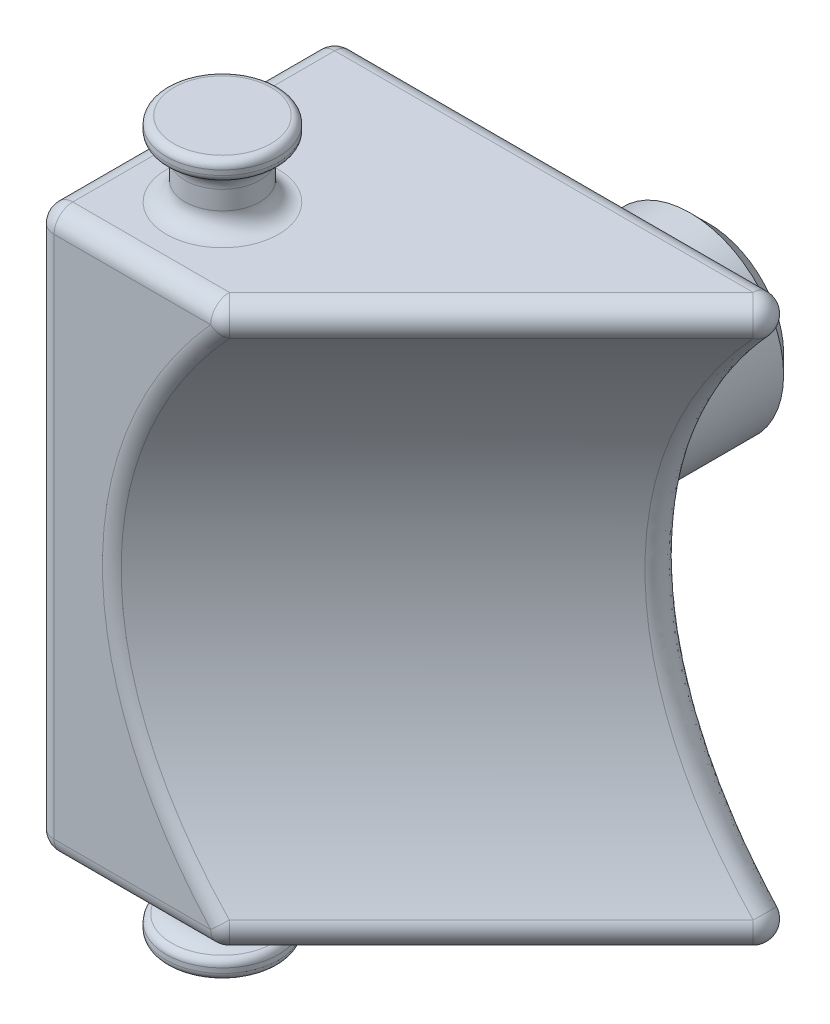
ISO-10303-21;
HEADER;
FILE_DESCRIPTION(('STEP AP214'),'2;1');
FILE_NAME('part.step','',(''),(''),'','','');
FILE_SCHEMA(('AUTOMOTIVE_DESIGN { 1 0 10303 214 1 1 1 1 }'));
ENDSEC;
DATA;
#1=APPLICATION_CONTEXT('core data for automotive mechanical design processes');
#2=APPLICATION_PROTOCOL_DEFINITION('international standard','automotive_design',2000,#1);
#3=PRODUCT_CONTEXT('',#1,'mechanical');
#4=PRODUCT('Part','Part','',(#3));
#5=PRODUCT_RELATED_PRODUCT_CATEGORY('part','',(#4));
#6=PRODUCT_DEFINITION_FORMATION('','',#4);
#7=PRODUCT_DEFINITION_CONTEXT('part definition',#1,'design');
#8=PRODUCT_DEFINITION('design','',#6,#7);
#9=PRODUCT_DEFINITION_SHAPE('','',#8);
#10=(LENGTH_UNIT() NAMED_UNIT(*) SI_UNIT(.MILLI.,.METRE.));
#11=(NAMED_UNIT(*) PLANE_ANGLE_UNIT() SI_UNIT($,.RADIAN.));
#12=(NAMED_UNIT(*) SI_UNIT($,.STERADIAN.) SOLID_ANGLE_UNIT());
#13=UNCERTAINTY_MEASURE_WITH_UNIT(LENGTH_MEASURE(1.E-05),#10,'distance_accuracy_value','');
#14=(GEOMETRIC_REPRESENTATION_CONTEXT(3) GLOBAL_UNCERTAINTY_ASSIGNED_CONTEXT((#13)) GLOBAL_UNIT_ASSIGNED_CONTEXT((#10,
#11,#12)) REPRESENTATION_CONTEXT('',''));
#15=CARTESIAN_POINT('',(0.,0.,0.));
#16=DIRECTION('',(0.,0.,1.));
#17=DIRECTION('',(1.,0.,0.));
#18=AXIS2_PLACEMENT_3D('',#15,#16,#17);
#19=CARTESIAN_POINT('',(-1.5,9.5,5.5));
#20=DIRECTION('',(0.,-1.,0.));
#21=DIRECTION('',(0.,0.,1.));
#22=AXIS2_PLACEMENT_3D('',#19,#20,#21);
#23=CYLINDRICAL_SURFACE('',#22,1.);
#24=CARTESIAN_POINT('',(-1.5,-8.5,5.5));
#25=DIRECTION('',(0.,-1.,0.));
#26=DIRECTION('',(0.,0.,1.));
#27=AXIS2_PLACEMENT_3D('',#24,#25,#26);
#28=CIRCLE('',#27,1.);
#29=CARTESIAN_POINT('',(-1.5,-8.5,6.5));
#30=VERTEX_POINT('',#29);
#31=EDGE_CURVE('E354',#30,#30,#28,.F.);
#32=ORIENTED_EDGE('',*,*,#31,.T.);
#33=EDGE_LOOP('',(#32));
#34=FACE_BOUND('',#33,.T.);
#35=CARTESIAN_POINT('',(-1.5,-8.,5.5));
#36=DIRECTION('',(0.,-1.,0.));
#37=DIRECTION('',(0.,0.,1.));
#38=AXIS2_PLACEMENT_3D('',#35,#36,#37);
#39=CIRCLE('',#38,1.);
#40=CARTESIAN_POINT('',(-1.5,-8.,6.5));
#41=VERTEX_POINT('',#40);
#42=EDGE_CURVE('E349',#41,#41,#39,.T.);
#43=ORIENTED_EDGE('',*,*,#42,.T.);
#44=EDGE_LOOP('',(#43));
#45=FACE_BOUND('',#44,.T.);
#46=ADVANCED_FACE('F14',(#34,#45),#23,.T.);
#47=CARTESIAN_POINT('',(-1.5,8.5,5.5));
#48=DIRECTION('',(0.,1.,0.));
#49=DIRECTION('',(0.,0.,-1.));
#50=AXIS2_PLACEMENT_3D('',#47,#48,#49);
#51=CIRCLE('',#50,1.);
#52=CARTESIAN_POINT('',(-1.5,8.5,4.5));
#53=VERTEX_POINT('',#52);
#54=EDGE_CURVE('E142',#53,#53,#51,.F.);
#55=ORIENTED_EDGE('',*,*,#54,.T.);
#56=EDGE_LOOP('',(#55));
#57=FACE_BOUND('',#56,.T.);
#58=CARTESIAN_POINT('',(-1.5,8.,5.5));
#59=DIRECTION('',(0.,-1.,0.));
#60=DIRECTION('',(0.,0.,1.));
#61=AXIS2_PLACEMENT_3D('',#58,#59,#60);
#62=CIRCLE('',#61,1.);
#63=CARTESIAN_POINT('',(-1.5,8.,6.5));
#64=VERTEX_POINT('',#63);
#65=EDGE_CURVE('E356',#64,#64,#62,.F.);
#66=ORIENTED_EDGE('',*,*,#65,.T.);
#67=EDGE_LOOP('',(#66));
#68=FACE_BOUND('',#67,.T.);
#69=ADVANCED_FACE('F321',(#57,#68),#23,.T.);
#70=CARTESIAN_POINT('',(-4.,-7.5,0.));
#71=DIRECTION('',(0.,-1.,0.));
#72=DIRECTION('',(0.,0.,1.));
#73=AXIS2_PLACEMENT_3D('',#70,#71,#72);
#74=PLANE('',#73);
#75=CARTESIAN_POINT('',(-1.5,-7.5,5.5));
#76=DIRECTION('',(0.,-1.,0.));
#77=DIRECTION('',(0.,0.,1.));
#78=AXIS2_PLACEMENT_3D('',#75,#76,#77);
#79=CIRCLE('',#78,1.5);
#80=CARTESIAN_POINT('',(-1.5,-7.5,7.));
#81=VERTEX_POINT('',#80);
#82=EDGE_CURVE('E170',#81,#81,#79,.F.);
#83=ORIENTED_EDGE('',*,*,#82,.T.);
#84=EDGE_LOOP('',(#83));
#85=FACE_BOUND('',#84,.T.);
#86=DIRECTION('',(0.,0.,-1.));
#87=VECTOR('',#86,1.);
#88=CARTESIAN_POINT('',(-3.5,-7.5,0.));
#89=LINE('',#88,#87);
#90=CARTESIAN_POINT('',(-3.5,-7.5,7.5));
#91=VERTEX_POINT('',#90);
#92=CARTESIAN_POINT('',(-3.5,-7.5,0.5));
#93=VERTEX_POINT('',#92);
#94=EDGE_CURVE('E163',#91,#93,#89,.T.);
#95=ORIENTED_EDGE('',*,*,#94,.T.);
#96=DIRECTION('',(1.,0.,0.));
#97=VECTOR('',#96,1.);
#98=CARTESIAN_POINT('',(9.53553390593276,-7.5,0.5));
#99=LINE('',#98,#97);
#100=CARTESIAN_POINT('',(7.68573614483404,-7.5,0.5));
#101=VERTEX_POINT('',#100);
#102=EDGE_CURVE('E121',#93,#101,#99,.T.);
#103=ORIENTED_EDGE('',*,*,#102,.T.);
#104=DIRECTION('',(0.707106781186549,0.,-0.707106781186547));
#105=VECTOR('',#104,1.);
#106=CARTESIAN_POINT('',(0.860635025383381,-7.5,7.32510111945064));
#107=LINE('',#106,#105);
#108=CARTESIAN_POINT('',(0.68573614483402,-7.5,7.5));
#109=VERTEX_POINT('',#108);
#110=EDGE_CURVE('E167',#101,#109,#107,.F.);
#111=ORIENTED_EDGE('',*,*,#110,.T.);
#112=DIRECTION('',(-1.,0.,0.));
#113=VECTOR('',#112,1.);
#114=CARTESIAN_POINT('',(-4.,-7.5,7.5));
#115=LINE('',#114,#113);
#116=EDGE_CURVE('E165',#109,#91,#115,.T.);
#117=ORIENTED_EDGE('',*,*,#116,.T.);
#118=EDGE_LOOP('',(#95,#103,#111,#117));
#119=FACE_BOUND('',#118,.T.);
#120=ADVANCED_FACE('F241',(#85,#119),#74,.T.);
#121=CARTESIAN_POINT('',(-4.,7.5,0.));
#122=DIRECTION('',(0.,-1.,0.));
#123=DIRECTION('',(0.,0.,1.));
#124=AXIS2_PLACEMENT_3D('',#121,#122,#123);
#125=PLANE('',#124);
#126=CARTESIAN_POINT('',(-1.5,7.5,5.5));
#127=DIRECTION('',(0.,-1.,0.));
#128=DIRECTION('',(0.,0.,1.));
#129=AXIS2_PLACEMENT_3D('',#126,#127,#128);
#130=CIRCLE('',#129,1.5);
#131=CARTESIAN_POINT('',(-1.5,7.5,7.));
#132=VERTEX_POINT('',#131);
#133=EDGE_CURVE('E160',#132,#132,#130,.T.);
#134=ORIENTED_EDGE('',*,*,#133,.T.);
#135=EDGE_LOOP('',(#134));
#136=FACE_BOUND('',#135,.T.);
#137=DIRECTION('',(-0.707106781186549,0.,0.707106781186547));
#138=VECTOR('',#137,1.);
#139=CARTESIAN_POINT('',(2.092868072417,7.5,6.09286807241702));
#140=LINE('',#139,#138);
#141=CARTESIAN_POINT('',(0.68573614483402,7.5,7.5));
#142=VERTEX_POINT('',#141);
#143=CARTESIAN_POINT('',(7.68573614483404,7.5,0.5));
#144=VERTEX_POINT('',#143);
#145=EDGE_CURVE('E155',#142,#144,#140,.F.);
#146=ORIENTED_EDGE('',*,*,#145,.T.);
#147=DIRECTION('',(1.,0.,0.));
#148=VECTOR('',#147,1.);
#149=CARTESIAN_POINT('',(-4.,7.5,0.5));
#150=LINE('',#149,#148);
#151=CARTESIAN_POINT('',(-3.5,7.5,0.5));
#152=VERTEX_POINT('',#151);
#153=EDGE_CURVE('E157',#144,#152,#150,.F.);
#154=ORIENTED_EDGE('',*,*,#153,.T.);
#155=DIRECTION('',(0.,0.,-1.));
#156=VECTOR('',#155,1.);
#157=CARTESIAN_POINT('',(-3.5,7.5,0.));
#158=LINE('',#157,#156);
#159=CARTESIAN_POINT('',(-3.5,7.5,7.5));
#160=VERTEX_POINT('',#159);
#161=EDGE_CURVE('E151',#152,#160,#158,.F.);
#162=ORIENTED_EDGE('',*,*,#161,.T.);
#163=DIRECTION('',(-1.,0.,0.));
#164=VECTOR('',#163,1.);
#165=CARTESIAN_POINT('',(-4.,7.5,7.5));
#166=LINE('',#165,#164);
#167=EDGE_CURVE('E153',#160,#142,#166,.F.);
#168=ORIENTED_EDGE('',*,*,#167,.T.);
#169=EDGE_LOOP('',(#146,#154,#162,#168));
#170=FACE_BOUND('',#169,.T.);
#171=ADVANCED_FACE('F462',(#136,#170),#125,.F.);
#172=CARTESIAN_POINT('',(-4.,-7.5,0.));
#173=DIRECTION('',(0.,0.,1.));
#174=DIRECTION('',(-1.,0.,0.));
#175=AXIS2_PLACEMENT_3D('',#172,#173,#174);
#176=PLANE('',#175);
#177=CARTESIAN_POINT('',(0.,0.,0.));
#178=DIRECTION('',(0.,0.,1.));
#179=DIRECTION('',(-1.,0.,0.));
#180=AXIS2_PLACEMENT_3D('',#177,#178,#179);
#181=CIRCLE('',#180,3.);
#182=CARTESIAN_POINT('',(-3.,0.,0.));
#183=VERTEX_POINT('',#182);
#184=EDGE_CURVE('E148',#183,#183,#181,.T.);
#185=ORIENTED_EDGE('',*,*,#184,.T.);
#186=EDGE_LOOP('',(#185));
#187=FACE_BOUND('',#186,.T.);
#188=DIRECTION('',(1.,0.,0.));
#189=VECTOR('',#188,1.);
#190=CARTESIAN_POINT('',(-4.,7.,0.));
#191=LINE('',#190,#189);
#192=CARTESIAN_POINT('',(-3.5,7.,0.));
#193=VERTEX_POINT('',#192);
#194=CARTESIAN_POINT('',(7.68573614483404,7.,0.));
#195=VERTEX_POINT('',#194);
#196=EDGE_CURVE('E113',#193,#195,#191,.T.);
#197=ORIENTED_EDGE('',*,*,#196,.T.);
#198=CARTESIAN_POINT('',(23.1776695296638,0.,0.));
#199=DIRECTION('',(0.,0.,1.));
#200=DIRECTION('',(-1.,0.,0.));
#201=AXIS2_PLACEMENT_3D('',#198,#199,#200);
#202=ELLIPSE('',#201,18.3847763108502,13.);
#203=CARTESIAN_POINT('',(7.68573614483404,-7.,0.));
#204=VERTEX_POINT('',#203);
#205=EDGE_CURVE('E109',#195,#204,#202,.T.);
#206=ORIENTED_EDGE('',*,*,#205,.T.);
#207=DIRECTION('',(1.,0.,0.));
#208=VECTOR('',#207,1.);
#209=CARTESIAN_POINT('',(-4.,-7.,0.));
#210=LINE('',#209,#208);
#211=CARTESIAN_POINT('',(-3.5,-7.,0.));
#212=VERTEX_POINT('',#211);
#213=EDGE_CURVE('E101',#204,#212,#210,.F.);
#214=ORIENTED_EDGE('',*,*,#213,.T.);
#215=DIRECTION('',(0.,1.,0.));
#216=VECTOR('',#215,1.);
#217=CARTESIAN_POINT('',(-3.5,-7.5,0.));
#218=LINE('',#217,#216);
#219=EDGE_CURVE('E106',#212,#193,#218,.T.);
#220=ORIENTED_EDGE('',*,*,#219,.T.);
#221=EDGE_LOOP('',(#197,#206,#214,#220));
#222=FACE_BOUND('',#221,.T.);
#223=ADVANCED_FACE('F104',(#187,#222),#176,.F.);
#224=CARTESIAN_POINT('',(-4.,-7.5,8.));
#225=DIRECTION('',(1.,0.,0.));
#226=DIRECTION('',(0.,0.,1.));
#227=AXIS2_PLACEMENT_3D('',#224,#225,#226);
#228=PLANE('',#227);
#229=DIRECTION('',(0.,0.,-1.));
#230=VECTOR('',#229,1.);
#231=CARTESIAN_POINT('',(-4.,-7.,8.));
#232=LINE('',#231,#230);
#233=CARTESIAN_POINT('',(-4.,-7.,0.5));
#234=VERTEX_POINT('',#233);
#235=CARTESIAN_POINT('',(-4.,-7.,7.5));
#236=VERTEX_POINT('',#235);
#237=EDGE_CURVE('E29',#234,#236,#232,.F.);
#238=ORIENTED_EDGE('',*,*,#237,.T.);
#239=DIRECTION('',(0.,1.,0.));
#240=VECTOR('',#239,1.);
#241=CARTESIAN_POINT('',(-4.,-7.5,7.5));
#242=LINE('',#241,#240);
#243=CARTESIAN_POINT('',(-4.,7.,7.5));
#244=VERTEX_POINT('',#243);
#245=EDGE_CURVE('E195',#236,#244,#242,.T.);
#246=ORIENTED_EDGE('',*,*,#245,.T.);
#247=DIRECTION('',(0.,0.,-1.));
#248=VECTOR('',#247,1.);
#249=CARTESIAN_POINT('',(-4.,7.,8.));
#250=LINE('',#249,#248);
#251=CARTESIAN_POINT('',(-4.,7.,0.5));
#252=VERTEX_POINT('',#251);
#253=EDGE_CURVE('E191',#244,#252,#250,.T.);
#254=ORIENTED_EDGE('',*,*,#253,.T.);
#255=DIRECTION('',(0.,1.,0.));
#256=VECTOR('',#255,1.);
#257=CARTESIAN_POINT('',(-4.,-7.5,0.5));
#258=LINE('',#257,#256);
#259=EDGE_CURVE('E34',#252,#234,#258,.F.);
#260=ORIENTED_EDGE('',*,*,#259,.T.);
#261=EDGE_LOOP('',(#238,#246,#254,#260));
#262=FACE_BOUND('',#261,.T.);
#263=ADVANCED_FACE('F454',(#262),#228,.F.);
#264=CARTESIAN_POINT('',(11.,-7.5,8.));
#265=DIRECTION('',(0.,0.,-1.));
#266=DIRECTION('',(1.,0.,0.));
#267=AXIS2_PLACEMENT_3D('',#264,#265,#266);
#268=PLANE('',#267);
#269=DIRECTION('',(-1.,0.,0.));
#270=VECTOR('',#269,1.);
#271=CARTESIAN_POINT('',(1.53553390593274,-7.,8.));
#272=LINE('',#271,#270);
#273=CARTESIAN_POINT('',(-3.5,-7.,8.));
#274=VERTEX_POINT('',#273);
#275=CARTESIAN_POINT('',(0.68573614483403,-7.,8.));
#276=VERTEX_POINT('',#275);
#277=EDGE_CURVE('E186',#274,#276,#272,.F.);
#278=ORIENTED_EDGE('',*,*,#277,.T.);
#279=CARTESIAN_POINT('',(16.1776695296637,0.,8.));
#280=DIRECTION('',(0.,0.,-1.));
#281=DIRECTION('',(-1.,0.,0.));
#282=AXIS2_PLACEMENT_3D('',#279,#280,#281);
#283=ELLIPSE('',#282,18.3847763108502,13.);
#284=CARTESIAN_POINT('',(0.68573614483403,7.,8.));
#285=VERTEX_POINT('',#284);
#286=EDGE_CURVE('E189',#276,#285,#283,.T.);
#287=ORIENTED_EDGE('',*,*,#286,.T.);
#288=DIRECTION('',(-1.,0.,0.));
#289=VECTOR('',#288,1.);
#290=CARTESIAN_POINT('',(11.,7.,8.));
#291=LINE('',#290,#289);
#292=CARTESIAN_POINT('',(-3.5,7.,8.));
#293=VERTEX_POINT('',#292);
#294=EDGE_CURVE('E184',#285,#293,#291,.T.);
#295=ORIENTED_EDGE('',*,*,#294,.T.);
#296=DIRECTION('',(0.,1.,0.));
#297=VECTOR('',#296,1.);
#298=CARTESIAN_POINT('',(-3.5,-7.5,8.));
#299=LINE('',#298,#297);
#300=EDGE_CURVE('E182',#293,#274,#299,.F.);
#301=ORIENTED_EDGE('',*,*,#300,.T.);
#302=EDGE_LOOP('',(#278,#287,#295,#301));
#303=FACE_BOUND('',#302,.T.);
#304=ADVANCED_FACE('F238',(#303),#268,.F.);
#305=CARTESIAN_POINT('',(17.3388347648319,0.,6.33883476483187));
#306=DIRECTION('',(-0.707106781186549,0.,0.707106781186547));
#307=DIRECTION('',(-0.707106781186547,0.,-0.707106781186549));
#308=AXIS2_PLACEMENT_3D('',#305,#306,#307);
#309=CYLINDRICAL_SURFACE('',#308,12.5);
#310=CARTESIAN_POINT('',(23.1776695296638,0.,0.5));
#311=DIRECTION('',(-0.0196040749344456,0.,-0.999807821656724));
#312=DIRECTION('',(-0.999807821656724,0.,0.0196040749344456));
#313=AXIS2_PLACEMENT_3D('',#310,#311,#312);
#314=ELLIPSE('',#313,18.0346887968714,12.5);
#315=CARTESIAN_POINT('',(7.98365794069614,-6.73076923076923,0.79792179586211));
#316=VERTEX_POINT('',#315);
#317=CARTESIAN_POINT('',(7.98365794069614,6.73076923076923,0.79792179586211));
#318=VERTEX_POINT('',#317);
#319=EDGE_CURVE('E177',#316,#318,#314,.T.);
#320=ORIENTED_EDGE('',*,*,#319,.T.);
#321=DIRECTION('',(-0.707106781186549,0.,0.707106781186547));
#322=VECTOR('',#321,1.);
#323=CARTESIAN_POINT('',(9.89078986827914,6.73076923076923,-1.10921013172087));
#324=LINE('',#323,#322);
#325=CARTESIAN_POINT('',(0.98365794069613,6.73076923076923,7.79792179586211));
#326=VERTEX_POINT('',#325);
#327=EDGE_CURVE('E179',#318,#326,#324,.T.);
#328=ORIENTED_EDGE('',*,*,#327,.T.);
#329=CARTESIAN_POINT('',(16.1776695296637,0.,7.5));
#330=DIRECTION('',(0.0196040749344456,0.,0.999807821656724));
#331=DIRECTION('',(-0.999807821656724,0.,0.0196040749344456));
#332=AXIS2_PLACEMENT_3D('',#329,#330,#331);
#333=ELLIPSE('',#332,18.0346887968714,12.5);
#334=CARTESIAN_POINT('',(0.98365794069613,-6.73076923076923,7.79792179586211));
#335=VERTEX_POINT('',#334);
#336=EDGE_CURVE('E173',#326,#335,#333,.T.);
#337=ORIENTED_EDGE('',*,*,#336,.T.);
#338=DIRECTION('',(-0.707106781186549,0.,0.707106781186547));
#339=VECTOR('',#338,1.);
#340=CARTESIAN_POINT('',(9.89078986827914,-6.73076923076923,-1.10921013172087));
#341=LINE('',#340,#339);
#342=EDGE_CURVE('E175',#335,#316,#341,.F.);
#343=ORIENTED_EDGE('',*,*,#342,.T.);
#344=EDGE_LOOP('',(#320,#328,#337,#343));
#345=FACE_BOUND('',#344,.T.);
#346=ADVANCED_FACE('F232',(#345),#309,.F.);
#347=CARTESIAN_POINT('',(0.,0.,-6.));
#348=DIRECTION('',(0.,0.,1.));
#349=DIRECTION('',(-1.,0.,0.));
#350=AXIS2_PLACEMENT_3D('',#347,#348,#349);
#351=CYLINDRICAL_SURFACE('',#350,2.5);
#352=CARTESIAN_POINT('',(0.,0.,-0.5));
#353=DIRECTION('',(0.,0.,1.));
#354=DIRECTION('',(-1.,0.,0.));
#355=AXIS2_PLACEMENT_3D('',#352,#353,#354);
#356=CIRCLE('',#355,2.5);
#357=CARTESIAN_POINT('',(-2.5,0.,-0.5));
#358=VERTEX_POINT('',#357);
#359=EDGE_CURVE('E139',#358,#358,#356,.F.);
#360=ORIENTED_EDGE('',*,*,#359,.T.);
#361=EDGE_LOOP('',(#360));
#362=FACE_BOUND('',#361,.T.);
#363=CARTESIAN_POINT('',(0.,0.,-5.5));
#364=DIRECTION('',(0.,0.,-1.));
#365=DIRECTION('',(1.,0.,0.));
#366=AXIS2_PLACEMENT_3D('',#363,#364,#365);
#367=CIRCLE('',#366,2.5);
#368=CARTESIAN_POINT('',(2.5,0.,-5.5));
#369=VERTEX_POINT('',#368);
#370=EDGE_CURVE('E346',#369,#369,#367,.F.);
#371=ORIENTED_EDGE('',*,*,#370,.T.);
#372=EDGE_LOOP('',(#371));
#373=FACE_BOUND('',#372,.T.);
#374=ADVANCED_FACE('F237',(#362,#373),#351,.T.);
#375=CARTESIAN_POINT('',(0.,0.,-6.));
#376=DIRECTION('',(0.,0.,-1.));
#377=DIRECTION('',(1.,0.,0.));
#378=AXIS2_PLACEMENT_3D('',#375,#376,#377);
#379=PLANE('',#378);
#380=CARTESIAN_POINT('',(0.,0.,-6.));
#381=DIRECTION('',(0.,0.,-1.));
#382=DIRECTION('',(1.,0.,0.));
#383=AXIS2_PLACEMENT_3D('',#380,#381,#382);
#384=CIRCLE('',#383,2.);
#385=CARTESIAN_POINT('',(2.,0.,-6.));
#386=VERTEX_POINT('',#385);
#387=EDGE_CURVE('E275',#386,#386,#384,.T.);
#388=ORIENTED_EDGE('',*,*,#387,.T.);
#389=EDGE_LOOP('',(#388));
#390=FACE_BOUND('',#389,.T.);
#391=ADVANCED_FACE('F331',(#390),#379,.T.);
#392=CARTESIAN_POINT('',(0.,0.,-6.));
#393=DIRECTION('',(0.,0.,1.));
#394=DIRECTION('',(-1.,0.,0.));
#395=AXIS2_PLACEMENT_3D('',#392,#393,#394);
#396=CONICAL_SURFACE('',#395,2.,0.78539816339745);
#397=ORIENTED_EDGE('',*,*,#370,.F.);
#398=EDGE_LOOP('',(#397));
#399=FACE_BOUND('',#398,.T.);
#400=ORIENTED_EDGE('',*,*,#387,.F.);
#401=EDGE_LOOP('',(#400));
#402=FACE_BOUND('',#401,.T.);
#403=ADVANCED_FACE('F333',(#399,#402),#396,.T.);
#404=CARTESIAN_POINT('',(-1.5,9.,5.5));
#405=DIRECTION('',(0.,1.,0.));
#406=DIRECTION('',(0.,0.,-1.));
#407=AXIS2_PLACEMENT_3D('',#404,#405,#406);
#408=CYLINDRICAL_SURFACE('',#407,1.5);
#409=CARTESIAN_POINT('',(-1.5,9.17082039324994,5.5));
#410=DIRECTION('',(0.,-1.,0.));
#411=DIRECTION('',(0.,0.,1.));
#412=AXIS2_PLACEMENT_3D('',#409,#410,#411);
#413=CIRCLE('',#412,1.5);
#414=CARTESIAN_POINT('',(-1.5,9.17082039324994,7.));
#415=VERTEX_POINT('',#414);
#416=EDGE_CURVE('E278',#415,#415,#413,.F.);
#417=ORIENTED_EDGE('',*,*,#416,.T.);
#418=EDGE_LOOP('',(#417));
#419=FACE_BOUND('',#418,.T.);
#420=CARTESIAN_POINT('',(-1.5,9.3,5.5));
#421=DIRECTION('',(0.,1.,0.));
#422=DIRECTION('',(0.,0.,-1.));
#423=AXIS2_PLACEMENT_3D('',#420,#421,#422);
#424=CIRCLE('',#423,1.5);
#425=CARTESIAN_POINT('',(-1.5,9.3,4.));
#426=VERTEX_POINT('',#425);
#427=EDGE_CURVE('E197',#426,#426,#424,.F.);
#428=ORIENTED_EDGE('',*,*,#427,.T.);
#429=EDGE_LOOP('',(#428));
#430=FACE_BOUND('',#429,.T.);
#431=ADVANCED_FACE('F316',(#419,#430),#408,.T.);
#432=CARTESIAN_POINT('',(-1.5,9.5,5.5));
#433=DIRECTION('',(0.,1.,0.));
#434=DIRECTION('',(0.,0.,-1.));
#435=AXIS2_PLACEMENT_3D('',#432,#433,#434);
#436=PLANE('',#435);
#437=CARTESIAN_POINT('',(-1.5,9.5,5.5));
#438=DIRECTION('',(0.,1.,0.));
#439=DIRECTION('',(0.,0.,-1.));
#440=AXIS2_PLACEMENT_3D('',#437,#438,#439);
#441=CIRCLE('',#440,1.3);
#442=CARTESIAN_POINT('',(-1.5,9.5,4.2));
#443=VERTEX_POINT('',#442);
#444=EDGE_CURVE('E9',#443,#443,#441,.T.);
#445=ORIENTED_EDGE('',*,*,#444,.T.);
#446=EDGE_LOOP('',(#445));
#447=FACE_BOUND('',#446,.T.);
#448=ADVANCED_FACE('F305',(#447),#436,.T.);
#449=CARTESIAN_POINT('',(-1.5,-9.,5.5));
#450=DIRECTION('',(0.,-1.,0.));
#451=DIRECTION('',(0.,0.,1.));
#452=AXIS2_PLACEMENT_3D('',#449,#450,#451);
#453=CYLINDRICAL_SURFACE('',#452,1.5);
#454=CARTESIAN_POINT('',(-1.5,-9.17082039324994,5.5));
#455=DIRECTION('',(0.,-1.,0.));
#456=DIRECTION('',(0.,0.,1.));
#457=AXIS2_PLACEMENT_3D('',#454,#455,#456);
#458=CIRCLE('',#457,1.5);
#459=CARTESIAN_POINT('',(-1.5,-9.17082039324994,7.));
#460=VERTEX_POINT('',#459);
#461=EDGE_CURVE('E290',#460,#460,#458,.T.);
#462=ORIENTED_EDGE('',*,*,#461,.T.);
#463=EDGE_LOOP('',(#462));
#464=FACE_BOUND('',#463,.T.);
#465=CARTESIAN_POINT('',(-1.5,-9.3,5.5));
#466=DIRECTION('',(0.,1.,0.));
#467=DIRECTION('',(0.,0.,-1.));
#468=AXIS2_PLACEMENT_3D('',#465,#466,#467);
#469=CIRCLE('',#468,1.5);
#470=CARTESIAN_POINT('',(-1.5,-9.3,4.));
#471=VERTEX_POINT('',#470);
#472=EDGE_CURVE('E287',#471,#471,#469,.T.);
#473=ORIENTED_EDGE('',*,*,#472,.T.);
#474=EDGE_LOOP('',(#473));
#475=FACE_BOUND('',#474,.T.);
#476=ADVANCED_FACE('F303',(#464,#475),#453,.T.);
#477=CARTESIAN_POINT('',(-1.5,-9.5,5.5));
#478=DIRECTION('',(0.,1.,0.));
#479=DIRECTION('',(0.,0.,-1.));
#480=AXIS2_PLACEMENT_3D('',#477,#478,#479);
#481=PLANE('',#480);
#482=CARTESIAN_POINT('',(-1.5,-9.5,5.5));
#483=DIRECTION('',(0.,1.,0.));
#484=DIRECTION('',(0.,0.,-1.));
#485=AXIS2_PLACEMENT_3D('',#482,#483,#484);
#486=CIRCLE('',#485,1.3);
#487=CARTESIAN_POINT('',(-1.5,-9.5,4.2));
#488=VERTEX_POINT('',#487);
#489=EDGE_CURVE('E22',#488,#488,#486,.F.);
#490=ORIENTED_EDGE('',*,*,#489,.T.);
#491=EDGE_LOOP('',(#490));
#492=FACE_BOUND('',#491,.T.);
#493=ADVANCED_FACE('F295',(#492),#481,.F.);
#494=CARTESIAN_POINT('',(-1.5,-8.5,5.5));
#495=DIRECTION('',(0.,-1.,0.));
#496=DIRECTION('',(0.,0.,1.));
#497=AXIS2_PLACEMENT_3D('',#494,#495,#496);
#498=TOROIDAL_SURFACE('',#497,1.5,0.5);
#499=CARTESIAN_POINT('',(-1.5,-8.97915742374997,5.5));
#500=DIRECTION('',(0.,1.,0.));
#501=DIRECTION('',(0.,0.,-1.));
#502=AXIS2_PLACEMENT_3D('',#499,#500,#501);
#503=CIRCLE('',#502,1.35714285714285);
#504=CARTESIAN_POINT('',(-1.5,-8.97915742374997,4.14285714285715));
#505=VERTEX_POINT('',#504);
#506=EDGE_CURVE('E284',#505,#505,#503,.T.);
#507=ORIENTED_EDGE('',*,*,#506,.T.);
#508=EDGE_LOOP('',(#507));
#509=FACE_BOUND('',#508,.T.);
#510=ORIENTED_EDGE('',*,*,#31,.F.);
#511=EDGE_LOOP('',(#510));
#512=FACE_BOUND('',#511,.T.);
#513=ADVANCED_FACE('F314',(#509,#512),#498,.F.);
#514=CARTESIAN_POINT('',(-1.5,8.5,5.5));
#515=DIRECTION('',(0.,1.,0.));
#516=DIRECTION('',(0.,0.,-1.));
#517=AXIS2_PLACEMENT_3D('',#514,#515,#516);
#518=TOROIDAL_SURFACE('',#517,1.5,0.5);
#519=CARTESIAN_POINT('',(-1.5,8.97915742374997,5.5));
#520=DIRECTION('',(0.,-1.,0.));
#521=DIRECTION('',(0.,0.,1.));
#522=AXIS2_PLACEMENT_3D('',#519,#520,#521);
#523=CIRCLE('',#522,1.35714285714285);
#524=CARTESIAN_POINT('',(-1.5,8.97915742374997,6.85714285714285));
#525=VERTEX_POINT('',#524);
#526=EDGE_CURVE('E281',#525,#525,#523,.T.);
#527=ORIENTED_EDGE('',*,*,#526,.T.);
#528=EDGE_LOOP('',(#527));
#529=FACE_BOUND('',#528,.T.);
#530=ORIENTED_EDGE('',*,*,#54,.F.);
#531=EDGE_LOOP('',(#530));
#532=FACE_BOUND('',#531,.T.);
#533=ADVANCED_FACE('F362',(#529,#532),#518,.F.);
#534=CARTESIAN_POINT('',(0.,0.,-0.5));
#535=DIRECTION('',(0.,0.,1.));
#536=DIRECTION('',(-1.,0.,0.));
#537=AXIS2_PLACEMENT_3D('',#534,#535,#536);
#538=TOROIDAL_SURFACE('',#537,3.,0.5);
#539=ORIENTED_EDGE('',*,*,#184,.F.);
#540=EDGE_LOOP('',(#539));
#541=FACE_BOUND('',#540,.T.);
#542=ORIENTED_EDGE('',*,*,#359,.F.);
#543=EDGE_LOOP('',(#542));
#544=FACE_BOUND('',#543,.T.);
#545=ADVANCED_FACE('F364',(#541,#544),#538,.F.);
#546=CARTESIAN_POINT('',(-1.5,8.,5.5));
#547=DIRECTION('',(0.,-1.,0.));
#548=DIRECTION('',(0.,0.,1.));
#549=AXIS2_PLACEMENT_3D('',#546,#547,#548);
#550=TOROIDAL_SURFACE('',#549,1.5,0.5);
#551=ORIENTED_EDGE('',*,*,#133,.F.);
#552=EDGE_LOOP('',(#551));
#553=FACE_BOUND('',#552,.T.);
#554=ORIENTED_EDGE('',*,*,#65,.F.);
#555=EDGE_LOOP('',(#554));
#556=FACE_BOUND('',#555,.T.);
#557=ADVANCED_FACE('F372',(#553,#556),#550,.F.);
#558=CARTESIAN_POINT('',(-4.,-7.,7.5));
#559=DIRECTION('',(1.,0.,0.));
#560=DIRECTION('',(0.,0.,1.));
#561=AXIS2_PLACEMENT_3D('',#558,#559,#560);
#562=CYLINDRICAL_SURFACE('',#561,0.5);
#563=CARTESIAN_POINT('',(-3.5,-7.,7.5));
#564=DIRECTION('',(-1.,0.,0.));
#565=DIRECTION('',(0.,0.,-1.));
#566=AXIS2_PLACEMENT_3D('',#563,#564,#565);
#567=CIRCLE('',#566,0.5);
#568=EDGE_CURVE('E272',#91,#274,#567,.T.);
#569=ORIENTED_EDGE('',*,*,#568,.F.);
#570=ORIENTED_EDGE('',*,*,#116,.F.);
#571=CARTESIAN_POINT('',(0.68573614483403,-7.,7.5));
#572=DIRECTION('',(1.,0.,0.));
#573=DIRECTION('',(0.,1.,0.));
#574=AXIS2_PLACEMENT_3D('',#571,#572,#573);
#575=CIRCLE('',#574,0.5);
#576=EDGE_CURVE('E269',#276,#109,#575,.T.);
#577=ORIENTED_EDGE('',*,*,#576,.F.);
#578=ORIENTED_EDGE('',*,*,#277,.F.);
#579=EDGE_LOOP('',(#569,#570,#577,#578));
#580=FACE_BOUND('',#579,.T.);
#581=ADVANCED_FACE('F380',(#580),#562,.T.);
#582=CARTESIAN_POINT('',(-3.5,-7.,7.5));
#583=DIRECTION('',(0.,0.,1.));
#584=DIRECTION('',(-1.,0.,0.));
#585=AXIS2_PLACEMENT_3D('',#582,#583,#584);
#586=SPHERICAL_SURFACE('',#585,0.5);
#587=CARTESIAN_POINT('',(-3.5,-7.,7.5));
#588=DIRECTION('',(0.,0.,1.));
#589=DIRECTION('',(-1.,0.,0.));
#590=AXIS2_PLACEMENT_3D('',#587,#588,#589);
#591=CIRCLE('',#590,0.5);
#592=EDGE_CURVE('E264',#91,#236,#591,.F.);
#593=ORIENTED_EDGE('',*,*,#592,.F.);
#594=ORIENTED_EDGE('',*,*,#568,.T.);
#595=CARTESIAN_POINT('',(-3.5,-7.,7.5));
#596=DIRECTION('',(0.,-1.,0.));
#597=DIRECTION('',(0.,0.,1.));
#598=AXIS2_PLACEMENT_3D('',#595,#596,#597);
#599=CIRCLE('',#598,0.5);
#600=EDGE_CURVE('E266',#236,#274,#599,.F.);
#601=ORIENTED_EDGE('',*,*,#600,.F.);
#602=EDGE_LOOP('',(#593,#594,#601));
#603=FACE_BOUND('',#602,.T.);
#604=ADVANCED_FACE('F491',(#603),#586,.T.);
#605=CARTESIAN_POINT('',(0.68573614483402,-7.,7.5));
#606=DIRECTION('',(0.,0.,1.));
#607=DIRECTION('',(-1.,0.,0.));
#608=AXIS2_PLACEMENT_3D('',#605,#606,#607);
#609=SPHERICAL_SURFACE('',#608,0.5);
#610=CARTESIAN_POINT('',(0.68573614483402,-7.,7.5));
#611=DIRECTION('',(0.670478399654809,-0.741929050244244,0.));
#612=DIRECTION('',(0.741929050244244,0.670478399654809,0.));
#613=AXIS2_PLACEMENT_3D('',#610,#611,#612);
#614=CIRCLE('',#613,0.5);
#615=EDGE_CURVE('E259',#276,#335,#614,.F.);
#616=ORIENTED_EDGE('',*,*,#615,.F.);
#617=ORIENTED_EDGE('',*,*,#576,.T.);
#618=CARTESIAN_POINT('',(0.68573614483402,-7.,7.5));
#619=DIRECTION('',(-0.707106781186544,0.,0.707106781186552));
#620=DIRECTION('',(-0.707106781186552,0.,-0.707106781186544));
#621=AXIS2_PLACEMENT_3D('',#618,#619,#620);
#622=CIRCLE('',#621,0.5);
#623=EDGE_CURVE('E261',#335,#109,#622,.F.);
#624=ORIENTED_EDGE('',*,*,#623,.F.);
#625=EDGE_LOOP('',(#616,#617,#624));
#626=FACE_BOUND('',#625,.T.);
#627=ADVANCED_FACE('F434',(#626),#609,.T.);
#628=CARTESIAN_POINT('',(-3.5,-7.5,7.5));
#629=DIRECTION('',(0.,1.,0.));
#630=DIRECTION('',(0.,0.,-1.));
#631=AXIS2_PLACEMENT_3D('',#628,#629,#630);
#632=CYLINDRICAL_SURFACE('',#631,0.5);
#633=ORIENTED_EDGE('',*,*,#600,.T.);
#634=ORIENTED_EDGE('',*,*,#300,.F.);
#635=CARTESIAN_POINT('',(-3.5,7.,7.5));
#636=DIRECTION('',(0.,1.,0.));
#637=DIRECTION('',(0.,0.,-1.));
#638=AXIS2_PLACEMENT_3D('',#635,#636,#637);
#639=CIRCLE('',#638,0.5);
#640=EDGE_CURVE('E418',#244,#293,#639,.T.);
#641=ORIENTED_EDGE('',*,*,#640,.F.);
#642=ORIENTED_EDGE('',*,*,#245,.F.);
#643=EDGE_LOOP('',(#633,#634,#641,#642));
#644=FACE_BOUND('',#643,.T.);
#645=ADVANCED_FACE('F453',(#644),#632,.T.);
#646=CARTESIAN_POINT('',(-3.5,-7.,0.));
#647=DIRECTION('',(0.,0.,1.));
#648=DIRECTION('',(-1.,0.,0.));
#649=AXIS2_PLACEMENT_3D('',#646,#647,#648);
#650=CYLINDRICAL_SURFACE('',#649,0.5);
#651=ORIENTED_EDGE('',*,*,#592,.T.);
#652=ORIENTED_EDGE('',*,*,#237,.F.);
#653=CARTESIAN_POINT('',(-3.5,-7.,0.5));
#654=DIRECTION('',(0.,0.,-1.));
#655=DIRECTION('',(1.,0.,0.));
#656=AXIS2_PLACEMENT_3D('',#653,#654,#655);
#657=CIRCLE('',#656,0.5);
#658=EDGE_CURVE('E125',#93,#234,#657,.T.);
#659=ORIENTED_EDGE('',*,*,#658,.F.);
#660=ORIENTED_EDGE('',*,*,#94,.F.);
#661=EDGE_LOOP('',(#651,#652,#659,#660));
#662=FACE_BOUND('',#661,.T.);
#663=ADVANCED_FACE('F494',(#662),#650,.T.);
#664=CARTESIAN_POINT('',(-4.,-7.,0.5));
#665=DIRECTION('',(-1.,0.,0.));
#666=DIRECTION('',(0.,0.,-1.));
#667=AXIS2_PLACEMENT_3D('',#664,#665,#666);
#668=CYLINDRICAL_SURFACE('',#667,0.5);
#669=CARTESIAN_POINT('',(7.68573614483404,-7.,0.5));
#670=DIRECTION('',(1.,0.,0.));
#671=DIRECTION('',(0.,0.,1.));
#672=AXIS2_PLACEMENT_3D('',#669,#670,#671);
#673=CIRCLE('',#672,0.5);
#674=EDGE_CURVE('E126',#101,#204,#673,.T.);
#675=ORIENTED_EDGE('',*,*,#674,.F.);
#676=ORIENTED_EDGE('',*,*,#102,.F.);
#677=CARTESIAN_POINT('',(-3.5,-7.,0.5));
#678=DIRECTION('',(-1.,0.,0.));
#679=DIRECTION('',(0.,0.,-1.));
#680=AXIS2_PLACEMENT_3D('',#677,#678,#679);
#681=CIRCLE('',#680,0.5);
#682=EDGE_CURVE('E117',#212,#93,#681,.T.);
#683=ORIENTED_EDGE('',*,*,#682,.F.);
#684=ORIENTED_EDGE('',*,*,#213,.F.);
#685=EDGE_LOOP('',(#675,#676,#683,#684));
#686=FACE_BOUND('',#685,.T.);
#687=ADVANCED_FACE('F119',(#686),#668,.T.);
#688=CARTESIAN_POINT('',(9.59286807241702,-7.,-1.40713192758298));
#689=DIRECTION('',(-0.707106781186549,0.,0.707106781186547));
#690=DIRECTION('',(-0.707106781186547,0.,-0.707106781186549));
#691=AXIS2_PLACEMENT_3D('',#688,#689,#690);
#692=CYLINDRICAL_SURFACE('',#691,0.5);
#693=ORIENTED_EDGE('',*,*,#623,.T.);
#694=ORIENTED_EDGE('',*,*,#110,.F.);
#695=CARTESIAN_POINT('',(7.68573614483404,-7.,0.5));
#696=DIRECTION('',(0.707106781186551,0.,-0.707106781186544));
#697=DIRECTION('',(0.707106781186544,0.,0.707106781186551));
#698=AXIS2_PLACEMENT_3D('',#695,#696,#697);
#699=CIRCLE('',#698,0.5);
#700=EDGE_CURVE('E410',#316,#101,#699,.T.);
#701=ORIENTED_EDGE('',*,*,#700,.F.);
#702=ORIENTED_EDGE('',*,*,#342,.F.);
#703=EDGE_LOOP('',(#693,#694,#701,#702));
#704=FACE_BOUND('',#703,.T.);
#705=ADVANCED_FACE('F251',(#704),#692,.T.);
#706=CARTESIAN_POINT('',(-1.85355339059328,0.,7.85355339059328));
#707=CARTESIAN_POINT('',(-1.92387953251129,0.,7.92387953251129));
#708=CARTESIAN_POINT('',(-2.01576506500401,0.,7.96193976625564));
#709=CARTESIAN_POINT('',(-2.10765059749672,0.,8.));
#710=CARTESIAN_POINT('',(-2.20710678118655,0.,8.));
#711=CARTESIAN_POINT('',(-1.85355339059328,0.273480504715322,7.85355339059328));
#712=CARTESIAN_POINT('',(-1.92387953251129,0.275656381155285,7.92387953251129));
#713=CARTESIAN_POINT('',(-2.01576506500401,0.278499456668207,7.96193976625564));
#714=CARTESIAN_POINT('',(-2.10765059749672,0.281342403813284,8.));
#715=CARTESIAN_POINT('',(-2.20710678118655,0.284419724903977,8.));
#716=CARTESIAN_POINT('',(-1.84058336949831,0.546961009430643,7.85329907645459));
#717=CARTESIAN_POINT('',(-1.91082192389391,0.551332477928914,7.92374190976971));
#718=CARTESIAN_POINT('',(-2.00264981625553,0.556998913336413,7.96187096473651));
#719=CARTESIAN_POINT('',(-2.09447395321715,0.562704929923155,8.));
#720=CARTESIAN_POINT('',(-2.1938824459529,0.568839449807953,8.));
#721=CARTESIAN_POINT('',(-1.78898334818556,1.09157849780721,7.8522873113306));
#722=CARTESIAN_POINT('',(-1.85888156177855,1.10026369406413,7.92319410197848));
#723=CARTESIAN_POINT('',(-1.95047252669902,1.11159552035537,7.96159706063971));
#724=CARTESIAN_POINT('',(-2.04205981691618,1.12296674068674,8.));
#725=CARTESIAN_POINT('',(-2.14127065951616,1.13524163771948,8.));
#726=CARTESIAN_POINT('',(-1.75035289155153,1.36271543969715,7.85152985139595));
#727=CARTESIAN_POINT('',(-1.81999098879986,1.37355733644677,7.92278383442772));
#728=CARTESIAN_POINT('',(-1.91141002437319,1.38769262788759,7.96139195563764));
#729=CARTESIAN_POINT('',(-2.00281443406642,1.40190534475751,8.));
#730=CARTESIAN_POINT('',(-2.10188274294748,1.41722405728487,8.));
#731=CARTESIAN_POINT('',(-1.64738813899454,1.90489692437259,7.84951093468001));
#732=CARTESIAN_POINT('',(-1.71634937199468,1.91997651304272,7.92168926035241));
#733=CARTESIAN_POINT('',(-1.80729537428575,1.93976145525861,7.96084466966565));
#734=CARTESIAN_POINT('',(-1.89822635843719,1.9596261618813,8.));
#735=CARTESIAN_POINT('',(-1.99689907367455,1.98109280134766,8.));
#736=CARTESIAN_POINT('',(-1.58263830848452,2.1758654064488,7.84824133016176));
#737=CARTESIAN_POINT('',(-1.65116574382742,2.1930604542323,7.92100036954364));
#738=CARTESIAN_POINT('',(-1.74182307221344,2.21565520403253,7.96050027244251));
#739=CARTESIAN_POINT('',(-1.83244711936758,2.23836618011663,8.));
#740=CARTESIAN_POINT('',(-1.93087963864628,2.26290002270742,8.));
#741=CARTESIAN_POINT('',(-1.428766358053,2.71104473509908,7.84522423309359));
#742=CARTESIAN_POINT('',(-1.49628905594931,2.73232437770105,7.91936096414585));
#743=CARTESIAN_POINT('',(-1.58623776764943,2.76051504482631,7.95968056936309));
#744=CARTESIAN_POINT('',(-1.67615334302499,2.78882208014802,8.));
#745=CARTESIAN_POINT('',(-1.77399059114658,2.81948652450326,8.));
#746=CARTESIAN_POINT('',(-1.3396431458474,2.97525527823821,7.84347671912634));
#747=CARTESIAN_POINT('',(-1.40657384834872,2.99853794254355,7.91841021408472));
#748=CARTESIAN_POINT('',(-1.49612366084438,3.02948082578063,7.95920525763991));
#749=CARTESIAN_POINT('',(-1.58561645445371,3.0605722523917,8.));
#750=CARTESIAN_POINT('',(-1.68311986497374,3.09426548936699,8.));
#751=CARTESIAN_POINT('',(-1.13559411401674,3.50316732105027,7.83947575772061));
#752=CARTESIAN_POINT('',(-1.20120252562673,3.53034821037,7.91622944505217));
#753=CARTESIAN_POINT('',(-1.28981191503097,3.56683196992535,7.9581148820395));
#754=CARTESIAN_POINT('',(-1.37836097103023,3.60347283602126,8.));
#755=CARTESIAN_POINT('',(-1.47506987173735,3.64329401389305,8.));
#756=CARTESIAN_POINT('',(-1.01996289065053,3.76660642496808,7.83720847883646));
#757=CARTESIAN_POINT('',(-1.08481122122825,3.79570392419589,7.91499149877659));
#758=CARTESIAN_POINT('',(-1.17290121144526,3.8349483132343,7.95749599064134));
#759=CARTESIAN_POINT('',(-1.26090035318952,3.87437818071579,8.));
#760=CARTESIAN_POINT('',(-1.35717136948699,3.91727068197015,8.));
#761=CARTESIAN_POINT('',(-0.76658515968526,4.28311007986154,7.83224028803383));
#762=CARTESIAN_POINT('',(-0.829812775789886,4.31584233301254,7.91227257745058));
#763=CARTESIAN_POINT('',(-0.9167290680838,4.3605434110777,7.95613653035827));
#764=CARTESIAN_POINT('',(-1.00355422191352,4.40543239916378,8.));
#765=CARTESIAN_POINT('',(-1.09882544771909,4.45443448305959,8.));
#766=CARTESIAN_POINT('',(-0.628827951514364,4.53616953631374,7.82953916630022));
#767=CARTESIAN_POINT('',(-0.691162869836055,4.57064536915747,7.91079113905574));
#768=CARTESIAN_POINT('',(-0.777456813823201,4.61801694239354,7.95539590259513));
#769=CARTESIAN_POINT('',(-0.863625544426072,4.66560208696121,8.));
#770=CARTESIAN_POINT('',(-0.958367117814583,4.71761631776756,8.));
#771=CARTESIAN_POINT('',(-0.173596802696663,5.29799004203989,7.82061306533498));
#772=CARTESIAN_POINT('',(-0.232856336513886,5.33784318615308,7.90588013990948));
#773=CARTESIAN_POINT('',(-0.31723850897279,5.39298363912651,7.95294150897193));
#774=CARTESIAN_POINT('',(-0.401081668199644,5.44902607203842,8.));
#775=CARTESIAN_POINT('',(-0.494209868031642,5.50990964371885,8.));
#776=CARTESIAN_POINT('',(0.177333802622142,5.78784544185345,7.81373207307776));
#777=CARTESIAN_POINT('',(0.1204146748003,5.83075244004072,7.90207613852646));
#778=CARTESIAN_POINT('',(0.0375111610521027,5.8910879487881,7.95104039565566));
#779=CARTESIAN_POINT('',(-0.0445308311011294,5.95245749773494,8.));
#780=CARTESIAN_POINT('',(-0.13639827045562,6.01935925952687,8.));
#781=CARTESIAN_POINT('',(0.964792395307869,6.73350827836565,7.79829170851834));
#782=CARTESIAN_POINT('',(0.912686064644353,6.78163554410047,7.8934774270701));
#783=CARTESIAN_POINT('',(0.833444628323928,6.85218014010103,7.94674125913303));
#784=CARTESIAN_POINT('',(0.755145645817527,6.92386930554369,8.));
#785=CARTESIAN_POINT('',(0.666500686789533,7.00284860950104,8.));
#786=CARTESIAN_POINT('',(1.40452619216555,7.18669675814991,7.78966947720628));
#787=CARTESIAN_POINT('',(1.35520618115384,7.23697503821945,7.88864151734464));
#788=CARTESIAN_POINT('',(1.27786474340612,7.31248208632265,7.94432433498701));
#789=CARTESIAN_POINT('',(1.20182611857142,7.38917033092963,8.));
#790=CARTESIAN_POINT('',(1.11485671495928,7.47416462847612,8.));
#791=CARTESIAN_POINT('',(2.36257728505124,8.05223839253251,7.77088416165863));
#792=CARTESIAN_POINT('',(2.31881859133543,8.10588235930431,7.8780090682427));
#793=CARTESIAN_POINT('',(2.24597982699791,8.19097783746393,7.93900846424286));
#794=CARTESIAN_POINT('',(2.17457235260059,8.27737317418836,8.));
#795=CARTESIAN_POINT('',(2.09169312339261,8.37432792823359,8.));
#796=CARTESIAN_POINT('',(2.8836189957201,8.46166589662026,7.76066765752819));
#797=CARTESIAN_POINT('',(2.84294681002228,8.51641252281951,7.87217422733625));
#798=CARTESIAN_POINT('',(2.77242136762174,8.60617033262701,7.93609218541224));
#799=CARTESIAN_POINT('',(2.70370632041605,8.69718525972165,8.));
#800=CARTESIAN_POINT('',(2.62295133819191,8.80013253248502,8.));
#801=CARTESIAN_POINT('',(3.9959291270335,9.23278682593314,7.73885765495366));
#802=CARTESIAN_POINT('',(3.96126758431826,9.28875900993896,7.85958126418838));
#803=CARTESIAN_POINT('',(3.89604819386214,9.38736002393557,7.92979618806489));
#804=CARTESIAN_POINT('',(3.83281179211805,9.48734130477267,8.));
#805=CARTESIAN_POINT('',(3.75707147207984,9.60209829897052,8.));
#806=CARTESIAN_POINT('',(4.58929079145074,9.5915454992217,7.72722311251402));
#807=CARTESIAN_POINT('',(4.55784728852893,9.64744784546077,7.8527896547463));
#808=CARTESIAN_POINT('',(4.49533903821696,9.75034603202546,7.92640162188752));
#809=CARTESIAN_POINT('',(4.4351982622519,9.85450380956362,8.));
#810=CARTESIAN_POINT('',(4.36206767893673,9.97520731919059,8.));
#811=CARTESIAN_POINT('',(5.83677935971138,10.2551382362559,7.70276255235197));
#812=CARTESIAN_POINT('',(5.81144206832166,10.3099020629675,7.83832700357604));
#813=CARTESIAN_POINT('',(5.75500261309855,10.4207791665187,7.91917087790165));
#814=CARTESIAN_POINT('',(5.70113299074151,10.533024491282,8.));
#815=CARTESIAN_POINT('',(5.63401680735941,10.6653437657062,8.));
#816=CARTESIAN_POINT('',(6.49238061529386,10.5572830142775,7.68990762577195));
#817=CARTESIAN_POINT('',(6.47020534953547,10.6107235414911,7.83062768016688));
#818=CARTESIAN_POINT('',(6.41685295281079,10.7254666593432,7.91532255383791));
#819=CARTESIAN_POINT('',(6.36645251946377,10.8413874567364,8.));
#820=CARTESIAN_POINT('',(6.30247298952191,10.9795743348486,8.));
#821=CARTESIAN_POINT('',(7.85375219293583,11.102164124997,7.66321406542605));
#822=CARTESIAN_POINT('',(7.83738068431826,11.1519690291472,7.81440260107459));
#823=CARTESIAN_POINT('',(7.79081317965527,11.2737061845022,7.9072106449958));
#824=CARTESIAN_POINT('',(7.74741095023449,11.3967065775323,8.));
#825=CARTESIAN_POINT('',(7.69053812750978,11.5462506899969,8.));
#826=CARTESIAN_POINT('',(8.56046328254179,11.3426207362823,7.64935698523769));
#827=CARTESIAN_POINT('',(8.54699177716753,11.3898105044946,7.80585355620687));
#828=CARTESIAN_POINT('',(8.50386005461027,11.5149189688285,7.90293756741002));
#829=CARTESIAN_POINT('',(8.46426747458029,11.6410344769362,8.));
#830=CARTESIAN_POINT('',(8.4111062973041,11.7963255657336,8.));
#831=CARTESIAN_POINT('',(10.0124830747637,11.7595672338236,7.62088600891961));
#832=CARTESIAN_POINT('',(10.0040770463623,11.8005898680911,7.78799227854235));
#833=CARTESIAN_POINT('',(9.96839265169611,11.9315879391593,7.89400754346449));
#834=CARTESIAN_POINT('',(9.93644861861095,12.0636500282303,8.));
#835=CARTESIAN_POINT('',(9.89159706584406,12.2299499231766,8.));
#836=CARTESIAN_POINT('',(10.7583158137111,11.9342881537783,7.6062618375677));
#837=CARTESIAN_POINT('',(10.7523264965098,11.9714163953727,7.77866132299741));
#838=CARTESIAN_POINT('',(10.7203943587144,12.1052294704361,7.88934362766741));
#839=CARTESIAN_POINT('',(10.6925631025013,12.2397880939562,8.));
#840=CARTESIAN_POINT('',(10.6520539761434,12.4116596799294,8.));
#841=CARTESIAN_POINT('',(12.2762129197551,12.2162421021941,7.5764991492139));
#842=CARTESIAN_POINT('',(12.274087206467,12.2447510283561,7.75931111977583));
#843=CARTESIAN_POINT('',(12.2502017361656,12.3832301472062,7.87966905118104));
#844=CARTESIAN_POINT('',(12.2305826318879,12.5224842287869,8.));
#845=CARTESIAN_POINT('',(12.1997137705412,12.7048917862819,8.));
#846=CARTESIAN_POINT('',(13.0485077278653,12.3222730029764,7.56135611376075));
#847=CARTESIAN_POINT('',(13.0480821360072,12.3456779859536,7.74927731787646));
#848=CARTESIAN_POINT('',(13.0282287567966,12.4863568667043,7.87465383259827));
#849=CARTESIAN_POINT('',(13.0129824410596,12.6274316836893,8.));
#850=CARTESIAN_POINT('',(12.9871516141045,12.8151639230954,8.));
#851=CARTESIAN_POINT('',(14.6063867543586,12.4644553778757,7.53080946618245));
#852=CARTESIAN_POINT('',(14.6081424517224,12.4769951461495,7.72860957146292));
#853=CARTESIAN_POINT('',(14.5968606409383,12.6209990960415,7.86432031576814));
#854=CARTESIAN_POINT('',(14.5902934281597,12.7654072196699,8.));
#855=CARTESIAN_POINT('',(14.5755772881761,12.9630335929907,8.));
#856=CARTESIAN_POINT('',(15.3920281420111,12.5,7.51540473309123));
#857=CARTESIAN_POINT('',(15.3945268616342,12.5063609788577,7.71796493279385));
#858=CARTESIAN_POINT('',(15.3875161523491,12.6518931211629,7.85899978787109));
#859=CARTESIAN_POINT('',(15.3855316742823,12.7973912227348,8.));
#860=CARTESIAN_POINT('',(15.3766234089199,13.,8.));
#861=CARTESIAN_POINT('',(16.9633109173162,12.5,7.48459526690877));
#862=CARTESIAN_POINT('',(16.9658253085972,12.4935983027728,7.69617912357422));
#863=CARTESIAN_POINT('',(16.9678229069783,12.6410000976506,7.84810699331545));
#864=CARTESIAN_POINT('',(16.9748780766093,12.788366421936,8.));
#865=CARTESIAN_POINT('',(16.9787156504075,13.,8.));
#866=CARTESIAN_POINT('',(17.7489523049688,12.4644553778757,7.46919053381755));
#867=CARTESIAN_POINT('',(17.7510113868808,12.4510083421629,7.68503086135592));
#868=CARTESIAN_POINT('',(17.7574741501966,12.5992130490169,7.84253472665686));
#869=CARTESIAN_POINT('',(17.769263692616,12.7468872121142,8.));
#870=CARTESIAN_POINT('',(17.7797617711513,12.9630335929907,8.));
#871=CARTESIAN_POINT('',(19.3068313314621,12.3222730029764,7.43864388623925));
#872=CARTESIAN_POINT('',(19.3062726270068,12.2946730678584,7.66235993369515));
#873=CARTESIAN_POINT('',(19.3220759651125,12.4431826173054,7.83119905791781));
#874=CARTESIAN_POINT('',(19.3431492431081,12.5911659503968,8.));
#875=CARTESIAN_POINT('',(19.3681874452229,12.8151639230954,8.));
#876=CARTESIAN_POINT('',(20.0791261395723,12.2162421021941,7.4235008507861));
#877=CARTESIAN_POINT('',(20.0766812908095,12.1810221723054,7.65083345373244));
#878=CARTESIAN_POINT('',(20.0970944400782,12.3295581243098,7.82543768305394));
#879=CARTESIAN_POINT('',(20.1229859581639,12.4770212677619,8.));
#880=CARTESIAN_POINT('',(20.1556252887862,12.7048917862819,8.));
#881=CARTESIAN_POINT('',(21.5970232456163,11.9342881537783,7.3937381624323));
#882=CARTESIAN_POINT('',(21.5889004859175,11.8842098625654,7.62755093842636));
#883=CARTESIAN_POINT('',(21.6188627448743,12.0313843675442,7.81379585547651));
#884=CARTESIAN_POINT('',(21.6541548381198,12.1775139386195,8.));
#885=CARTESIAN_POINT('',(21.703285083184,12.4116596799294,8.));
#886=CARTESIAN_POINT('',(22.3428559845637,11.7595672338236,7.3791139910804));
#887=CARTESIAN_POINT('',(22.3312066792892,11.7016812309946,7.61579378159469));
#888=CARTESIAN_POINT('',(22.3658686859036,11.8480566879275,7.80791902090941));
#889=CARTESIAN_POINT('',(22.4059844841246,11.9928002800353,8.));
#890=CARTESIAN_POINT('',(22.4637419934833,12.2299499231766,8.));
#891=CARTESIAN_POINT('',(23.7948757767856,11.3426207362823,7.35064301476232));
#892=CARTESIAN_POINT('',(23.7741409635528,11.2700526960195,7.59222311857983));
#893=CARTESIAN_POINT('',(23.818414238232,11.4133112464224,7.79613273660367));
#894=CARTESIAN_POINT('',(23.8679081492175,11.5550068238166,8.));
#895=CARTESIAN_POINT('',(23.9442327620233,11.7963255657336,8.));
#896=CARTESIAN_POINT('',(24.5015868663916,11.102164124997,7.33678593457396));
#897=CARTESIAN_POINT('',(24.4755208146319,11.0220945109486,7.58041007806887));
#898=CARTESIAN_POINT('',(24.5245220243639,11.1636820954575,7.79022765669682));
#899=CARTESIAN_POINT('',(24.5787553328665,11.3030996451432,8.));
#900=CARTESIAN_POINT('',(24.6648009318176,11.5462506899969,8.));
#901=CARTESIAN_POINT('',(25.8629584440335,10.5572830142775,7.31009237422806));
#902=CARTESIAN_POINT('',(25.8241882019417,10.4638039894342,7.55693636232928));
#903=CARTESIAN_POINT('',(25.8826905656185,10.6004480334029,7.77848949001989));
#904=CARTESIAN_POINT('',(25.9461258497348,10.7350466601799,8.));
#905=CARTESIAN_POINT('',(26.0528660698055,10.9795743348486,8.));
#906=CARTESIAN_POINT('',(26.518559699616,10.255138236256,7.29723744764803));
#907=CARTESIAN_POINT('',(26.4725691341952,10.1550752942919,7.54527579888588));
#908=CARTESIAN_POINT('',(26.535756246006,10.289132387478,7.77266009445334));
#909=CARTESIAN_POINT('',(26.6037451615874,10.42055130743,8.));
#910=CARTESIAN_POINT('',(26.721322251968,10.6653437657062,8.));
#911=CARTESIAN_POINT('',(27.7660482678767,9.59154549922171,7.27277688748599));
#912=CARTESIAN_POINT('',(27.7037481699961,9.48065894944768,7.52235990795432));
#913=CARTESIAN_POINT('',(27.7761242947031,9.60790315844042,7.76120058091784));
#914=CARTESIAN_POINT('',(27.8529685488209,9.73269432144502,8.));
#915=CARTESIAN_POINT('',(27.9932713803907,9.97520731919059,8.));
#916=CARTESIAN_POINT('',(28.3594099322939,9.23278682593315,7.26114234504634));
#917=CARTESIAN_POINT('',(28.2880511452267,9.11696194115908,7.51110128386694));
#918=CARTESIAN_POINT('',(28.3649825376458,9.24066530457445,7.75557130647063));
#919=CARTESIAN_POINT('',(28.4460835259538,9.36138640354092,8.));
#920=CARTESIAN_POINT('',(28.5982675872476,9.60209829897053,8.));
#921=CARTESIAN_POINT('',(29.4717200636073,8.46166589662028,7.23933234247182));
#922=CARTESIAN_POINT('',(29.3808081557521,8.33910880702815,7.48929410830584));
#923=CARTESIAN_POINT('',(29.4663848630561,8.45412305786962,7.74466604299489));
#924=CARTESIAN_POINT('',(29.5558015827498,8.56639952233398,8.));
#925=CARTESIAN_POINT('',(29.7323877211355,8.80013253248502,8.));
#926=CARTESIAN_POINT('',(29.9927617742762,8.05223839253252,7.22911583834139));
#927=CARTESIAN_POINT('',(29.8912145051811,7.92721689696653,7.47873470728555));
#928=CARTESIAN_POINT('',(29.9811113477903,8.03770332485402,7.73938522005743));
#929=CARTESIAN_POINT('',(30.0743692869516,8.14506265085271,8.));
#930=CARTESIAN_POINT('',(30.2636459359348,8.37432792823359,8.));
#931=CARTESIAN_POINT('',(30.9508128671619,7.18669675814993,7.21033052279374));
#932=CARTESIAN_POINT('',(30.8273550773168,7.06060727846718,7.45868975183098));
#933=CARTESIAN_POINT('',(30.9250889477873,7.16058946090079,7.72936123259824));
#934=CARTESIAN_POINT('',(31.0259072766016,7.25770958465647,8.));
#935=CARTESIAN_POINT('',(31.2404823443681,7.47416462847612,8.));
#936=CARTESIAN_POINT('',(31.3905466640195,6.73350827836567,7.20170829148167));
#937=CARTESIAN_POINT('',(31.2554613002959,6.608259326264,7.44918125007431));
#938=CARTESIAN_POINT('',(31.3571420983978,6.70272668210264,7.72460457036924));
#939=CARTESIAN_POINT('',(31.4612709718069,6.79415107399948,8.));
#940=CARTESIAN_POINT('',(31.6888383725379,7.00284860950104,8.));
#941=CARTESIAN_POINT('',(32.1780052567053,5.78784544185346,7.18626792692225));
#942=CARTESIAN_POINT('',(32.0202151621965,5.66864876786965,7.43164707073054));
#943=CARTESIAN_POINT('',(32.1286485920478,5.75089789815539,7.71583629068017));
#944=CARTESIAN_POINT('',(32.2393324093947,5.83039249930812,8.));
#945=CARTESIAN_POINT('',(32.491737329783,6.01935925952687,8.));
#946=CARTESIAN_POINT('',(32.5289358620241,5.2979900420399,7.17938693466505));
#947=CARTESIAN_POINT('',(32.3595064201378,5.18367413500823,7.42358386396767));
#948=CARTESIAN_POINT('',(32.471348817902,5.25941940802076,7.71180104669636));
#949=CARTESIAN_POINT('',(32.5847053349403,5.33257039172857,8.));
#950=CARTESIAN_POINT('',(32.849548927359,5.50990964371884,8.));
#951=CARTESIAN_POINT('',(32.9841670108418,4.53616953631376,7.17046083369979));
#952=CARTESIAN_POINT('',(32.7982573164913,4.43327320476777,7.41287965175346));
#953=CARTESIAN_POINT('',(32.9146950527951,4.49779965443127,7.70644201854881));
#954=CARTESIAN_POINT('',(33.0314926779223,4.56170457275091,8.));
#955=CARTESIAN_POINT('',(33.313706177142,4.71761631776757,8.));
#956=CARTESIAN_POINT('',(33.1219242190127,4.28311007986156,7.16775971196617));
#957=CARTESIAN_POINT('',(32.9309263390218,4.18415610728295,7.40959294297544));
#958=CARTESIAN_POINT('',(33.0486403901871,4.24521202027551,7.7047981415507));
#959=CARTESIAN_POINT('',(33.166622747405,4.30570531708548,8.));
#960=CARTESIAN_POINT('',(33.4541645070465,4.45443448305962,8.));
#961=CARTESIAN_POINT('',(33.375301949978,3.7666064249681,7.16279152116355));
#962=CARTESIAN_POINT('',(33.1746892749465,3.67652652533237,7.40348249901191));
#963=CARTESIAN_POINT('',(33.294687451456,3.73048311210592,7.70174289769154));
#964=CARTESIAN_POINT('',(33.4149517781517,3.78388423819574,8.));
#965=CARTESIAN_POINT('',(33.7125104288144,3.91727068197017,8.));
#966=CARTESIAN_POINT('',(33.4909331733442,3.50316732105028,7.16052424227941));
#967=CARTESIAN_POINT('',(33.2857076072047,3.41807963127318,7.40066052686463));
#968=CARTESIAN_POINT('',(33.4067997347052,3.46834652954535,7.70033141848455));
#969=CARTESIAN_POINT('',(33.5280738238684,3.51812956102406,8.));
#970=CARTESIAN_POINT('',(33.8304089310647,3.64329401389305,8.));
#971=CARTESIAN_POINT('',(33.6949822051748,2.97525527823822,7.15652328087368));
#972=CARTESIAN_POINT('',(33.4814455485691,2.90091788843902,7.39563581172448));
#973=CARTESIAN_POINT('',(33.6044117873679,2.94378706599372,7.69781900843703));
#974=CARTESIAN_POINT('',(33.7275512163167,2.98619733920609,8.));
#975=CARTESIAN_POINT('',(34.0384589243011,3.094265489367,8.));
#976=CARTESIAN_POINT('',(33.7841054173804,2.71104473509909,7.15477576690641));
#977=CARTESIAN_POINT('',(33.5667774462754,2.64250499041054,7.39341888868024));
#978=CARTESIAN_POINT('',(33.6906022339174,2.68160326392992,7.69671010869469));
#979=CARTESIAN_POINT('',(33.8145296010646,2.72033442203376,8.));
#980=CARTESIAN_POINT('',(34.129329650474,2.81948652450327,8.));
#981=CARTESIAN_POINT('',(33.937977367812,2.17586540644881,7.15175866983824));
#982=CARTESIAN_POINT('',(33.7140259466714,2.11962511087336,7.38956559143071));
#983=CARTESIAN_POINT('',(33.8392795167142,2.15112860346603,7.69478346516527));
#984=CARTESIAN_POINT('',(33.9646363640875,2.18226472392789,8.));
#985=CARTESIAN_POINT('',(34.2862186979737,2.26290002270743,8.));
#986=CARTESIAN_POINT('',(34.002727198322,1.90489692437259,7.15048906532));
#987=CARTESIAN_POINT('',(33.7758805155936,1.85525875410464,7.38793079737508));
#988=CARTESIAN_POINT('',(33.9017674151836,1.88283801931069,7.69396570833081));
#989=CARTESIAN_POINT('',(34.027701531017,1.91016133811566,8.));
#990=CARTESIAN_POINT('',(34.352238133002,1.98109280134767,8.));
#991=CARTESIAN_POINT('',(34.105691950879,1.36271543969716,7.14847014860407));
#992=CARTESIAN_POINT('',(33.8742253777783,1.32664659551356,7.38531982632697));
#993=CARTESIAN_POINT('',(34.0010787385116,1.34644659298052,7.69266021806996));
#994=CARTESIAN_POINT('',(34.1279783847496,1.36599750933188,8.));
#995=CARTESIAN_POINT('',(34.4572218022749,1.41722405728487,8.));
#996=CARTESIAN_POINT('',(34.144322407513,1.09157849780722,7.1477126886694));
#997=CARTESIAN_POINT('',(33.9110693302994,1.0625788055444,7.38433448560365));
#998=CARTESIAN_POINT('',(34.0383041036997,1.07841401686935,7.69216731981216));
#999=CARTESIAN_POINT('',(34.1655505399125,1.09412155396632,8.));
#1000=CARTESIAN_POINT('',(34.4966097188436,1.13524163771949,8.));
#1001=CARTESIAN_POINT('',(34.1959224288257,0.54696100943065,7.14670092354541));
#1002=CARTESIAN_POINT('',(33.9602958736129,0.53227927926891,7.3830159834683));
#1003=CARTESIAN_POINT('',(34.0880175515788,0.540254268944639,7.69150807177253));
#1004=CARTESIAN_POINT('',(34.2157512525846,0.548100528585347,8.));
#1005=CARTESIAN_POINT('',(34.5492215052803,0.568839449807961,8.));
#1006=CARTESIAN_POINT('',(34.2088924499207,0.273480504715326,7.14644660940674));
#1007=CARTESIAN_POINT('',(33.9726556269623,0.266171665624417,7.38268343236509));
#1008=CARTESIAN_POINT('',(34.1005060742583,0.270127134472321,7.69134171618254));
#1009=CARTESIAN_POINT('',(34.2283565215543,0.274083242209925,8.));
#1010=CARTESIAN_POINT('',(34.5624458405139,0.284419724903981,8.));
#1011=CARTESIAN_POINT('',(34.2088924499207,-0.273480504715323,7.14644660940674));
#1012=CARTESIAN_POINT('',(33.9726556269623,-0.266171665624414,7.38268343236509));
#1013=CARTESIAN_POINT('',(34.1005060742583,-0.270127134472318,7.69134171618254));
#1014=CARTESIAN_POINT('',(34.2283565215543,-0.274083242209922,8.));
#1015=CARTESIAN_POINT('',(34.5624458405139,-0.284419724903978,8.));
#1016=CARTESIAN_POINT('',(34.1959224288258,-0.546961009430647,7.14670092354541));
#1017=CARTESIAN_POINT('',(33.9602958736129,-0.532279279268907,7.3830159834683));
#1018=CARTESIAN_POINT('',(34.0880175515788,-0.540254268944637,7.69150807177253));
#1019=CARTESIAN_POINT('',(34.2157512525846,-0.548100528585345,8.));
#1020=CARTESIAN_POINT('',(34.5492215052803,-0.568839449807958,8.));
#1021=CARTESIAN_POINT('',(34.144322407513,-1.09157849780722,7.1477126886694));
#1022=CARTESIAN_POINT('',(33.9110693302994,-1.0625788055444,7.38433448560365));
#1023=CARTESIAN_POINT('',(34.0383041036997,-1.07841401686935,7.69216731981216));
#1024=CARTESIAN_POINT('',(34.1655505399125,-1.09412155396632,8.));
#1025=CARTESIAN_POINT('',(34.4966097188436,-1.13524163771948,8.));
#1026=CARTESIAN_POINT('',(34.105691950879,-1.36271543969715,7.14847014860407));
#1027=CARTESIAN_POINT('',(33.8742253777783,-1.32664659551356,7.38531982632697));
#1028=CARTESIAN_POINT('',(34.0010787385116,-1.34644659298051,7.69266021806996));
#1029=CARTESIAN_POINT('',(34.1279783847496,-1.36599750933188,8.));
#1030=CARTESIAN_POINT('',(34.4572218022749,-1.41722405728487,8.));
#1031=CARTESIAN_POINT('',(34.002727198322,-1.90489692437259,7.15048906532));
#1032=CARTESIAN_POINT('',(33.7758805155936,-1.85525875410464,7.38793079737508));
#1033=CARTESIAN_POINT('',(33.9017674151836,-1.88283801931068,7.69396570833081));
#1034=CARTESIAN_POINT('',(34.027701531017,-1.91016133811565,8.));
#1035=CARTESIAN_POINT('',(34.352238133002,-1.98109280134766,8.));
#1036=CARTESIAN_POINT('',(33.937977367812,-2.1758654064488,7.15175866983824));
#1037=CARTESIAN_POINT('',(33.7140259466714,-2.11962511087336,7.38956559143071));
#1038=CARTESIAN_POINT('',(33.8392795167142,-2.15112860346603,7.69478346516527));
#1039=CARTESIAN_POINT('',(33.9646363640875,-2.18226472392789,8.));
#1040=CARTESIAN_POINT('',(34.2862186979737,-2.26290002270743,8.));
#1041=CARTESIAN_POINT('',(33.7841054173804,-2.71104473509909,7.15477576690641));
#1042=CARTESIAN_POINT('',(33.5667774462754,-2.64250499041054,7.39341888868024));
#1043=CARTESIAN_POINT('',(33.6906022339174,-2.68160326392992,7.69671010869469));
#1044=CARTESIAN_POINT('',(33.8145296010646,-2.72033442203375,8.));
#1045=CARTESIAN_POINT('',(34.129329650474,-2.81948652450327,8.));
#1046=CARTESIAN_POINT('',(33.6949822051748,-2.97525527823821,7.15652328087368));
#1047=CARTESIAN_POINT('',(33.4814455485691,-2.90091788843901,7.39563581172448));
#1048=CARTESIAN_POINT('',(33.6044117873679,-2.94378706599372,7.69781900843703));
#1049=CARTESIAN_POINT('',(33.7275512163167,-2.98619733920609,8.));
#1050=CARTESIAN_POINT('',(34.0384589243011,-3.09426548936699,8.));
#1051=CARTESIAN_POINT('',(33.4909331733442,-3.50316732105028,7.16052424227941));
#1052=CARTESIAN_POINT('',(33.2857076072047,-3.41807963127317,7.40066052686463));
#1053=CARTESIAN_POINT('',(33.4067997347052,-3.46834652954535,7.70033141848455));
#1054=CARTESIAN_POINT('',(33.5280738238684,-3.51812956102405,8.));
#1055=CARTESIAN_POINT('',(33.8304089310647,-3.64329401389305,8.));
#1056=CARTESIAN_POINT('',(33.375301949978,-3.7666064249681,7.16279152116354));
#1057=CARTESIAN_POINT('',(33.1746892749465,-3.67652652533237,7.40348249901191));
#1058=CARTESIAN_POINT('',(33.294687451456,-3.73048311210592,7.70174289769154));
#1059=CARTESIAN_POINT('',(33.4149517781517,-3.78388423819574,8.));
#1060=CARTESIAN_POINT('',(33.7125104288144,-3.91727068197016,8.));
#1061=CARTESIAN_POINT('',(33.1219242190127,-4.28311007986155,7.16775971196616));
#1062=CARTESIAN_POINT('',(32.9309263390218,-4.18415610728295,7.40959294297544));
#1063=CARTESIAN_POINT('',(33.0486403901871,-4.24521202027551,7.7047981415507));
#1064=CARTESIAN_POINT('',(33.166622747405,-4.30570531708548,8.));
#1065=CARTESIAN_POINT('',(33.4541645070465,-4.45443448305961,8.));
#1066=CARTESIAN_POINT('',(32.9841670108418,-4.53616953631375,7.17046083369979));
#1067=CARTESIAN_POINT('',(32.7982573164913,-4.43327320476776,7.41287965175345));
#1068=CARTESIAN_POINT('',(32.9146950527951,-4.49779965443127,7.70644201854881));
#1069=CARTESIAN_POINT('',(33.0314926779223,-4.56170457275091,8.));
#1070=CARTESIAN_POINT('',(33.313706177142,-4.71761631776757,8.));
#1071=CARTESIAN_POINT('',(32.5289358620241,-5.2979900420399,7.17938693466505));
#1072=CARTESIAN_POINT('',(32.3595064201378,-5.18367413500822,7.42358386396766));
#1073=CARTESIAN_POINT('',(32.471348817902,-5.25941940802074,7.71180104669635));
#1074=CARTESIAN_POINT('',(32.5847053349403,-5.33257039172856,8.));
#1075=CARTESIAN_POINT('',(32.849548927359,-5.50990964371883,8.));
#1076=CARTESIAN_POINT('',(32.1780052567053,-5.78784544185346,7.18626792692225));
#1077=CARTESIAN_POINT('',(32.0202151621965,-5.66864876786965,7.43164707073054));
#1078=CARTESIAN_POINT('',(32.1286485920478,-5.75089789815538,7.71583629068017));
#1079=CARTESIAN_POINT('',(32.2393324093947,-5.83039249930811,8.));
#1080=CARTESIAN_POINT('',(32.491737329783,-6.01935925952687,8.));
#1081=CARTESIAN_POINT('',(31.3905466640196,-6.73350827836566,7.20170829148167));
#1082=CARTESIAN_POINT('',(31.255461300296,-6.608259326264,7.44918125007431));
#1083=CARTESIAN_POINT('',(31.3571420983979,-6.70272668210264,7.72460457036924));
#1084=CARTESIAN_POINT('',(31.461270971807,-6.79415107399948,8.));
#1085=CARTESIAN_POINT('',(31.6888383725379,-7.00284860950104,8.));
#1086=CARTESIAN_POINT('',(30.9508128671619,-7.18669675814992,7.21033052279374));
#1087=CARTESIAN_POINT('',(30.8273550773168,-7.06060727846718,7.45868975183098));
#1088=CARTESIAN_POINT('',(30.9250889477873,-7.16058946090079,7.72936123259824));
#1089=CARTESIAN_POINT('',(31.0259072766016,-7.25770958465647,8.));
#1090=CARTESIAN_POINT('',(31.2404823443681,-7.47416462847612,8.));
#1091=CARTESIAN_POINT('',(29.9927617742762,-8.05223839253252,7.22911583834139));
#1092=CARTESIAN_POINT('',(29.8912145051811,-7.92721689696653,7.47873470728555));
#1093=CARTESIAN_POINT('',(29.9811113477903,-8.03770332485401,7.73938522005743));
#1094=CARTESIAN_POINT('',(30.0743692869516,-8.1450626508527,8.));
#1095=CARTESIAN_POINT('',(30.2636459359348,-8.37432792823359,8.));
#1096=CARTESIAN_POINT('',(29.4717200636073,-8.46166589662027,7.23933234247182));
#1097=CARTESIAN_POINT('',(29.3808081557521,-8.33910880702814,7.48929410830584));
#1098=CARTESIAN_POINT('',(29.4663848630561,-8.45412305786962,7.74466604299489));
#1099=CARTESIAN_POINT('',(29.5558015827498,-8.56639952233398,8.));
#1100=CARTESIAN_POINT('',(29.7323877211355,-8.80013253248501,8.));
#1101=CARTESIAN_POINT('',(28.3594099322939,-9.23278682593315,7.26114234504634));
#1102=CARTESIAN_POINT('',(28.2880511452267,-9.11696194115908,7.51110128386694));
#1103=CARTESIAN_POINT('',(28.3649825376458,-9.24066530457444,7.75557130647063));
#1104=CARTESIAN_POINT('',(28.4460835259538,-9.36138640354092,8.));
#1105=CARTESIAN_POINT('',(28.5982675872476,-9.60209829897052,8.));
#1106=CARTESIAN_POINT('',(27.7660482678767,-9.59154549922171,7.27277688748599));
#1107=CARTESIAN_POINT('',(27.7037481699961,-9.48065894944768,7.52235990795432));
#1108=CARTESIAN_POINT('',(27.7761242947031,-9.60790315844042,7.76120058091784));
#1109=CARTESIAN_POINT('',(27.8529685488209,-9.73269432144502,8.));
#1110=CARTESIAN_POINT('',(27.9932713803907,-9.97520731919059,8.));
#1111=CARTESIAN_POINT('',(26.518559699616,-10.255138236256,7.29723744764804));
#1112=CARTESIAN_POINT('',(26.4725691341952,-10.1550752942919,7.54527579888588));
#1113=CARTESIAN_POINT('',(26.535756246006,-10.289132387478,7.77266009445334));
#1114=CARTESIAN_POINT('',(26.6037451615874,-10.42055130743,8.));
#1115=CARTESIAN_POINT('',(26.721322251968,-10.6653437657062,8.));
#1116=CARTESIAN_POINT('',(25.8629584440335,-10.5572830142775,7.31009237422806));
#1117=CARTESIAN_POINT('',(25.8241882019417,-10.4638039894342,7.55693636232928));
#1118=CARTESIAN_POINT('',(25.8826905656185,-10.6004480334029,7.77848949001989));
#1119=CARTESIAN_POINT('',(25.9461258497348,-10.7350466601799,8.));
#1120=CARTESIAN_POINT('',(26.0528660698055,-10.9795743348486,8.));
#1121=CARTESIAN_POINT('',(24.5015868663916,-11.102164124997,7.33678593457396));
#1122=CARTESIAN_POINT('',(24.4755208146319,-11.0220945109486,7.58041007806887));
#1123=CARTESIAN_POINT('',(24.5245220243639,-11.1636820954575,7.79022765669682));
#1124=CARTESIAN_POINT('',(24.5787553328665,-11.3030996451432,8.));
#1125=CARTESIAN_POINT('',(24.6648009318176,-11.5462506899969,8.));
#1126=CARTESIAN_POINT('',(23.7948757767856,-11.3426207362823,7.35064301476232));
#1127=CARTESIAN_POINT('',(23.7741409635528,-11.2700526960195,7.59222311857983));
#1128=CARTESIAN_POINT('',(23.818414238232,-11.4133112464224,7.79613273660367));
#1129=CARTESIAN_POINT('',(23.8679081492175,-11.5550068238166,8.));
#1130=CARTESIAN_POINT('',(23.9442327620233,-11.7963255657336,8.));
#1131=CARTESIAN_POINT('',(22.3428559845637,-11.7595672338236,7.3791139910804));
#1132=CARTESIAN_POINT('',(22.3312066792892,-11.7016812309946,7.61579378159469));
#1133=CARTESIAN_POINT('',(22.3658686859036,-11.8480566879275,7.80791902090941));
#1134=CARTESIAN_POINT('',(22.4059844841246,-11.9928002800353,8.));
#1135=CARTESIAN_POINT('',(22.4637419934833,-12.2299499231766,8.));
#1136=CARTESIAN_POINT('',(21.5970232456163,-11.9342881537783,7.3937381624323));
#1137=CARTESIAN_POINT('',(21.5889004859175,-11.8842098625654,7.62755093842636));
#1138=CARTESIAN_POINT('',(21.6188627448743,-12.0313843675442,7.81379585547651));
#1139=CARTESIAN_POINT('',(21.6541548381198,-12.1775139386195,8.));
#1140=CARTESIAN_POINT('',(21.703285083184,-12.4116596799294,8.));
#1141=CARTESIAN_POINT('',(20.0791261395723,-12.2162421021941,7.4235008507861));
#1142=CARTESIAN_POINT('',(20.0766812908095,-12.1810221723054,7.65083345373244));
#1143=CARTESIAN_POINT('',(20.0970944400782,-12.3295581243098,7.82543768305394));
#1144=CARTESIAN_POINT('',(20.1229859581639,-12.4770212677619,8.));
#1145=CARTESIAN_POINT('',(20.1556252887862,-12.7048917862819,8.));
#1146=CARTESIAN_POINT('',(19.3068313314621,-12.3222730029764,7.43864388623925));
#1147=CARTESIAN_POINT('',(19.3062726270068,-12.2946730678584,7.66235993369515));
#1148=CARTESIAN_POINT('',(19.3220759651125,-12.4431826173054,7.83119905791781));
#1149=CARTESIAN_POINT('',(19.3431492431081,-12.5911659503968,8.));
#1150=CARTESIAN_POINT('',(19.3681874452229,-12.8151639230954,8.));
#1151=CARTESIAN_POINT('',(17.7489523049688,-12.4644553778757,7.46919053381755));
#1152=CARTESIAN_POINT('',(17.7510113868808,-12.4510083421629,7.68503086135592));
#1153=CARTESIAN_POINT('',(17.7574741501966,-12.5992130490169,7.84253472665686));
#1154=CARTESIAN_POINT('',(17.769263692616,-12.7468872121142,8.));
#1155=CARTESIAN_POINT('',(17.7797617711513,-12.9630335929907,8.));
#1156=CARTESIAN_POINT('',(16.9633109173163,-12.5,7.48459526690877));
#1157=CARTESIAN_POINT('',(16.9658253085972,-12.4935983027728,7.69617912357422));
#1158=CARTESIAN_POINT('',(16.9678229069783,-12.6410000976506,7.84810699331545));
#1159=CARTESIAN_POINT('',(16.9748780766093,-12.788366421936,8.));
#1160=CARTESIAN_POINT('',(16.9787156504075,-13.,8.));
#1161=CARTESIAN_POINT('',(15.3920281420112,-12.5,7.51540473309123));
#1162=CARTESIAN_POINT('',(15.3945268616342,-12.5063609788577,7.71796493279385));
#1163=CARTESIAN_POINT('',(15.3875161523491,-12.6518931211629,7.85899978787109));
#1164=CARTESIAN_POINT('',(15.3855316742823,-12.7973912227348,8.));
#1165=CARTESIAN_POINT('',(15.3766234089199,-13.,8.));
#1166=CARTESIAN_POINT('',(14.6063867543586,-12.4644553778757,7.53080946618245));
#1167=CARTESIAN_POINT('',(14.6081424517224,-12.4769951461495,7.72860957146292));
#1168=CARTESIAN_POINT('',(14.5968606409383,-12.6209990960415,7.86432031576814));
#1169=CARTESIAN_POINT('',(14.5902934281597,-12.7654072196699,8.));
#1170=CARTESIAN_POINT('',(14.5755772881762,-12.9630335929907,8.));
#1171=CARTESIAN_POINT('',(13.0485077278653,-12.3222730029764,7.56135611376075));
#1172=CARTESIAN_POINT('',(13.0480821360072,-12.3456779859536,7.74927731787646));
#1173=CARTESIAN_POINT('',(13.0282287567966,-12.4863568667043,7.87465383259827));
#1174=CARTESIAN_POINT('',(13.0129824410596,-12.6274316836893,8.));
#1175=CARTESIAN_POINT('',(12.9871516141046,-12.8151639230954,8.));
#1176=CARTESIAN_POINT('',(12.2762129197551,-12.2162421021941,7.5764991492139));
#1177=CARTESIAN_POINT('',(12.274087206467,-12.2447510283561,7.75931111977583));
#1178=CARTESIAN_POINT('',(12.2502017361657,-12.3832301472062,7.87966905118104));
#1179=CARTESIAN_POINT('',(12.2305826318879,-12.5224842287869,8.));
#1180=CARTESIAN_POINT('',(12.1997137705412,-12.7048917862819,8.));
#1181=CARTESIAN_POINT('',(10.7583158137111,-11.9342881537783,7.6062618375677));
#1182=CARTESIAN_POINT('',(10.7523264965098,-11.9714163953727,7.77866132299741));
#1183=CARTESIAN_POINT('',(10.7203943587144,-12.1052294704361,7.88934362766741));
#1184=CARTESIAN_POINT('',(10.6925631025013,-12.2397880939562,8.));
#1185=CARTESIAN_POINT('',(10.6520539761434,-12.4116596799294,8.));
#1186=CARTESIAN_POINT('',(10.0124830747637,-11.7595672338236,7.62088600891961));
#1187=CARTESIAN_POINT('',(10.0040770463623,-11.8005898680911,7.78799227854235));
#1188=CARTESIAN_POINT('',(9.96839265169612,-11.9315879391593,7.89400754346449));
#1189=CARTESIAN_POINT('',(9.93644861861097,-12.0636500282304,8.));
#1190=CARTESIAN_POINT('',(9.89159706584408,-12.2299499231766,8.));
#1191=CARTESIAN_POINT('',(8.5604632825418,-11.3426207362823,7.64935698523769));
#1192=CARTESIAN_POINT('',(8.54699177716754,-11.3898105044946,7.80585355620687));
#1193=CARTESIAN_POINT('',(8.50386005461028,-11.5149189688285,7.90293756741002));
#1194=CARTESIAN_POINT('',(8.4642674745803,-11.6410344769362,8.));
#1195=CARTESIAN_POINT('',(8.41110629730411,-11.7963255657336,8.));
#1196=CARTESIAN_POINT('',(7.85375219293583,-11.102164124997,7.66321406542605));
#1197=CARTESIAN_POINT('',(7.83738068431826,-11.1519690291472,7.81440260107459));
#1198=CARTESIAN_POINT('',(7.79081317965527,-11.2737061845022,7.9072106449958));
#1199=CARTESIAN_POINT('',(7.7474109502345,-11.3967065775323,8.));
#1200=CARTESIAN_POINT('',(7.69053812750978,-11.5462506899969,8.));
#1201=CARTESIAN_POINT('',(6.49238061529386,-10.5572830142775,7.68990762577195));
#1202=CARTESIAN_POINT('',(6.47020534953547,-10.6107235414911,7.83062768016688));
#1203=CARTESIAN_POINT('',(6.4168529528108,-10.7254666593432,7.91532255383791));
#1204=CARTESIAN_POINT('',(6.36645251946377,-10.8413874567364,8.));
#1205=CARTESIAN_POINT('',(6.30247298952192,-10.9795743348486,8.));
#1206=CARTESIAN_POINT('',(5.83677935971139,-10.255138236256,7.70276255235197));
#1207=CARTESIAN_POINT('',(5.81144206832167,-10.3099020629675,7.83832700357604));
#1208=CARTESIAN_POINT('',(5.75500261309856,-10.4207791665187,7.91917087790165));
#1209=CARTESIAN_POINT('',(5.70113299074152,-10.533024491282,8.));
#1210=CARTESIAN_POINT('',(5.63401680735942,-10.6653437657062,8.));
#1211=CARTESIAN_POINT('',(4.58929079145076,-9.59154549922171,7.72722311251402));
#1212=CARTESIAN_POINT('',(4.55784728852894,-9.64744784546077,7.85278965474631));
#1213=CARTESIAN_POINT('',(4.49533903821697,-9.75034603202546,7.92640162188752));
#1214=CARTESIAN_POINT('',(4.43519826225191,-9.85450380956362,8.));
#1215=CARTESIAN_POINT('',(4.36206767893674,-9.9752073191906,8.));
#1216=CARTESIAN_POINT('',(3.99592912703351,-9.23278682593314,7.73885765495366));
#1217=CARTESIAN_POINT('',(3.96126758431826,-9.28875900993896,7.85958126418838));
#1218=CARTESIAN_POINT('',(3.89604819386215,-9.38736002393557,7.92979618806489));
#1219=CARTESIAN_POINT('',(3.83281179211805,-9.48734130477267,8.));
#1220=CARTESIAN_POINT('',(3.75707147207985,-9.60209829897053,8.));
#1221=CARTESIAN_POINT('',(2.8836189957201,-8.46166589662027,7.76066765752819));
#1222=CARTESIAN_POINT('',(2.84294681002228,-8.51641252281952,7.87217422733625));
#1223=CARTESIAN_POINT('',(2.77242136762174,-8.60617033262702,7.93609218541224));
#1224=CARTESIAN_POINT('',(2.70370632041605,-8.69718525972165,8.));
#1225=CARTESIAN_POINT('',(2.62295133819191,-8.80013253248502,8.));
#1226=CARTESIAN_POINT('',(2.36257728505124,-8.05223839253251,7.77088416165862));
#1227=CARTESIAN_POINT('',(2.31881859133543,-8.10588235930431,7.8780090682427));
#1228=CARTESIAN_POINT('',(2.24597982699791,-8.19097783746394,7.93900846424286));
#1229=CARTESIAN_POINT('',(2.1745723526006,-8.27737317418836,8.));
#1230=CARTESIAN_POINT('',(2.09169312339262,-8.3743279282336,8.));
#1231=CARTESIAN_POINT('',(1.40452619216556,-7.18669675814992,7.78966947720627));
#1232=CARTESIAN_POINT('',(1.35520618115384,-7.23697503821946,7.88864151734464));
#1233=CARTESIAN_POINT('',(1.27786474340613,-7.31248208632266,7.94432433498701));
#1234=CARTESIAN_POINT('',(1.20182611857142,-7.38917033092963,8.));
#1235=CARTESIAN_POINT('',(1.11485671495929,-7.47416462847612,8.));
#1236=CARTESIAN_POINT('',(0.964792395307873,-6.73350827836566,7.79829170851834));
#1237=CARTESIAN_POINT('',(0.912686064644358,-6.78163554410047,7.8934774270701));
#1238=CARTESIAN_POINT('',(0.833444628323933,-6.85218014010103,7.94674125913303));
#1239=CARTESIAN_POINT('',(0.755145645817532,-6.92386930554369,8.));
#1240=CARTESIAN_POINT('',(0.666500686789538,-7.00284860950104,8.));
#1241=CARTESIAN_POINT('',(0.177333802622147,-5.78784544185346,7.81373207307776));
#1242=CARTESIAN_POINT('',(0.120414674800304,-5.83075244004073,7.90207613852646));
#1243=CARTESIAN_POINT('',(0.0375111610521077,-5.8910879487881,7.95104039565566));
#1244=CARTESIAN_POINT('',(-0.0445308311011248,-5.95245749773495,8.));
#1245=CARTESIAN_POINT('',(-0.136398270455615,-6.01935925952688,8.));
#1246=CARTESIAN_POINT('',(-0.173596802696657,-5.2979900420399,7.82061306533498));
#1247=CARTESIAN_POINT('',(-0.232856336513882,-5.33784318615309,7.90588013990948));
#1248=CARTESIAN_POINT('',(-0.317238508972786,-5.39298363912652,7.95294150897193));
#1249=CARTESIAN_POINT('',(-0.40108166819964,-5.44902607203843,8.));
#1250=CARTESIAN_POINT('',(-0.494209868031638,-5.50990964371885,8.));
#1251=CARTESIAN_POINT('',(-0.628827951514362,-4.53616953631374,7.82953916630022));
#1252=CARTESIAN_POINT('',(-0.691162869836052,-4.57064536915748,7.91079113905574));
#1253=CARTESIAN_POINT('',(-0.777456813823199,-4.61801694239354,7.95539590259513));
#1254=CARTESIAN_POINT('',(-0.863625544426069,-4.66560208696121,8.));
#1255=CARTESIAN_POINT('',(-0.95836711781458,-4.71761631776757,8.));
#1256=CARTESIAN_POINT('',(-0.766585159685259,-4.28311007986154,7.83224028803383));
#1257=CARTESIAN_POINT('',(-0.829812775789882,-4.31584233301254,7.91227257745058));
#1258=CARTESIAN_POINT('',(-0.916729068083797,-4.36054341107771,7.95613653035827));
#1259=CARTESIAN_POINT('',(-1.00355422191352,-4.40543239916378,8.));
#1260=CARTESIAN_POINT('',(-1.09882544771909,-4.4544344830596,8.));
#1261=CARTESIAN_POINT('',(-1.01996289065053,-3.76660642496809,7.83720847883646));
#1262=CARTESIAN_POINT('',(-1.08481122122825,-3.7957039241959,7.91499149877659));
#1263=CARTESIAN_POINT('',(-1.17290121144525,-3.83494831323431,7.95749599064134));
#1264=CARTESIAN_POINT('',(-1.26090035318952,-3.8743781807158,8.));
#1265=CARTESIAN_POINT('',(-1.35717136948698,-3.91727068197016,8.));
#1266=CARTESIAN_POINT('',(-1.13559411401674,-3.50316732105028,7.83947575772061));
#1267=CARTESIAN_POINT('',(-1.20120252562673,-3.53034821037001,7.91622944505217));
#1268=CARTESIAN_POINT('',(-1.28981191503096,-3.56683196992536,7.9581148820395));
#1269=CARTESIAN_POINT('',(-1.37836097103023,-3.60347283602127,8.));
#1270=CARTESIAN_POINT('',(-1.47506987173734,-3.64329401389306,8.));
#1271=CARTESIAN_POINT('',(-1.3396431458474,-2.97525527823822,7.84347671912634));
#1272=CARTESIAN_POINT('',(-1.40657384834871,-2.99853794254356,7.91841021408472));
#1273=CARTESIAN_POINT('',(-1.49612366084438,-3.02948082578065,7.95920525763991));
#1274=CARTESIAN_POINT('',(-1.58561645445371,-3.06057225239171,8.));
#1275=CARTESIAN_POINT('',(-1.68311986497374,-3.09426548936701,8.));
#1276=CARTESIAN_POINT('',(-1.42876635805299,-2.71104473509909,7.84522423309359));
#1277=CARTESIAN_POINT('',(-1.4962890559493,-2.73232437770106,7.91936096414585));
#1278=CARTESIAN_POINT('',(-1.58623776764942,-2.76051504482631,7.95968056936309));
#1279=CARTESIAN_POINT('',(-1.67615334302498,-2.78882208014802,8.));
#1280=CARTESIAN_POINT('',(-1.77399059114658,-2.81948652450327,8.));
#1281=CARTESIAN_POINT('',(-1.58263830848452,-2.1758654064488,7.84824133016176));
#1282=CARTESIAN_POINT('',(-1.65116574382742,-2.19306045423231,7.92100036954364));
#1283=CARTESIAN_POINT('',(-1.74182307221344,-2.21565520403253,7.96050027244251));
#1284=CARTESIAN_POINT('',(-1.83244711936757,-2.23836618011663,8.));
#1285=CARTESIAN_POINT('',(-1.93087963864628,-2.26290002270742,8.));
#1286=CARTESIAN_POINT('',(-1.64738813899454,-1.90489692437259,7.84951093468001));
#1287=CARTESIAN_POINT('',(-1.71634937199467,-1.91997651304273,7.92168926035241));
#1288=CARTESIAN_POINT('',(-1.80729537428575,-1.93976145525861,7.96084466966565));
#1289=CARTESIAN_POINT('',(-1.89822635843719,-1.95962616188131,8.));
#1290=CARTESIAN_POINT('',(-1.99689907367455,-1.98109280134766,8.));
#1291=CARTESIAN_POINT('',(-1.75035289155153,-1.36271543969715,7.85152985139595));
#1292=CARTESIAN_POINT('',(-1.81999098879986,-1.37355733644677,7.92278383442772));
#1293=CARTESIAN_POINT('',(-1.91141002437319,-1.38769262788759,7.96139195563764));
#1294=CARTESIAN_POINT('',(-2.00281443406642,-1.40190534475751,8.));
#1295=CARTESIAN_POINT('',(-2.10188274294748,-1.41722405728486,8.));
#1296=CARTESIAN_POINT('',(-1.78898334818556,-1.09157849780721,7.8522873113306));
#1297=CARTESIAN_POINT('',(-1.85888156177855,-1.10026369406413,7.92319410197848));
#1298=CARTESIAN_POINT('',(-1.95047252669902,-1.11159552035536,7.96159706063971));
#1299=CARTESIAN_POINT('',(-2.04205981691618,-1.12296674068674,8.));
#1300=CARTESIAN_POINT('',(-2.14127065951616,-1.13524163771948,8.));
#1301=CARTESIAN_POINT('',(-1.84058336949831,-0.546961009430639,7.85329907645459));
#1302=CARTESIAN_POINT('',(-1.91082192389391,-0.55133247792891,7.92374190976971));
#1303=CARTESIAN_POINT('',(-2.00264981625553,-0.556998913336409,7.96187096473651));
#1304=CARTESIAN_POINT('',(-2.09447395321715,-0.562704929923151,8.));
#1305=CARTESIAN_POINT('',(-2.1938824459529,-0.568839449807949,8.));
#1306=CARTESIAN_POINT('',(-1.85355339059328,-0.273480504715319,7.85355339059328));
#1307=CARTESIAN_POINT('',(-1.92387953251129,-0.275656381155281,7.92387953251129));
#1308=CARTESIAN_POINT('',(-2.015765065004,-0.278499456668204,7.96193976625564));
#1309=CARTESIAN_POINT('',(-2.10765059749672,-0.28134240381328,8.));
#1310=CARTESIAN_POINT('',(-2.20710678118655,-0.284419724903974,8.));
#1311=CARTESIAN_POINT('',(-1.85355339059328,0.,7.85355339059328));
#1312=CARTESIAN_POINT('',(-1.92387953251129,0.,7.92387953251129));
#1313=CARTESIAN_POINT('',(-2.01576506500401,0.,7.96193976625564));
#1314=CARTESIAN_POINT('',(-2.10765059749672,0.,8.));
#1315=CARTESIAN_POINT('',(-2.20710678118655,0.,8.));
#1316=(BOUNDED_SURFACE() B_SPLINE_SURFACE(3,2,((#706,#707,#708,#709,#710),(#711,#712,#713,#714,
#715),(#716,#717,#718,#719,#720),(#721,#722,#723,#724,#725),(#726,#727,#728,#729,#730),(#731,
#732,#733,#734,#735),(#736,#737,#738,#739,#740),(#741,#742,#743,#744,#745),(#746,#747,#748,#749,
#750),(#751,#752,#753,#754,#755),(#756,#757,#758,#759,#760),(#761,#762,#763,#764,#765),(#766,
#767,#768,#769,#770),(#771,#772,#773,#774,#775),(#776,#777,#778,#779,#780),(#781,#782,#783,#784,
#785),(#786,#787,#788,#789,#790),(#791,#792,#793,#794,#795),(#796,#797,#798,#799,#800),(#801,
#802,#803,#804,#805),(#806,#807,#808,#809,#810),(#811,#812,#813,#814,#815),(#816,#817,#818,#819,
#820),(#821,#822,#823,#824,#825),(#826,#827,#828,#829,#830),(#831,#832,#833,#834,#835),(#836,
#837,#838,#839,#840),(#841,#842,#843,#844,#845),(#846,#847,#848,#849,#850),(#851,#852,#853,#854,
#855),(#856,#857,#858,#859,#860),(#861,#862,#863,#864,#865),(#866,#867,#868,#869,#870),(#871,
#872,#873,#874,#875),(#876,#877,#878,#879,#880),(#881,#882,#883,#884,#885),(#886,#887,#888,#889,
#890),(#891,#892,#893,#894,#895),(#896,#897,#898,#899,#900),(#901,#902,#903,#904,#905),(#906,
#907,#908,#909,#910),(#911,#912,#913,#914,#915),(#916,#917,#918,#919,#920),(#921,#922,#923,#924,
#925),(#926,#927,#928,#929,#930),(#931,#932,#933,#934,#935),(#936,#937,#938,#939,#940),(#941,
#942,#943,#944,#945),(#946,#947,#948,#949,#950),(#951,#952,#953,#954,#955),(#956,#957,#958,#959,
#960),(#961,#962,#963,#964,#965),(#966,#967,#968,#969,#970),(#971,#972,#973,#974,#975),(#976,
#977,#978,#979,#980),(#981,#982,#983,#984,#985),(#986,#987,#988,#989,#990),(#991,#992,#993,#994,
#995),(#996,#997,#998,#999,#1000),(#1001,#1002,#1003,#1004,#1005),(#1006,#1007,#1008,#1009,
#1010),(#1011,#1012,#1013,#1014,#1015),(#1016,#1017,#1018,#1019,#1020),(#1021,#1022,#1023,#1024,
#1025),(#1026,#1027,#1028,#1029,#1030),(#1031,#1032,#1033,#1034,#1035),(#1036,#1037,#1038,#1039,
#1040),(#1041,#1042,#1043,#1044,#1045),(#1046,#1047,#1048,#1049,#1050),(#1051,#1052,#1053,#1054,
#1055),(#1056,#1057,#1058,#1059,#1060),(#1061,#1062,#1063,#1064,#1065),(#1066,#1067,#1068,#1069,
#1070),(#1071,#1072,#1073,#1074,#1075),(#1076,#1077,#1078,#1079,#1080),(#1081,#1082,#1083,#1084,
#1085),(#1086,#1087,#1088,#1089,#1090),(#1091,#1092,#1093,#1094,#1095),(#1096,#1097,#1098,#1099,
#1100),(#1101,#1102,#1103,#1104,#1105),(#1106,#1107,#1108,#1109,#1110),(#1111,#1112,#1113,#1114,
#1115),(#1116,#1117,#1118,#1119,#1120),(#1121,#1122,#1123,#1124,#1125),(#1126,#1127,#1128,#1129,
#1130),(#1131,#1132,#1133,#1134,#1135),(#1136,#1137,#1138,#1139,#1140),(#1141,#1142,#1143,#1144,
#1145),(#1146,#1147,#1148,#1149,#1150),(#1151,#1152,#1153,#1154,#1155),(#1156,#1157,#1158,#1159,
#1160),(#1161,#1162,#1163,#1164,#1165),(#1166,#1167,#1168,#1169,#1170),(#1171,#1172,#1173,#1174,
#1175),(#1176,#1177,#1178,#1179,#1180),(#1181,#1182,#1183,#1184,#1185),(#1186,#1187,#1188,#1189,
#1190),(#1191,#1192,#1193,#1194,#1195),(#1196,#1197,#1198,#1199,#1200),(#1201,#1202,#1203,#1204,
#1205),(#1206,#1207,#1208,#1209,#1210),(#1211,#1212,#1213,#1214,#1215),(#1216,#1217,#1218,#1219,
#1220),(#1221,#1222,#1223,#1224,#1225),(#1226,#1227,#1228,#1229,#1230),(#1231,#1232,#1233,#1234,
#1235),(#1236,#1237,#1238,#1239,#1240),(#1241,#1242,#1243,#1244,#1245),(#1246,#1247,#1248,#1249,
#1250),(#1251,#1252,#1253,#1254,#1255),(#1256,#1257,#1258,#1259,#1260),(#1261,#1262,#1263,#1264,
#1265),(#1266,#1267,#1268,#1269,#1270),(#1271,#1272,#1273,#1274,#1275),(#1276,#1277,#1278,#1279,
#1280),(#1281,#1282,#1283,#1284,#1285),(#1286,#1287,#1288,#1289,#1290),(#1291,#1292,#1293,#1294,
#1295),(#1296,#1297,#1298,#1299,#1300),(#1301,#1302,#1303,#1304,#1305),(#1306,#1307,#1308,#1309,
#1310),(#1311,#1312,#1313,#1314,#1315)),.UNSPECIFIED.,.T.,.F.,
.F.) B_SPLINE_SURFACE_WITH_KNOTS((4,2,2,2,2,2,2,2,2,2,2,2,2,2,2,2,2,2,2,2,2,2,2,2,2,2,2,2,2,2,2,
2,2,2,2,2,2,2,2,2,2,2,2,2,2,2,2,2,2,2,2,2,2,2,2,2,2,2,2,2,4),(3,2,3),(0.,0.852954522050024,
1.70592421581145,2.57303559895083,3.44018584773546,4.3338408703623,5.2279293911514,
7.08731014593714,9.03260306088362,11.0694481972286,13.196928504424,15.4084316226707,
17.6926412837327,20.0345422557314,22.4163939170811,24.8186646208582,27.2209353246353,
29.602786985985,31.9446879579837,34.2288976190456,36.4404007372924,38.5678810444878,
40.6047261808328,42.5500190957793,44.409399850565,45.3034883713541,46.197143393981,
47.0642936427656,47.931405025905,48.7843747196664,49.6373292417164,50.4902837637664,
51.3432534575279,52.2103648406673,53.0775150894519,53.9711701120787,54.8652586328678,
56.7246393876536,58.6699323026,60.7067774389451,62.8342577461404,65.0457608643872,
67.3299705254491,69.6718714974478,72.0537231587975,74.4559938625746,76.8582645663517,
79.2401162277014,81.5820171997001,83.8662268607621,86.0777299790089,88.2052102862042,
90.2420554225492,92.1873483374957,94.0467290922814,94.9408176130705,95.8344726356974,
96.701622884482,97.5687342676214,98.4217039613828,99.2746584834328),(0.,0.5,1.),
.UNSPECIFIED.) GEOMETRIC_REPRESENTATION_ITEM() RATIONAL_B_SPLINE_SURFACE(((1.,0.980785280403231,
1.,0.980785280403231,1.),(1.,0.980785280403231,1.,0.980785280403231,1.),(1.,0.980750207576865,
1.,0.980750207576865,1.),(1.,0.980610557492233,1.,0.980610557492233,1.),(1.,0.980505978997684,
1.,0.980505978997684,1.),(1.,0.980226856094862,1.,0.980226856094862,1.),(1.,0.980051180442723,
1.,0.980051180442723,1.),(1.,0.979632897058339,1.,0.979632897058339,1.),(1.,0.979390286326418,
1.,0.979390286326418,1.),(1.,0.978833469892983,1.,0.978833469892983,1.),(1.,0.978517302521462,
1.,0.978517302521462,1.),(1.,0.97782240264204,1.,0.97782240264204,1.),(1.,0.977443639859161,1.,
0.977443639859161,1.),(1.,0.976187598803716,1.,0.976187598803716,1.),(1.,0.97521359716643,1.,
0.97521359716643,1.),(1.,0.973006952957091,1.,0.973006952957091,1.),(1.,0.971764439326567,1.,
0.971764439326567,1.),(1.,0.969025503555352,1.,0.969025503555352,1.),(1.,0.967519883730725,1.,
0.967519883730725,1.),(1.,0.964260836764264,1.,0.964260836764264,1.),(1.,0.962499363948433,1.,
0.962499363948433,1.),(1.,0.958735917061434,1.,0.958735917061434,1.),(1.,0.956727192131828,1.,
0.956727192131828,1.),(1.,0.952478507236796,1.,0.952478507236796,1.),(1.,0.950233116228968,1.,
0.950233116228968,1.),(1.,0.945522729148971,1.,0.945522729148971,1.),(1.,0.943053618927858,1.,
0.943053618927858,1.),(1.,0.937910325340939,1.,0.937910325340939,1.),(1.,0.935233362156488,1.,
0.935233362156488,1.),(1.,0.929692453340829,1.,0.929692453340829,1.),(1.,0.926827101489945,1.,
0.926827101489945,1.),(1.,0.920931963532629,1.,0.920931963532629,1.),(1.,0.917902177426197,1.,
0.917902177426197,1.),(1.,0.911706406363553,1.,0.911706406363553,1.),(1.,0.908541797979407,1.,
0.908541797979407,1.),(1.,0.902111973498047,1.,0.902111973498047,1.),(1.,0.898849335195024,1.,
0.898849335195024,1.),(1.,0.892268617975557,1.,0.892268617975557,1.),(1.,0.88895388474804,1.,
0.88895388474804,1.),(1.,0.882326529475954,1.,0.882326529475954,1.),(1.,0.879017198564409,1.,
0.879017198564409,1.),(1.,0.872473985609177,1.,0.872473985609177,1.),(1.,0.869242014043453,1.,
0.869242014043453,1.),(1.,0.862945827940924,1.,0.862945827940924,1.),(1.,0.859880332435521,1.,
0.859880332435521,1.),(1.,0.854031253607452,1.,0.854031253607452,1.),(1.,0.851241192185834,1.,
0.851241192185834,1.),(1.,0.846074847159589,1.,0.846074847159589,1.),(1.,0.843685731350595,1.,
0.843685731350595,1.),(1.,0.840501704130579,1.,0.840501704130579,1.),(1.,0.839523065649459,1.,
0.839523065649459,1.),(1.,0.837701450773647,1.,0.837701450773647,1.),(1.,0.83685840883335,1.,
0.83685840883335,1.),(1.,0.835355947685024,1.,0.835355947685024,1.),(1.,0.83469182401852,1.,
0.83469182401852,1.),(1.,0.833536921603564,1.,0.833536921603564,1.),(1.,0.833046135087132,1.,
0.833046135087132,1.),(1.,0.832262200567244,1.,0.832262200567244,1.),(1.,0.831965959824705,1.,
0.831965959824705,1.),(1.,0.831569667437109,1.,0.831569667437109,1.),(1.,0.831469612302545,1.,
0.831469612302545,1.),(1.,0.831469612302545,1.,0.831469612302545,1.),(1.,0.831569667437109,1.,
0.831569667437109,1.),(1.,0.831965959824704,1.,0.831965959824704,1.),(1.,0.832262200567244,1.,
0.832262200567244,1.),(1.,0.833046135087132,1.,0.833046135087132,1.),(1.,0.833536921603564,1.,
0.833536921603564,1.),(1.,0.83469182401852,1.,0.83469182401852,1.),(1.,0.835355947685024,1.,
0.835355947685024,1.),(1.,0.83685840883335,1.,0.83685840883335,1.),(1.,0.837701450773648,1.,
0.837701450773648,1.),(1.,0.839523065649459,1.,0.839523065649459,1.),(1.,0.840501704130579,1.,
0.840501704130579,1.),(1.,0.843685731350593,1.,0.843685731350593,1.),(1.,0.846074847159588,1.,
0.846074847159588,1.),(1.,0.851241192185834,1.,0.851241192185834,1.),(1.,0.854031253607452,1.,
0.854031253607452,1.),(1.,0.859880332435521,1.,0.859880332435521,1.),(1.,0.862945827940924,1.,
0.862945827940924,1.),(1.,0.869242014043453,1.,0.869242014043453,1.),(1.,0.872473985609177,1.,
0.872473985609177,1.),(1.,0.879017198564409,1.,0.879017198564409,1.),(1.,0.882326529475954,1.,
0.882326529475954,1.),(1.,0.88895388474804,1.,0.88895388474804,1.),(1.,0.892268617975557,1.,
0.892268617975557,1.),(1.,0.898849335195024,1.,0.898849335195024,1.),(1.,0.902111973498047,1.,
0.902111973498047,1.),(1.,0.908541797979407,1.,0.908541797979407,1.),(1.,0.911706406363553,1.,
0.911706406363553,1.),(1.,0.917902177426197,1.,0.917902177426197,1.),(1.,0.920931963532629,1.,
0.920931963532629,1.),(1.,0.926827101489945,1.,0.926827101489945,1.),(1.,0.929692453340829,1.,
0.929692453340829,1.),(1.,0.935233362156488,1.,0.935233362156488,1.),(1.,0.937910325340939,1.,
0.937910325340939,1.),(1.,0.943053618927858,1.,0.943053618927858,1.),(1.,0.945522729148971,1.,
0.945522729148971,1.),(1.,0.950233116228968,1.,0.950233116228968,1.),(1.,0.952478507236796,1.,
0.952478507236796,1.),(1.,0.956727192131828,1.,0.956727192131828,1.),(1.,0.958735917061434,1.,
0.958735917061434,1.),(1.,0.962499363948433,1.,0.962499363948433,1.),(1.,0.964260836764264,1.,
0.964260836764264,1.),(1.,0.967519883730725,1.,0.967519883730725,1.),(1.,0.969025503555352,1.,
0.969025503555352,1.),(1.,0.971764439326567,1.,0.971764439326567,1.),(1.,0.973006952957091,1.,
0.973006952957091,1.),(1.,0.97521359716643,1.,0.97521359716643,1.),(1.,0.976187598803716,1.,
0.976187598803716,1.),(1.,0.977443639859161,1.,0.977443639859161,1.),(1.,0.97782240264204,1.,
0.97782240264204,1.),(1.,0.978517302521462,1.,0.978517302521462,1.),(1.,0.978833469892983,1.,
0.978833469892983,1.),(1.,0.979390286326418,1.,0.979390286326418,1.),(1.,0.979632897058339,1.,
0.979632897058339,1.),(1.,0.980051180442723,1.,0.980051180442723,1.),(1.,0.980226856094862,1.,
0.980226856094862,1.),(1.,0.980505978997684,1.,0.980505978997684,1.),(1.,0.980610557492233,1.,
0.980610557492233,1.),(1.,0.980750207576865,1.,0.980750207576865,1.),(1.,0.980785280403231,1.,
0.980785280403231,1.),(1.,0.980785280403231,1.,0.980785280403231,1.))) REPRESENTATION_ITEM('') SURFACE());
#1317=ORIENTED_EDGE('',*,*,#615,.T.);
#1318=ORIENTED_EDGE('',*,*,#336,.F.);
#1319=CARTESIAN_POINT('',(0.68573614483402,7.,7.5));
#1320=DIRECTION('',(0.670478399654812,0.741929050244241,0.));
#1321=DIRECTION('',(-0.741929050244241,0.670478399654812,0.));
#1322=AXIS2_PLACEMENT_3D('',#1319,#1320,#1321);
#1323=CIRCLE('',#1322,0.5);
#1324=EDGE_CURVE('E413',#285,#326,#1323,.T.);
#1325=ORIENTED_EDGE('',*,*,#1324,.F.);
#1326=ORIENTED_EDGE('',*,*,#286,.F.);
#1327=EDGE_LOOP('',(#1317,#1318,#1325,#1326));
#1328=FACE_BOUND('',#1327,.T.);
#1329=ADVANCED_FACE('F245',(#1328),#1316,.T.);
#1330=CARTESIAN_POINT('',(11.,7.,7.5));
#1331=DIRECTION('',(-1.,0.,0.));
#1332=DIRECTION('',(0.,0.,-1.));
#1333=AXIS2_PLACEMENT_3D('',#1330,#1331,#1332);
#1334=CYLINDRICAL_SURFACE('',#1333,0.5);
#1335=CARTESIAN_POINT('',(-3.5,7.,7.5));
#1336=DIRECTION('',(-1.,0.,0.));
#1337=DIRECTION('',(0.,0.,-1.));
#1338=AXIS2_PLACEMENT_3D('',#1335,#1336,#1337);
#1339=CIRCLE('',#1338,0.5);
#1340=EDGE_CURVE('E420',#293,#160,#1339,.T.);
#1341=ORIENTED_EDGE('',*,*,#1340,.F.);
#1342=ORIENTED_EDGE('',*,*,#294,.F.);
#1343=CARTESIAN_POINT('',(0.68573614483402,7.,7.5));
#1344=DIRECTION('',(1.,0.,0.));
#1345=DIRECTION('',(0.,0.,1.));
#1346=AXIS2_PLACEMENT_3D('',#1343,#1344,#1345);
#1347=CIRCLE('',#1346,0.5);
#1348=EDGE_CURVE('E444',#142,#285,#1347,.T.);
#1349=ORIENTED_EDGE('',*,*,#1348,.F.);
#1350=ORIENTED_EDGE('',*,*,#167,.F.);
#1351=EDGE_LOOP('',(#1341,#1342,#1349,#1350));
#1352=FACE_BOUND('',#1351,.T.);
#1353=ADVANCED_FACE('F250',(#1352),#1334,.T.);
#1354=CARTESIAN_POINT('',(-3.5,7.,7.5));
#1355=DIRECTION('',(0.,0.,1.));
#1356=DIRECTION('',(-1.,0.,0.));
#1357=AXIS2_PLACEMENT_3D('',#1354,#1355,#1356);
#1358=SPHERICAL_SURFACE('',#1357,0.5);
#1359=ORIENTED_EDGE('',*,*,#640,.T.);
#1360=ORIENTED_EDGE('',*,*,#1340,.T.);
#1361=CARTESIAN_POINT('',(-3.5,7.,7.5));
#1362=DIRECTION('',(0.,0.,1.));
#1363=DIRECTION('',(-1.,0.,0.));
#1364=AXIS2_PLACEMENT_3D('',#1361,#1362,#1363);
#1365=CIRCLE('',#1364,0.5);
#1366=EDGE_CURVE('E132',#244,#160,#1365,.F.);
#1367=ORIENTED_EDGE('',*,*,#1366,.F.);
#1368=EDGE_LOOP('',(#1359,#1360,#1367));
#1369=FACE_BOUND('',#1368,.T.);
#1370=ADVANCED_FACE('F449',(#1369),#1358,.T.);
#1371=CARTESIAN_POINT('',(-3.5,-7.,0.5));
#1372=DIRECTION('',(0.,0.,1.));
#1373=DIRECTION('',(-1.,0.,0.));
#1374=AXIS2_PLACEMENT_3D('',#1371,#1372,#1373);
#1375=SPHERICAL_SURFACE('',#1374,0.5);
#1376=ORIENTED_EDGE('',*,*,#682,.T.);
#1377=ORIENTED_EDGE('',*,*,#658,.T.);
#1378=CARTESIAN_POINT('',(-3.5,-7.,0.5));
#1379=DIRECTION('',(0.,-1.,0.));
#1380=DIRECTION('',(0.,0.,1.));
#1381=AXIS2_PLACEMENT_3D('',#1378,#1379,#1380);
#1382=CIRCLE('',#1381,0.5);
#1383=EDGE_CURVE('E129',#212,#234,#1382,.F.);
#1384=ORIENTED_EDGE('',*,*,#1383,.F.);
#1385=EDGE_LOOP('',(#1376,#1377,#1384));
#1386=FACE_BOUND('',#1385,.T.);
#1387=ADVANCED_FACE('F130',(#1386),#1375,.T.);
#1388=CARTESIAN_POINT('',(7.68573614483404,-7.,0.5));
#1389=DIRECTION('',(0.,0.,1.));
#1390=DIRECTION('',(-1.,0.,0.));
#1391=AXIS2_PLACEMENT_3D('',#1388,#1389,#1390);
#1392=SPHERICAL_SURFACE('',#1391,0.5);
#1393=ORIENTED_EDGE('',*,*,#700,.T.);
#1394=ORIENTED_EDGE('',*,*,#674,.T.);
#1395=CARTESIAN_POINT('',(7.68573614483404,-7.,0.5));
#1396=DIRECTION('',(0.67047839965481,-0.741929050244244,0.));
#1397=DIRECTION('',(0.741929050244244,0.67047839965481,0.));
#1398=AXIS2_PLACEMENT_3D('',#1395,#1396,#1397);
#1399=CIRCLE('',#1398,0.5);
#1400=EDGE_CURVE('E133',#316,#204,#1399,.F.);
#1401=ORIENTED_EDGE('',*,*,#1400,.F.);
#1402=EDGE_LOOP('',(#1393,#1394,#1401));
#1403=FACE_BOUND('',#1402,.T.);
#1404=ADVANCED_FACE('F408',(#1403),#1392,.T.);
#1405=CARTESIAN_POINT('',(0.68573614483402,7.,7.5));
#1406=DIRECTION('',(0.,0.,1.));
#1407=DIRECTION('',(-1.,0.,0.));
#1408=AXIS2_PLACEMENT_3D('',#1405,#1406,#1407);
#1409=SPHERICAL_SURFACE('',#1408,0.5);
#1410=ORIENTED_EDGE('',*,*,#1348,.T.);
#1411=ORIENTED_EDGE('',*,*,#1324,.T.);
#1412=CARTESIAN_POINT('',(0.68573614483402,7.,7.5));
#1413=DIRECTION('',(-0.70710678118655,0.,0.707106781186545));
#1414=DIRECTION('',(-0.707106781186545,0.,-0.70710678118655));
#1415=AXIS2_PLACEMENT_3D('',#1412,#1413,#1414);
#1416=CIRCLE('',#1415,0.5);
#1417=EDGE_CURVE('E212',#142,#326,#1416,.F.);
#1418=ORIENTED_EDGE('',*,*,#1417,.F.);
#1419=EDGE_LOOP('',(#1410,#1411,#1418));
#1420=FACE_BOUND('',#1419,.T.);
#1421=ADVANCED_FACE('F442',(#1420),#1409,.T.);
#1422=CARTESIAN_POINT('',(-3.5,7.,8.));
#1423=DIRECTION('',(0.,0.,-1.));
#1424=DIRECTION('',(1.,0.,0.));
#1425=AXIS2_PLACEMENT_3D('',#1422,#1423,#1424);
#1426=CYLINDRICAL_SURFACE('',#1425,0.5);
#1427=ORIENTED_EDGE('',*,*,#1366,.T.);
#1428=ORIENTED_EDGE('',*,*,#161,.F.);
#1429=CARTESIAN_POINT('',(-3.5,7.,0.5));
#1430=DIRECTION('',(0.,0.,-1.));
#1431=DIRECTION('',(1.,0.,0.));
#1432=AXIS2_PLACEMENT_3D('',#1429,#1430,#1431);
#1433=CIRCLE('',#1432,0.5);
#1434=EDGE_CURVE('E209',#252,#152,#1433,.T.);
#1435=ORIENTED_EDGE('',*,*,#1434,.F.);
#1436=ORIENTED_EDGE('',*,*,#253,.F.);
#1437=EDGE_LOOP('',(#1427,#1428,#1435,#1436));
#1438=FACE_BOUND('',#1437,.T.);
#1439=ADVANCED_FACE('F447',(#1438),#1426,.T.);
#1440=CARTESIAN_POINT('',(-3.5,-7.5,0.5));
#1441=DIRECTION('',(0.,1.,0.));
#1442=DIRECTION('',(0.,0.,-1.));
#1443=AXIS2_PLACEMENT_3D('',#1440,#1441,#1442);
#1444=CYLINDRICAL_SURFACE('',#1443,0.5);
#1445=ORIENTED_EDGE('',*,*,#1383,.T.);
#1446=ORIENTED_EDGE('',*,*,#259,.F.);
#1447=CARTESIAN_POINT('',(-3.5,7.,0.5));
#1448=DIRECTION('',(0.,1.,0.));
#1449=DIRECTION('',(0.,0.,-1.));
#1450=AXIS2_PLACEMENT_3D('',#1447,#1448,#1449);
#1451=CIRCLE('',#1450,0.5);
#1452=EDGE_CURVE('E137',#193,#252,#1451,.T.);
#1453=ORIENTED_EDGE('',*,*,#1452,.F.);
#1454=ORIENTED_EDGE('',*,*,#219,.F.);
#1455=EDGE_LOOP('',(#1445,#1446,#1453,#1454));
#1456=FACE_BOUND('',#1455,.T.);
#1457=ADVANCED_FACE('F135',(#1456),#1444,.T.);
#1458=CARTESIAN_POINT('',(5.14644660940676,0.,0.853553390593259));
#1459=CARTESIAN_POINT('',(5.38268343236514,0.,0.617316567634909));
#1460=CARTESIAN_POINT('',(5.25483298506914,0.,0.308658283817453));
#1461=CARTESIAN_POINT('',(5.12698253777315,0.,0.));
#1462=CARTESIAN_POINT('',(4.7928932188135,0.,0.));
#1463=CARTESIAN_POINT('',(5.14644660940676,-0.273480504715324,0.853553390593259));
#1464=CARTESIAN_POINT('',(5.38268343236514,-0.266171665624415,0.617316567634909));
#1465=CARTESIAN_POINT('',(5.25483298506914,-0.270127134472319,0.308658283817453));
#1466=CARTESIAN_POINT('',(5.12698253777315,-0.274083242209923,0.));
#1467=CARTESIAN_POINT('',(4.7928932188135,-0.284419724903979,0.));
#1468=CARTESIAN_POINT('',(5.15941663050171,-0.546961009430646,0.853299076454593));
#1469=CARTESIAN_POINT('',(5.39504318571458,-0.532279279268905,0.616984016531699));
#1470=CARTESIAN_POINT('',(5.2673215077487,-0.540254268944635,0.308491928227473));
#1471=CARTESIAN_POINT('',(5.13958780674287,-0.548100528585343,0.));
#1472=CARTESIAN_POINT('',(4.80611755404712,-0.568839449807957,0.));
#1473=CARTESIAN_POINT('',(5.21101665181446,-1.09157849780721,0.852287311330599));
#1474=CARTESIAN_POINT('',(5.44426972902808,-1.06257880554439,0.615665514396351));
#1475=CARTESIAN_POINT('',(5.31703495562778,-1.07841401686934,0.307832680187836));
#1476=CARTESIAN_POINT('',(5.18978851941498,-1.09412155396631,0.));
#1477=CARTESIAN_POINT('',(4.85872934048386,-1.13524163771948,0.));
#1478=CARTESIAN_POINT('',(5.24964710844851,-1.36271543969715,0.851529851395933));
#1479=CARTESIAN_POINT('',(5.48111368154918,-1.32664659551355,0.614680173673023));
#1480=CARTESIAN_POINT('',(5.35426032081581,-1.34644659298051,0.307339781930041));
#1481=CARTESIAN_POINT('',(5.2273606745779,-1.36599750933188,0.));
#1482=CARTESIAN_POINT('',(4.89811725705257,-1.41722405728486,0.));
#1483=CARTESIAN_POINT('',(5.3526118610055,-1.90489692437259,0.849510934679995));
#1484=CARTESIAN_POINT('',(5.57945854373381,-1.85525875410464,0.612069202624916));
#1485=CARTESIAN_POINT('',(5.45357164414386,-1.88283801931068,0.306034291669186));
#1486=CARTESIAN_POINT('',(5.3276375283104,-1.91016133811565,0.));
#1487=CARTESIAN_POINT('',(5.0031009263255,-1.98109280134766,0.));
#1488=CARTESIAN_POINT('',(5.4173616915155,-2.1758654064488,0.84824133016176));
#1489=CARTESIAN_POINT('',(5.64131311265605,-2.11962511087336,0.61043440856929));
#1490=CARTESIAN_POINT('',(5.51605954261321,-2.15112860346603,0.305216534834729));
#1491=CARTESIAN_POINT('',(5.39070269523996,-2.18226472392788,0.));
#1492=CARTESIAN_POINT('',(5.06912036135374,-2.26290002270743,0.));
#1493=CARTESIAN_POINT('',(5.57123364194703,-2.71104473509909,0.845224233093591));
#1494=CARTESIAN_POINT('',(5.78856161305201,-2.64250499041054,0.606581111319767));
#1495=CARTESIAN_POINT('',(5.6647368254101,-2.68160326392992,0.303289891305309));
#1496=CARTESIAN_POINT('',(5.54080945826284,-2.72033442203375,0.));
#1497=CARTESIAN_POINT('',(5.22600940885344,-2.81948652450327,0.));
#1498=CARTESIAN_POINT('',(5.66035685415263,-2.97525527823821,0.843476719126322));
#1499=CARTESIAN_POINT('',(5.8738935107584,-2.90091788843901,0.604364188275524));
#1500=CARTESIAN_POINT('',(5.75092727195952,-2.94378706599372,0.302180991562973));
#1501=CARTESIAN_POINT('',(5.62778784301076,-2.98619733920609,0.));
#1502=CARTESIAN_POINT('',(5.31688013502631,-3.09426548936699,0.));
#1503=CARTESIAN_POINT('',(5.8644058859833,-3.50316732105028,0.839475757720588));
#1504=CARTESIAN_POINT('',(6.06963145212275,-3.41807963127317,0.599339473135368));
#1505=CARTESIAN_POINT('',(5.94853932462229,-3.46834652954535,0.299668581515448));
#1506=CARTESIAN_POINT('',(5.82726523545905,-3.51812956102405,0.));
#1507=CARTESIAN_POINT('',(5.52493012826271,-3.64329401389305,0.));
#1508=CARTESIAN_POINT('',(5.9800371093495,-3.76660642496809,0.837208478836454));
#1509=CARTESIAN_POINT('',(6.18064978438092,-3.67652652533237,0.59651750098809));
#1510=CARTESIAN_POINT('',(6.06065160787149,-3.73048311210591,0.298257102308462));
#1511=CARTESIAN_POINT('',(5.9403872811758,-3.78388423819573,0.));
#1512=CARTESIAN_POINT('',(5.64282863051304,-3.91727068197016,0.));
#1513=CARTESIAN_POINT('',(6.23341484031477,-4.28311007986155,0.832240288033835));
#1514=CARTESIAN_POINT('',(6.42441272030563,-4.18415610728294,0.590407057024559));
#1515=CARTESIAN_POINT('',(6.30669866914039,-4.24521202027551,0.295201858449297));
#1516=CARTESIAN_POINT('',(6.18871631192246,-4.30570531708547,0.));
#1517=CARTESIAN_POINT('',(5.90117455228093,-4.45443448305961,0.));
#1518=CARTESIAN_POINT('',(6.37117204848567,-4.53616953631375,0.829539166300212));
#1519=CARTESIAN_POINT('',(6.55708174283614,-4.43327320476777,0.587120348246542));
#1520=CARTESIAN_POINT('',(6.44064400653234,-4.49779965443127,0.29355798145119));
#1521=CARTESIAN_POINT('',(6.32384638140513,-4.56170457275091,0.));
#1522=CARTESIAN_POINT('',(6.04163288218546,-4.71761631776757,0.));
#1523=CARTESIAN_POINT('',(6.82640319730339,-5.2979900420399,0.820613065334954));
#1524=CARTESIAN_POINT('',(6.99583263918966,-5.18367413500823,0.57641613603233));
#1525=CARTESIAN_POINT('',(6.88399024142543,-5.25941940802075,0.28819895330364));
#1526=CARTESIAN_POINT('',(6.77063372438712,-5.33257039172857,0.));
#1527=CARTESIAN_POINT('',(6.50579013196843,-5.50990964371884,0.));
#1528=CARTESIAN_POINT('',(7.17733380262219,-5.78784544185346,0.813732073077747));
#1529=CARTESIAN_POINT('',(7.33512389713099,-5.66864876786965,0.56835292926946));
#1530=CARTESIAN_POINT('',(7.22669046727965,-5.75089789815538,0.284163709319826));
#1531=CARTESIAN_POINT('',(7.11600664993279,-5.83039249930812,0.));
#1532=CARTESIAN_POINT('',(6.86360172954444,-6.01935925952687,0.));
#1533=CARTESIAN_POINT('',(7.96479239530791,-6.73350827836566,0.798291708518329));
#1534=CARTESIAN_POINT('',(8.09987775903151,-6.608259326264,0.550818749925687));
#1535=CARTESIAN_POINT('',(7.99819696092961,-6.70272668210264,0.275395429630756));
#1536=CARTESIAN_POINT('',(7.89406808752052,-6.79415107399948,0.));
#1537=CARTESIAN_POINT('',(7.66650068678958,-7.00284860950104,0.));
#1538=CARTESIAN_POINT('',(8.4045261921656,-7.18669675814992,0.789669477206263));
#1539=CARTESIAN_POINT('',(8.52798398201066,-7.06060727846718,0.541310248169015));
#1540=CARTESIAN_POINT('',(8.43025011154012,-7.16058946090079,0.270638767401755));
#1541=CARTESIAN_POINT('',(8.32943178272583,-7.25770958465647,0.));
#1542=CARTESIAN_POINT('',(8.11485671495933,-7.47416462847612,0.));
#1543=CARTESIAN_POINT('',(9.36257728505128,-8.05223839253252,0.770884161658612));
#1544=CARTESIAN_POINT('',(9.46412455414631,-7.92721689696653,0.521265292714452));
#1545=CARTESIAN_POINT('',(9.37422771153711,-8.03770332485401,0.260614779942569));
#1546=CARTESIAN_POINT('',(9.28096977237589,-8.1450626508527,0.));
#1547=CARTESIAN_POINT('',(9.09169312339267,-8.37432792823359,0.));
#1548=CARTESIAN_POINT('',(9.88361899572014,-8.46166589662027,0.760667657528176));
#1549=CARTESIAN_POINT('',(9.97453090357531,-8.33910880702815,0.510705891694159));
#1550=CARTESIAN_POINT('',(9.88895419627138,-8.45412305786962,0.255333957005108));
#1551=CARTESIAN_POINT('',(9.79953747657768,-8.56639952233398,0.));
#1552=CARTESIAN_POINT('',(9.62295133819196,-8.80013253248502,0.));
#1553=CARTESIAN_POINT('',(10.9959291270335,-9.23278682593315,0.738857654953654));
#1554=CARTESIAN_POINT('',(11.0672879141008,-9.11696194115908,0.488898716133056));
#1555=CARTESIAN_POINT('',(10.9903565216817,-9.24066530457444,0.244428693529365));
#1556=CARTESIAN_POINT('',(10.9092555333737,-9.36138640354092,0.));
#1557=CARTESIAN_POINT('',(10.7570714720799,-9.60209829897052,0.));
#1558=CARTESIAN_POINT('',(11.5892907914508,-9.59154549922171,0.727223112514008));
#1559=CARTESIAN_POINT('',(11.6515908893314,-9.48065894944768,0.477640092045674));
#1560=CARTESIAN_POINT('',(11.5792147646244,-9.60790315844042,0.238799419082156));
#1561=CARTESIAN_POINT('',(11.5023705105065,-9.73269432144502,0.));
#1562=CARTESIAN_POINT('',(11.3620676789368,-9.97520731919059,0.));
#1563=CARTESIAN_POINT('',(12.8367793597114,-10.255138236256,0.702762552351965));
#1564=CARTESIAN_POINT('',(12.8827699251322,-10.1550752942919,0.454724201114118));
#1565=CARTESIAN_POINT('',(12.8195828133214,-10.289132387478,0.227339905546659));
#1566=CARTESIAN_POINT('',(12.75159389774,-10.42055130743,0.));
#1567=CARTESIAN_POINT('',(12.6340168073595,-10.6653437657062,0.));
#1568=CARTESIAN_POINT('',(13.4923806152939,-10.5572830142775,0.689907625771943));
#1569=CARTESIAN_POINT('',(13.5311508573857,-10.4638039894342,0.443063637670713));
#1570=CARTESIAN_POINT('',(13.472648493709,-10.6004480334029,0.221510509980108));
#1571=CARTESIAN_POINT('',(13.4092132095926,-10.7350466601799,0.));
#1572=CARTESIAN_POINT('',(13.302472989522,-10.9795743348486,0.));
#1573=CARTESIAN_POINT('',(14.8537521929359,-11.102164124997,0.663214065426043));
#1574=CARTESIAN_POINT('',(14.8798182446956,-11.0220945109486,0.419589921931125));
#1575=CARTESIAN_POINT('',(14.8308170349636,-11.1636820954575,0.209772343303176));
#1576=CARTESIAN_POINT('',(14.7765837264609,-11.3030996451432,0.));
#1577=CARTESIAN_POINT('',(14.6905381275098,-11.5462506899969,0.));
#1578=CARTESIAN_POINT('',(15.5604632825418,-11.3426207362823,0.649356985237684));
#1579=CARTESIAN_POINT('',(15.5811980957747,-11.2700526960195,0.407776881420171));
#1580=CARTESIAN_POINT('',(15.5369248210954,-11.4133112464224,0.20386726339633));
#1581=CARTESIAN_POINT('',(15.48743091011,-11.5550068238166,0.));
#1582=CARTESIAN_POINT('',(15.4111062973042,-11.7963255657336,0.));
#1583=CARTESIAN_POINT('',(17.0124830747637,-11.7595672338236,0.620886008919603));
#1584=CARTESIAN_POINT('',(17.0241323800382,-11.7016812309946,0.384206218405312));
#1585=CARTESIAN_POINT('',(16.9894703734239,-11.8480566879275,0.192080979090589));
#1586=CARTESIAN_POINT('',(16.9493545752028,-11.9928002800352,0.));
#1587=CARTESIAN_POINT('',(16.8915970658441,-12.2299499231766,0.));
#1588=CARTESIAN_POINT('',(17.7583158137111,-11.9342881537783,0.606261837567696));
#1589=CARTESIAN_POINT('',(17.7664385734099,-11.8842098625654,0.372449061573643));
#1590=CARTESIAN_POINT('',(17.7364763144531,-12.0313843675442,0.186204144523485));
#1591=CARTESIAN_POINT('',(17.7011842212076,-12.1775139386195,0.));
#1592=CARTESIAN_POINT('',(17.6520539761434,-12.4116596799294,0.));
#1593=CARTESIAN_POINT('',(19.2762129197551,-12.2162421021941,0.576499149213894));
#1594=CARTESIAN_POINT('',(19.2786577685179,-12.1810221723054,0.349166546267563));
#1595=CARTESIAN_POINT('',(19.2582446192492,-12.3295581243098,0.174562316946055));
#1596=CARTESIAN_POINT('',(19.2323531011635,-12.4770212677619,0.));
#1597=CARTESIAN_POINT('',(19.1997137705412,-12.7048917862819,0.));
#1598=CARTESIAN_POINT('',(20.0485077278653,-12.3222730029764,0.561356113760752));
#1599=CARTESIAN_POINT('',(20.0490664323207,-12.2946730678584,0.337640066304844));
#1600=CARTESIAN_POINT('',(20.033263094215,-12.4431826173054,0.168800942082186));
#1601=CARTESIAN_POINT('',(20.0121898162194,-12.5911659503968,0.));
#1602=CARTESIAN_POINT('',(19.9871516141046,-12.8151639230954,0.));
#1603=CARTESIAN_POINT('',(21.6063867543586,-12.4644553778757,0.530809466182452));
#1604=CARTESIAN_POINT('',(21.6043276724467,-12.4510083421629,0.314969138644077));
#1605=CARTESIAN_POINT('',(21.5978649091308,-12.5992130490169,0.15746527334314));
#1606=CARTESIAN_POINT('',(21.5860753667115,-12.7468872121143,0.));
#1607=CARTESIAN_POINT('',(21.5755772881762,-12.9630335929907,0.));
#1608=CARTESIAN_POINT('',(22.3920281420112,-12.5,0.515404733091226));
#1609=CARTESIAN_POINT('',(22.3895137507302,-12.4935983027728,0.303820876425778));
#1610=CARTESIAN_POINT('',(22.3875161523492,-12.6410000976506,0.151893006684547));
#1611=CARTESIAN_POINT('',(22.3804609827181,-12.788366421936,0.));
#1612=CARTESIAN_POINT('',(22.37662340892,-13.,0.));
#1613=CARTESIAN_POINT('',(23.9633109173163,-12.5,0.484595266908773));
#1614=CARTESIAN_POINT('',(23.9608121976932,-12.5063609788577,0.282035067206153));
#1615=CARTESIAN_POINT('',(23.9678229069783,-12.6518931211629,0.141000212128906));
#1616=CARTESIAN_POINT('',(23.9698073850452,-12.7973912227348,0.));
#1617=CARTESIAN_POINT('',(23.9787156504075,-13.,0.));
#1618=CARTESIAN_POINT('',(24.7489523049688,-12.4644553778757,0.469190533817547));
#1619=CARTESIAN_POINT('',(24.747196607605,-12.4769951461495,0.271390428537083));
#1620=CARTESIAN_POINT('',(24.7584784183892,-12.6209990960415,0.135679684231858));
#1621=CARTESIAN_POINT('',(24.7650456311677,-12.7654072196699,0.));
#1622=CARTESIAN_POINT('',(24.7797617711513,-12.9630335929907,0.));
#1623=CARTESIAN_POINT('',(26.3068313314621,-12.3222730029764,0.438643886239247));
#1624=CARTESIAN_POINT('',(26.3072569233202,-12.3456779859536,0.250722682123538));
#1625=CARTESIAN_POINT('',(26.3271103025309,-12.4863568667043,0.125346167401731));
#1626=CARTESIAN_POINT('',(26.3423566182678,-12.6274316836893,0.));
#1627=CARTESIAN_POINT('',(26.3681874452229,-12.8151639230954,0.));
#1628=CARTESIAN_POINT('',(27.0791261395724,-12.2162421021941,0.423500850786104));
#1629=CARTESIAN_POINT('',(27.0812518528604,-12.2447510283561,0.240688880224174));
#1630=CARTESIAN_POINT('',(27.1051373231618,-12.3832301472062,0.120330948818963));
#1631=CARTESIAN_POINT('',(27.1247564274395,-12.5224842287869,0.));
#1632=CARTESIAN_POINT('',(27.1556252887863,-12.7048917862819,0.));
#1633=CARTESIAN_POINT('',(28.5970232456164,-11.9342881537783,0.393738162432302));
#1634=CARTESIAN_POINT('',(28.6030125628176,-11.9714163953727,0.221338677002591));
#1635=CARTESIAN_POINT('',(28.634944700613,-12.1052294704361,0.110656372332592));
#1636=CARTESIAN_POINT('',(28.6627759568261,-12.2397880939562,0.));
#1637=CARTESIAN_POINT('',(28.7032850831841,-12.4116596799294,0.));
#1638=CARTESIAN_POINT('',(29.3428559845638,-11.7595672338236,0.379113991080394));
#1639=CARTESIAN_POINT('',(29.3512620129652,-11.8005898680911,0.212007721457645));
#1640=CARTESIAN_POINT('',(29.3869464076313,-11.9315879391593,0.105992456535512));
#1641=CARTESIAN_POINT('',(29.4188904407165,-12.0636500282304,0.));
#1642=CARTESIAN_POINT('',(29.4637419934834,-12.2299499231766,0.));
#1643=CARTESIAN_POINT('',(30.7948757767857,-11.3426207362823,0.350643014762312));
#1644=CARTESIAN_POINT('',(30.8083472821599,-11.3898105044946,0.194146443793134));
#1645=CARTESIAN_POINT('',(30.8514790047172,-11.5149189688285,0.0970624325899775));
#1646=CARTESIAN_POINT('',(30.8910715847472,-11.6410344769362,0.));
#1647=CARTESIAN_POINT('',(30.9442327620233,-11.7963255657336,0.));
#1648=CARTESIAN_POINT('',(31.5015868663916,-11.102164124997,0.336785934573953));
#1649=CARTESIAN_POINT('',(31.5179583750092,-11.1519690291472,0.185597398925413));
#1650=CARTESIAN_POINT('',(31.5645258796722,-11.2737061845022,0.0927893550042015));
#1651=CARTESIAN_POINT('',(31.6079281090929,-11.3967065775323,0.));
#1652=CARTESIAN_POINT('',(31.6648009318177,-11.5462506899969,0.));
#1653=CARTESIAN_POINT('',(32.8629584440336,-10.5572830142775,0.310092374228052));
#1654=CARTESIAN_POINT('',(32.885133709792,-10.6107235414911,0.169372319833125));
#1655=CARTESIAN_POINT('',(32.9384861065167,-10.7254666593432,0.0846774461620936));
#1656=CARTESIAN_POINT('',(32.9888865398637,-10.8413874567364,0.));
#1657=CARTESIAN_POINT('',(33.0528660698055,-10.9795743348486,0.));
#1658=CARTESIAN_POINT('',(33.5185596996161,-10.2551382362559,0.29723744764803));
#1659=CARTESIAN_POINT('',(33.5438969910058,-10.3099020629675,0.161672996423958));
#1660=CARTESIAN_POINT('',(33.6003364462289,-10.4207791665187,0.0808291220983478));
#1661=CARTESIAN_POINT('',(33.6542060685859,-10.533024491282,0.));
#1662=CARTESIAN_POINT('',(33.721322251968,-10.6653437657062,0.));
#1663=CARTESIAN_POINT('',(34.7660482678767,-9.59154549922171,0.272776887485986));
#1664=CARTESIAN_POINT('',(34.7974917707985,-9.64744784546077,0.147210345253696));
#1665=CARTESIAN_POINT('',(34.8600000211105,-9.75034603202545,0.0735983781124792));
#1666=CARTESIAN_POINT('',(34.9201407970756,-9.85450380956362,0.));
#1667=CARTESIAN_POINT('',(34.9932713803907,-9.97520731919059,0.));
#1668=CARTESIAN_POINT('',(35.3594099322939,-9.23278682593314,0.26114234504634));
#1669=CARTESIAN_POINT('',(35.3940714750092,-9.28875900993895,0.140418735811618));
#1670=CARTESIAN_POINT('',(35.4592908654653,-9.38736002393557,0.0702038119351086));
#1671=CARTESIAN_POINT('',(35.5225272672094,-9.48734130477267,0.));
#1672=CARTESIAN_POINT('',(35.5982675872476,-9.60209829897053,0.));
#1673=CARTESIAN_POINT('',(36.4717200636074,-8.46166589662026,0.239332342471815));
#1674=CARTESIAN_POINT('',(36.5123922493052,-8.51641252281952,0.127825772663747));
#1675=CARTESIAN_POINT('',(36.5829176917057,-8.60617033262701,0.0639078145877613));
#1676=CARTESIAN_POINT('',(36.6516327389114,-8.69718525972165,0.));
#1677=CARTESIAN_POINT('',(36.7323877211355,-8.80013253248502,0.));
#1678=CARTESIAN_POINT('',(36.9927617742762,-8.05223839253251,0.229115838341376));
#1679=CARTESIAN_POINT('',(37.036520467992,-8.10588235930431,0.121990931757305));
#1680=CARTESIAN_POINT('',(37.1093592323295,-8.19097783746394,0.0609915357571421));
#1681=CARTESIAN_POINT('',(37.1807667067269,-8.27737317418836,0.));
#1682=CARTESIAN_POINT('',(37.2636459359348,-8.37432792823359,0.));
#1683=CARTESIAN_POINT('',(37.9508128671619,-7.18669675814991,0.210330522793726));
#1684=CARTESIAN_POINT('',(38.0001328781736,-7.23697503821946,0.111358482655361));
#1685=CARTESIAN_POINT('',(38.0774743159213,-7.31248208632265,0.0556756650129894));
#1686=CARTESIAN_POINT('',(38.153512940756,-7.38917033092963,0.));
#1687=CARTESIAN_POINT('',(38.2404823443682,-7.47416462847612,0.));
#1688=CARTESIAN_POINT('',(38.3905466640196,-6.73350827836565,0.201708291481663));
#1689=CARTESIAN_POINT('',(38.4426529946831,-6.78163554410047,0.106522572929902));
#1690=CARTESIAN_POINT('',(38.5218944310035,-6.85218014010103,0.0532587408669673));
#1691=CARTESIAN_POINT('',(38.6001934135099,-6.92386930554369,0.));
#1692=CARTESIAN_POINT('',(38.6888383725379,-7.00284860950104,0.));
#1693=CARTESIAN_POINT('',(39.1780052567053,-5.78784544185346,0.186267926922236));
#1694=CARTESIAN_POINT('',(39.2349243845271,-5.83075244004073,0.0979238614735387));
#1695=CARTESIAN_POINT('',(39.3178278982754,-5.8910879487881,0.0489596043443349));
#1696=CARTESIAN_POINT('',(39.3998698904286,-5.95245749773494,0.));
#1697=CARTESIAN_POINT('',(39.4917373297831,-6.01935925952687,0.));
#1698=CARTESIAN_POINT('',(39.5289358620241,-5.2979900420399,0.179386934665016));
#1699=CARTESIAN_POINT('',(39.5881953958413,-5.33784318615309,0.0941198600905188));
#1700=CARTESIAN_POINT('',(39.6725775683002,-5.39298363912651,0.0470584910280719));
#1701=CARTESIAN_POINT('',(39.7564207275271,-5.44902607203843,0.));
#1702=CARTESIAN_POINT('',(39.8495489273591,-5.50990964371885,0.));
#1703=CARTESIAN_POINT('',(39.9841670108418,-4.53616953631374,0.170460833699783));
#1704=CARTESIAN_POINT('',(40.0465019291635,-4.57064536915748,0.0892088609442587));
#1705=CARTESIAN_POINT('',(40.1327958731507,-4.61801694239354,0.0446040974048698));
#1706=CARTESIAN_POINT('',(40.2189646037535,-4.66560208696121,0.));
#1707=CARTESIAN_POINT('',(40.313706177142,-4.71761631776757,0.));
#1708=CARTESIAN_POINT('',(40.1219242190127,-4.28311007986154,0.167759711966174));
#1709=CARTESIAN_POINT('',(40.1851518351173,-4.31584233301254,0.0877274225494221));
#1710=CARTESIAN_POINT('',(40.2720681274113,-4.3605434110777,0.0438634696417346));
#1711=CARTESIAN_POINT('',(40.358893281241,-4.40543239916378,0.));
#1712=CARTESIAN_POINT('',(40.4541645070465,-4.4544344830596,0.));
#1713=CARTESIAN_POINT('',(40.375301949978,-3.76660642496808,0.162791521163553));
#1714=CARTESIAN_POINT('',(40.4401502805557,-3.79570392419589,0.0850085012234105));
#1715=CARTESIAN_POINT('',(40.5282402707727,-3.8349483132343,0.0425040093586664));
#1716=CARTESIAN_POINT('',(40.616239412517,-3.8743781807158,0.));
#1717=CARTESIAN_POINT('',(40.7125104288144,-3.91727068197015,0.));
#1718=CARTESIAN_POINT('',(40.4909331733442,-3.50316732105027,0.160524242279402));
#1719=CARTESIAN_POINT('',(40.5565415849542,-3.53034821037,0.0837705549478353));
#1720=CARTESIAN_POINT('',(40.6451509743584,-3.56683196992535,0.0418851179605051));
#1721=CARTESIAN_POINT('',(40.7337000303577,-3.60347283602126,0.));
#1722=CARTESIAN_POINT('',(40.8304089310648,-3.64329401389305,0.));
#1723=CARTESIAN_POINT('',(40.6949822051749,-2.97525527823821,0.156523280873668));
#1724=CARTESIAN_POINT('',(40.7619129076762,-2.99853794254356,0.0815897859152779));
#1725=CARTESIAN_POINT('',(40.8514627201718,-3.02948082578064,0.0407947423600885));
#1726=CARTESIAN_POINT('',(40.9409555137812,-3.06057225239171,0.));
#1727=CARTESIAN_POINT('',(41.0384589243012,-3.094265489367,0.));
#1728=CARTESIAN_POINT('',(40.7841054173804,-2.71104473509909,0.154775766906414));
#1729=CARTESIAN_POINT('',(40.8516281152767,-2.73232437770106,0.0806390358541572));
#1730=CARTESIAN_POINT('',(40.9415768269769,-2.76051504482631,0.0403194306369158));
#1731=CARTESIAN_POINT('',(41.0314924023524,-2.78882208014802,0.));
#1732=CARTESIAN_POINT('',(41.129329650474,-2.81948652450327,0.));
#1733=CARTESIAN_POINT('',(40.937977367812,-2.1758654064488,0.151758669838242));
#1734=CARTESIAN_POINT('',(41.0065048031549,-2.19306045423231,0.0789996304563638));
#1735=CARTESIAN_POINT('',(41.0971621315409,-2.21565520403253,0.0394997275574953));
#1736=CARTESIAN_POINT('',(41.187786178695,-2.23836618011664,0.));
#1737=CARTESIAN_POINT('',(41.2862186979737,-2.26290002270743,0.));
#1738=CARTESIAN_POINT('',(41.002727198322,-1.90489692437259,0.150489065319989));
#1739=CARTESIAN_POINT('',(41.0716884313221,-1.91997651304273,0.0783107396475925));
#1740=CARTESIAN_POINT('',(41.1626344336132,-1.93976145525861,0.0391553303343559));
#1741=CARTESIAN_POINT('',(41.2535654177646,-1.95962616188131,0.));
#1742=CARTESIAN_POINT('',(41.352238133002,-1.98109280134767,0.));
#1743=CARTESIAN_POINT('',(41.105691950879,-1.36271543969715,0.148470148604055));
#1744=CARTESIAN_POINT('',(41.1753300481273,-1.37355733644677,0.0772161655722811));
#1745=CARTESIAN_POINT('',(41.2667490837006,-1.38769262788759,0.038608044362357));
#1746=CARTESIAN_POINT('',(41.3581534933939,-1.40190534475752,0.));
#1747=CARTESIAN_POINT('',(41.4572218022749,-1.41722405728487,0.));
#1748=CARTESIAN_POINT('',(41.144322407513,-1.09157849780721,0.14771268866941));
#1749=CARTESIAN_POINT('',(41.214220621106,-1.10026369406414,0.0768058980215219));
#1750=CARTESIAN_POINT('',(41.3058115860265,-1.11159552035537,0.0384029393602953));
#1751=CARTESIAN_POINT('',(41.3973988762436,-1.12296674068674,0.));
#1752=CARTESIAN_POINT('',(41.4966097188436,-1.13524163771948,0.));
#1753=CARTESIAN_POINT('',(41.1959224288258,-0.546961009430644,0.146700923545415));
#1754=CARTESIAN_POINT('',(41.2661609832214,-0.551332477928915,0.0762580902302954));
#1755=CARTESIAN_POINT('',(41.357988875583,-0.556998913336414,0.0381290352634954));
#1756=CARTESIAN_POINT('',(41.4498130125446,-0.562704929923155,0.));
#1757=CARTESIAN_POINT('',(41.5492215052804,-0.568839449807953,0.));
#1758=CARTESIAN_POINT('',(41.2088924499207,-0.273480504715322,0.146446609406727));
#1759=CARTESIAN_POINT('',(41.2792185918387,-0.275656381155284,0.0761204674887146));
#1760=CARTESIAN_POINT('',(41.3711041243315,-0.278499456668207,0.0380602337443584));
#1761=CARTESIAN_POINT('',(41.4629896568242,-0.281342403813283,0.));
#1762=CARTESIAN_POINT('',(41.562445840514,-0.284419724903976,0.));
#1763=CARTESIAN_POINT('',(41.2088924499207,0.273480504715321,0.146446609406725));
#1764=CARTESIAN_POINT('',(41.2792185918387,0.275656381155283,0.0761204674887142));
#1765=CARTESIAN_POINT('',(41.3711041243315,0.278499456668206,0.0380602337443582));
#1766=CARTESIAN_POINT('',(41.4629896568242,0.281342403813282,0.));
#1767=CARTESIAN_POINT('',(41.562445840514,0.284419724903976,0.));
#1768=CARTESIAN_POINT('',(41.1959224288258,0.546961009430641,0.146700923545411));
#1769=CARTESIAN_POINT('',(41.2661609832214,0.551332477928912,0.0762580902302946));
#1770=CARTESIAN_POINT('',(41.357988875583,0.556998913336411,0.0381290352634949));
#1771=CARTESIAN_POINT('',(41.4498130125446,0.562704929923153,0.));
#1772=CARTESIAN_POINT('',(41.5492215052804,0.568839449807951,0.));
#1773=CARTESIAN_POINT('',(41.144322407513,1.09157849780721,0.147712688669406));
#1774=CARTESIAN_POINT('',(41.214220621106,1.10026369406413,0.0768058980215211));
#1775=CARTESIAN_POINT('',(41.3058115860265,1.11159552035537,0.0384029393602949));
#1776=CARTESIAN_POINT('',(41.3973988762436,1.12296674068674,0.));
#1777=CARTESIAN_POINT('',(41.4966097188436,1.13524163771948,0.));
#1778=CARTESIAN_POINT('',(41.105691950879,1.36271543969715,0.148470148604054));
#1779=CARTESIAN_POINT('',(41.1753300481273,1.37355733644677,0.0772161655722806));
#1780=CARTESIAN_POINT('',(41.2667490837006,1.38769262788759,0.0386080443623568));
#1781=CARTESIAN_POINT('',(41.3581534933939,1.40190534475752,0.));
#1782=CARTESIAN_POINT('',(41.4572218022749,1.41722405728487,0.));
#1783=CARTESIAN_POINT('',(41.002727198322,1.90489692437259,0.15048906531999));
#1784=CARTESIAN_POINT('',(41.0716884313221,1.91997651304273,0.0783107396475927));
#1785=CARTESIAN_POINT('',(41.1626344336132,1.93976145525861,0.0391553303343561));
#1786=CARTESIAN_POINT('',(41.2535654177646,1.95962616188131,0.));
#1787=CARTESIAN_POINT('',(41.352238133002,1.98109280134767,0.));
#1788=CARTESIAN_POINT('',(40.937977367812,2.1758654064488,0.151758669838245));
#1789=CARTESIAN_POINT('',(41.0065048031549,2.19306045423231,0.0789996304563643));
#1790=CARTESIAN_POINT('',(41.0971621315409,2.21565520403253,0.0394997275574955));
#1791=CARTESIAN_POINT('',(41.187786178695,2.23836618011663,0.));
#1792=CARTESIAN_POINT('',(41.2862186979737,2.26290002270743,0.));
#1793=CARTESIAN_POINT('',(40.7841054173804,2.71104473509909,0.154775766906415));
#1794=CARTESIAN_POINT('',(40.8516281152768,2.73232437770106,0.0806390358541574));
#1795=CARTESIAN_POINT('',(40.9415768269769,2.76051504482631,0.0403194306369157));
#1796=CARTESIAN_POINT('',(41.0314924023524,2.78882208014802,0.));
#1797=CARTESIAN_POINT('',(41.129329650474,2.81948652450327,0.));
#1798=CARTESIAN_POINT('',(40.6949822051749,2.97525527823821,0.156523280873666));
#1799=CARTESIAN_POINT('',(40.7619129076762,2.99853794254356,0.0815897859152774));
#1800=CARTESIAN_POINT('',(40.8514627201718,3.02948082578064,0.0407947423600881));
#1801=CARTESIAN_POINT('',(40.9409555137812,3.06057225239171,0.));
#1802=CARTESIAN_POINT('',(41.0384589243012,3.094265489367,0.));
#1803=CARTESIAN_POINT('',(40.4909331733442,3.50316732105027,0.160524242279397));
#1804=CARTESIAN_POINT('',(40.5565415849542,3.53034821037,0.083770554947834));
#1805=CARTESIAN_POINT('',(40.6451509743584,3.56683196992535,0.0418851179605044));
#1806=CARTESIAN_POINT('',(40.7337000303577,3.60347283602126,0.));
#1807=CARTESIAN_POINT('',(40.8304089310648,3.64329401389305,0.));
#1808=CARTESIAN_POINT('',(40.375301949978,3.76660642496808,0.162791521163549));
#1809=CARTESIAN_POINT('',(40.4401502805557,3.79570392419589,0.0850085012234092));
#1810=CARTESIAN_POINT('',(40.5282402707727,3.8349483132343,0.0425040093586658));
#1811=CARTESIAN_POINT('',(40.616239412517,3.87437818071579,0.));
#1812=CARTESIAN_POINT('',(40.7125104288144,3.91727068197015,0.));
#1813=CARTESIAN_POINT('',(40.1219242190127,4.28311007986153,0.167759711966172));
#1814=CARTESIAN_POINT('',(40.1851518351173,4.31584233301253,0.0877274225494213));
#1815=CARTESIAN_POINT('',(40.2720681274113,4.3605434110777,0.0438634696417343));
#1816=CARTESIAN_POINT('',(40.358893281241,4.40543239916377,0.));
#1817=CARTESIAN_POINT('',(40.4541645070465,4.45443448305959,0.));
#1818=CARTESIAN_POINT('',(39.9841670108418,4.53616953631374,0.170460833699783));
#1819=CARTESIAN_POINT('',(40.0465019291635,4.57064536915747,0.0892088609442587));
#1820=CARTESIAN_POINT('',(40.1327958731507,4.61801694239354,0.0446040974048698));
#1821=CARTESIAN_POINT('',(40.2189646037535,4.66560208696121,0.));
#1822=CARTESIAN_POINT('',(40.313706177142,4.71761631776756,0.));
#1823=CARTESIAN_POINT('',(39.5289358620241,5.29799004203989,0.17938693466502));
#1824=CARTESIAN_POINT('',(39.5881953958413,5.33784318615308,0.09411986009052));
#1825=CARTESIAN_POINT('',(39.6725775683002,5.39298363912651,0.0470584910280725));
#1826=CARTESIAN_POINT('',(39.7564207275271,5.44902607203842,0.));
#1827=CARTESIAN_POINT('',(39.8495489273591,5.50990964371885,0.));
#1828=CARTESIAN_POINT('',(39.1780052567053,5.78784544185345,0.186267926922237));
#1829=CARTESIAN_POINT('',(39.2349243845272,5.83075244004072,0.0979238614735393));
#1830=CARTESIAN_POINT('',(39.3178278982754,5.8910879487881,0.0489596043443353));
#1831=CARTESIAN_POINT('',(39.3998698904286,5.95245749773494,0.));
#1832=CARTESIAN_POINT('',(39.4917373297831,6.01935925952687,0.));
#1833=CARTESIAN_POINT('',(38.3905466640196,6.73350827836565,0.201708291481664));
#1834=CARTESIAN_POINT('',(38.4426529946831,6.78163554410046,0.106522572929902));
#1835=CARTESIAN_POINT('',(38.5218944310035,6.85218014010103,0.0532587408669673));
#1836=CARTESIAN_POINT('',(38.6001934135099,6.92386930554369,0.));
#1837=CARTESIAN_POINT('',(38.6888383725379,7.00284860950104,0.));
#1838=CARTESIAN_POINT('',(37.9508128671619,7.18669675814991,0.210330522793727));
#1839=CARTESIAN_POINT('',(38.0001328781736,7.23697503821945,0.11135848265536));
#1840=CARTESIAN_POINT('',(38.0774743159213,7.31248208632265,0.055675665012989));
#1841=CARTESIAN_POINT('',(38.153512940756,7.38917033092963,0.));
#1842=CARTESIAN_POINT('',(38.2404823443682,7.47416462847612,0.));
#1843=CARTESIAN_POINT('',(36.9927617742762,8.05223839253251,0.229115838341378));
#1844=CARTESIAN_POINT('',(37.036520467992,8.1058823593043,0.121990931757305));
#1845=CARTESIAN_POINT('',(37.1093592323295,8.19097783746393,0.0609915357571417));
#1846=CARTESIAN_POINT('',(37.1807667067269,8.27737317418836,0.));
#1847=CARTESIAN_POINT('',(37.2636459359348,8.37432792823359,0.));
#1848=CARTESIAN_POINT('',(36.4717200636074,8.46166589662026,0.239332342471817));
#1849=CARTESIAN_POINT('',(36.5123922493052,8.51641252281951,0.127825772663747));
#1850=CARTESIAN_POINT('',(36.5829176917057,8.60617033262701,0.0639078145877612));
#1851=CARTESIAN_POINT('',(36.6516327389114,8.69718525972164,0.));
#1852=CARTESIAN_POINT('',(36.7323877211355,8.80013253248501,0.));
#1853=CARTESIAN_POINT('',(35.359409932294,9.23278682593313,0.26114234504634));
#1854=CARTESIAN_POINT('',(35.3940714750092,9.28875900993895,0.140418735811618));
#1855=CARTESIAN_POINT('',(35.4592908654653,9.38736002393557,0.0702038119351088));
#1856=CARTESIAN_POINT('',(35.5225272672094,9.48734130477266,0.));
#1857=CARTESIAN_POINT('',(35.5982675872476,9.60209829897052,0.));
#1858=CARTESIAN_POINT('',(34.7660482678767,9.5915454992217,0.272776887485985));
#1859=CARTESIAN_POINT('',(34.7974917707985,9.64744784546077,0.147210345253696));
#1860=CARTESIAN_POINT('',(34.8600000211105,9.75034603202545,0.0735983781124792));
#1861=CARTESIAN_POINT('',(34.9201407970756,9.85450380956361,0.));
#1862=CARTESIAN_POINT('',(34.9932713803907,9.97520731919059,0.));
#1863=CARTESIAN_POINT('',(33.5185596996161,10.2551382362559,0.297237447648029));
#1864=CARTESIAN_POINT('',(33.5438969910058,10.3099020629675,0.161672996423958));
#1865=CARTESIAN_POINT('',(33.6003364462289,10.4207791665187,0.0808291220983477));
#1866=CARTESIAN_POINT('',(33.654206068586,10.533024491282,0.));
#1867=CARTESIAN_POINT('',(33.721322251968,10.6653437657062,0.));
#1868=CARTESIAN_POINT('',(32.8629584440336,10.5572830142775,0.310092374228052));
#1869=CARTESIAN_POINT('',(32.885133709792,10.6107235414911,0.169372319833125));
#1870=CARTESIAN_POINT('',(32.9384861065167,10.7254666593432,0.0846774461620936));
#1871=CARTESIAN_POINT('',(32.9888865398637,10.8413874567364,0.));
#1872=CARTESIAN_POINT('',(33.0528660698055,10.9795743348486,0.));
#1873=CARTESIAN_POINT('',(31.5015868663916,11.102164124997,0.336785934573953));
#1874=CARTESIAN_POINT('',(31.5179583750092,11.1519690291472,0.185597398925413));
#1875=CARTESIAN_POINT('',(31.5645258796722,11.2737061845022,0.0927893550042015));
#1876=CARTESIAN_POINT('',(31.6079281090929,11.3967065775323,0.));
#1877=CARTESIAN_POINT('',(31.6648009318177,11.5462506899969,0.));
#1878=CARTESIAN_POINT('',(30.7948757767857,11.3426207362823,0.350643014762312));
#1879=CARTESIAN_POINT('',(30.8083472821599,11.3898105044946,0.194146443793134));
#1880=CARTESIAN_POINT('',(30.8514790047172,11.5149189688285,0.0970624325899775));
#1881=CARTESIAN_POINT('',(30.8910715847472,11.6410344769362,0.));
#1882=CARTESIAN_POINT('',(30.9442327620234,11.7963255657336,0.));
#1883=CARTESIAN_POINT('',(29.3428559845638,11.7595672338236,0.379113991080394));
#1884=CARTESIAN_POINT('',(29.3512620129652,11.8005898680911,0.212007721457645));
#1885=CARTESIAN_POINT('',(29.3869464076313,11.9315879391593,0.105992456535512));
#1886=CARTESIAN_POINT('',(29.4188904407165,12.0636500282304,0.));
#1887=CARTESIAN_POINT('',(29.4637419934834,12.2299499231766,0.));
#1888=CARTESIAN_POINT('',(28.5970232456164,11.9342881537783,0.393738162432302));
#1889=CARTESIAN_POINT('',(28.6030125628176,11.9714163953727,0.221338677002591));
#1890=CARTESIAN_POINT('',(28.634944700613,12.1052294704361,0.110656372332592));
#1891=CARTESIAN_POINT('',(28.6627759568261,12.2397880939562,0.));
#1892=CARTESIAN_POINT('',(28.7032850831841,12.4116596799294,0.));
#1893=CARTESIAN_POINT('',(27.0791261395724,12.2162421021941,0.423500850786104));
#1894=CARTESIAN_POINT('',(27.0812518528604,12.2447510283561,0.240688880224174));
#1895=CARTESIAN_POINT('',(27.1051373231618,12.3832301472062,0.120330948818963));
#1896=CARTESIAN_POINT('',(27.1247564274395,12.5224842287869,0.));
#1897=CARTESIAN_POINT('',(27.1556252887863,12.7048917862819,0.));
#1898=CARTESIAN_POINT('',(26.3068313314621,12.3222730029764,0.438643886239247));
#1899=CARTESIAN_POINT('',(26.3072569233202,12.3456779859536,0.250722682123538));
#1900=CARTESIAN_POINT('',(26.3271103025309,12.4863568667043,0.125346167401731));
#1901=CARTESIAN_POINT('',(26.3423566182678,12.6274316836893,0.));
#1902=CARTESIAN_POINT('',(26.3681874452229,12.8151639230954,0.));
#1903=CARTESIAN_POINT('',(24.7489523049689,12.4644553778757,0.469190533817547));
#1904=CARTESIAN_POINT('',(24.747196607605,12.4769951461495,0.271390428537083));
#1905=CARTESIAN_POINT('',(24.7584784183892,12.6209990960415,0.135679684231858));
#1906=CARTESIAN_POINT('',(24.7650456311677,12.7654072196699,0.));
#1907=CARTESIAN_POINT('',(24.7797617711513,12.9630335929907,0.));
#1908=CARTESIAN_POINT('',(23.9633109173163,12.5,0.484595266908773));
#1909=CARTESIAN_POINT('',(23.9608121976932,12.5063609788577,0.282035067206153));
#1910=CARTESIAN_POINT('',(23.9678229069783,12.6518931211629,0.141000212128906));
#1911=CARTESIAN_POINT('',(23.9698073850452,12.7973912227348,0.));
#1912=CARTESIAN_POINT('',(23.9787156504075,13.,0.));
#1913=CARTESIAN_POINT('',(22.3920281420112,12.5,0.515404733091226));
#1914=CARTESIAN_POINT('',(22.3895137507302,12.4935983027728,0.303820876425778));
#1915=CARTESIAN_POINT('',(22.3875161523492,12.6410000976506,0.151893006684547));
#1916=CARTESIAN_POINT('',(22.3804609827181,12.788366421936,0.));
#1917=CARTESIAN_POINT('',(22.37662340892,13.,0.));
#1918=CARTESIAN_POINT('',(21.6063867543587,12.4644553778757,0.530809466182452));
#1919=CARTESIAN_POINT('',(21.6043276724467,12.4510083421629,0.314969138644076));
#1920=CARTESIAN_POINT('',(21.5978649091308,12.5992130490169,0.15746527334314));
#1921=CARTESIAN_POINT('',(21.5860753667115,12.7468872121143,0.));
#1922=CARTESIAN_POINT('',(21.5755772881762,12.9630335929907,0.));
#1923=CARTESIAN_POINT('',(20.0485077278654,12.3222730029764,0.561356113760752));
#1924=CARTESIAN_POINT('',(20.0490664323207,12.2946730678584,0.337640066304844));
#1925=CARTESIAN_POINT('',(20.033263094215,12.4431826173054,0.168800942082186));
#1926=CARTESIAN_POINT('',(20.0121898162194,12.5911659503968,0.));
#1927=CARTESIAN_POINT('',(19.9871516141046,12.8151639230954,0.));
#1928=CARTESIAN_POINT('',(19.2762129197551,12.2162421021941,0.576499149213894));
#1929=CARTESIAN_POINT('',(19.2786577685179,12.1810221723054,0.349166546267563));
#1930=CARTESIAN_POINT('',(19.2582446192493,12.3295581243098,0.174562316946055));
#1931=CARTESIAN_POINT('',(19.2323531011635,12.4770212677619,0.));
#1932=CARTESIAN_POINT('',(19.1997137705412,12.7048917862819,0.));
#1933=CARTESIAN_POINT('',(17.7583158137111,11.9342881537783,0.606261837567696));
#1934=CARTESIAN_POINT('',(17.7664385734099,11.8842098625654,0.372449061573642));
#1935=CARTESIAN_POINT('',(17.7364763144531,12.0313843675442,0.186204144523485));
#1936=CARTESIAN_POINT('',(17.7011842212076,12.1775139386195,0.));
#1937=CARTESIAN_POINT('',(17.6520539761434,12.4116596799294,0.));
#1938=CARTESIAN_POINT('',(17.0124830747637,11.7595672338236,0.620886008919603));
#1939=CARTESIAN_POINT('',(17.0241323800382,11.7016812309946,0.384206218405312));
#1940=CARTESIAN_POINT('',(16.9894703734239,11.8480566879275,0.192080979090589));
#1941=CARTESIAN_POINT('',(16.9493545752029,11.9928002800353,0.));
#1942=CARTESIAN_POINT('',(16.8915970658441,12.2299499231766,0.));
#1943=CARTESIAN_POINT('',(15.5604632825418,11.3426207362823,0.649356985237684));
#1944=CARTESIAN_POINT('',(15.5811980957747,11.2700526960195,0.407776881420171));
#1945=CARTESIAN_POINT('',(15.5369248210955,11.4133112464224,0.20386726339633));
#1946=CARTESIAN_POINT('',(15.48743091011,11.5550068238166,0.));
#1947=CARTESIAN_POINT('',(15.4111062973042,11.7963255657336,0.));
#1948=CARTESIAN_POINT('',(14.8537521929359,11.102164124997,0.663214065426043));
#1949=CARTESIAN_POINT('',(14.8798182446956,11.0220945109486,0.419589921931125));
#1950=CARTESIAN_POINT('',(14.8308170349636,11.1636820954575,0.209772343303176));
#1951=CARTESIAN_POINT('',(14.7765837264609,11.3030996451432,0.));
#1952=CARTESIAN_POINT('',(14.6905381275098,11.5462506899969,0.));
#1953=CARTESIAN_POINT('',(13.4923806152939,10.5572830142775,0.689907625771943));
#1954=CARTESIAN_POINT('',(13.5311508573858,10.4638039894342,0.443063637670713));
#1955=CARTESIAN_POINT('',(13.472648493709,10.6004480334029,0.221510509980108));
#1956=CARTESIAN_POINT('',(13.4092132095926,10.7350466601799,0.));
#1957=CARTESIAN_POINT('',(13.302472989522,10.9795743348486,0.));
#1958=CARTESIAN_POINT('',(12.8367793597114,10.255138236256,0.702762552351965));
#1959=CARTESIAN_POINT('',(12.8827699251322,10.1550752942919,0.454724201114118));
#1960=CARTESIAN_POINT('',(12.8195828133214,10.289132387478,0.227339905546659));
#1961=CARTESIAN_POINT('',(12.75159389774,10.42055130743,0.));
#1962=CARTESIAN_POINT('',(12.6340168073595,10.6653437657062,0.));
#1963=CARTESIAN_POINT('',(11.5892907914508,9.59154549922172,0.727223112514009));
#1964=CARTESIAN_POINT('',(11.6515908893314,9.48065894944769,0.477640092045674));
#1965=CARTESIAN_POINT('',(11.5792147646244,9.60790315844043,0.238799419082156));
#1966=CARTESIAN_POINT('',(11.5023705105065,9.73269432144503,0.));
#1967=CARTESIAN_POINT('',(11.3620676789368,9.9752073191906,0.));
#1968=CARTESIAN_POINT('',(10.9959291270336,9.23278682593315,0.738857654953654));
#1969=CARTESIAN_POINT('',(11.0672879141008,9.11696194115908,0.488898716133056));
#1970=CARTESIAN_POINT('',(10.9903565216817,9.24066530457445,0.244428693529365));
#1971=CARTESIAN_POINT('',(10.9092555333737,9.36138640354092,0.));
#1972=CARTESIAN_POINT('',(10.7570714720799,9.60209829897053,0.));
#1973=CARTESIAN_POINT('',(9.88361899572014,8.46166589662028,0.760667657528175));
#1974=CARTESIAN_POINT('',(9.97453090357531,8.33910880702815,0.510705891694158));
#1975=CARTESIAN_POINT('',(9.88895419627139,8.45412305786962,0.255333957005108));
#1976=CARTESIAN_POINT('',(9.79953747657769,8.56639952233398,0.));
#1977=CARTESIAN_POINT('',(9.62295133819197,8.80013253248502,0.));
#1978=CARTESIAN_POINT('',(9.36257728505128,8.05223839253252,0.770884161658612));
#1979=CARTESIAN_POINT('',(9.46412455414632,7.92721689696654,0.521265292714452));
#1980=CARTESIAN_POINT('',(9.37422771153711,8.03770332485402,0.260614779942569));
#1981=CARTESIAN_POINT('',(9.28096977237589,8.14506265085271,0.));
#1982=CARTESIAN_POINT('',(9.09169312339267,8.37432792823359,0.));
#1983=CARTESIAN_POINT('',(8.4045261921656,7.18669675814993,0.789669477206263));
#1984=CARTESIAN_POINT('',(8.52798398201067,7.06060727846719,0.541310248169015));
#1985=CARTESIAN_POINT('',(8.43025011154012,7.16058946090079,0.270638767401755));
#1986=CARTESIAN_POINT('',(8.32943178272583,7.25770958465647,0.));
#1987=CARTESIAN_POINT('',(8.11485671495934,7.47416462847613,0.));
#1988=CARTESIAN_POINT('',(7.96479239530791,6.73350827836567,0.798291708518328));
#1989=CARTESIAN_POINT('',(8.09987775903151,6.608259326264,0.550818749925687));
#1990=CARTESIAN_POINT('',(7.99819696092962,6.70272668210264,0.275395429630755));
#1991=CARTESIAN_POINT('',(7.89406808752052,6.79415107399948,0.));
#1992=CARTESIAN_POINT('',(7.66650068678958,7.00284860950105,0.));
#1993=CARTESIAN_POINT('',(7.17733380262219,5.78784544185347,0.813732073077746));
#1994=CARTESIAN_POINT('',(7.335123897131,5.66864876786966,0.568352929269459));
#1995=CARTESIAN_POINT('',(7.22669046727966,5.75089789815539,0.284163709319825));
#1996=CARTESIAN_POINT('',(7.1160066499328,5.83039249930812,0.));
#1997=CARTESIAN_POINT('',(6.86360172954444,6.01935925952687,0.));
#1998=CARTESIAN_POINT('',(6.82640319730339,5.2979900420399,0.820613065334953));
#1999=CARTESIAN_POINT('',(6.99583263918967,5.18367413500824,0.57641613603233));
#2000=CARTESIAN_POINT('',(6.88399024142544,5.25941940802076,0.28819895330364));
#2001=CARTESIAN_POINT('',(6.77063372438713,5.33257039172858,0.));
#2002=CARTESIAN_POINT('',(6.50579013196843,5.50990964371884,0.));
#2003=CARTESIAN_POINT('',(6.37117204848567,4.53616953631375,0.829539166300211));
#2004=CARTESIAN_POINT('',(6.55708174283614,4.43327320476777,0.587120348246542));
#2005=CARTESIAN_POINT('',(6.44064400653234,4.49779965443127,0.29355798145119));
#2006=CARTESIAN_POINT('',(6.32384638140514,4.56170457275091,0.));
#2007=CARTESIAN_POINT('',(6.04163288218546,4.71761631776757,0.));
#2008=CARTESIAN_POINT('',(6.23341484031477,4.28311007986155,0.832240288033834));
#2009=CARTESIAN_POINT('',(6.42441272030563,4.18415610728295,0.590407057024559));
#2010=CARTESIAN_POINT('',(6.30669866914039,4.24521202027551,0.295201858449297));
#2011=CARTESIAN_POINT('',(6.18871631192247,4.30570531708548,0.));
#2012=CARTESIAN_POINT('',(5.90117455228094,4.45443448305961,0.));
#2013=CARTESIAN_POINT('',(5.9800371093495,3.7666064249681,0.837208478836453));
#2014=CARTESIAN_POINT('',(6.18064978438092,3.67652652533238,0.59651750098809));
#2015=CARTESIAN_POINT('',(6.06065160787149,3.73048311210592,0.298257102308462));
#2016=CARTESIAN_POINT('',(5.9403872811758,3.78388423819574,0.));
#2017=CARTESIAN_POINT('',(5.64282863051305,3.91727068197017,0.));
#2018=CARTESIAN_POINT('',(5.8644058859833,3.50316732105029,0.839475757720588));
#2019=CARTESIAN_POINT('',(6.06963145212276,3.41807963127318,0.599339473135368));
#2020=CARTESIAN_POINT('',(5.94853932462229,3.46834652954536,0.299668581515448));
#2021=CARTESIAN_POINT('',(5.82726523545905,3.51812956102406,0.));
#2022=CARTESIAN_POINT('',(5.52493012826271,3.64329401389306,0.));
#2023=CARTESIAN_POINT('',(5.66035685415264,2.97525527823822,0.843476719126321));
#2024=CARTESIAN_POINT('',(5.8738935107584,2.90091788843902,0.604364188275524));
#2025=CARTESIAN_POINT('',(5.75092727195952,2.94378706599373,0.302180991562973));
#2026=CARTESIAN_POINT('',(5.62778784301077,2.9861973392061,0.));
#2027=CARTESIAN_POINT('',(5.31688013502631,3.094265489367,0.));
#2028=CARTESIAN_POINT('',(5.57123364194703,2.7110447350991,0.845224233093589));
#2029=CARTESIAN_POINT('',(5.78856161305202,2.64250499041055,0.606581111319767));
#2030=CARTESIAN_POINT('',(5.6647368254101,2.68160326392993,0.303289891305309));
#2031=CARTESIAN_POINT('',(5.54080945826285,2.72033442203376,0.));
#2032=CARTESIAN_POINT('',(5.22600940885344,2.81948652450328,0.));
#2033=CARTESIAN_POINT('',(5.4173616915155,2.17586540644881,0.848241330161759));
#2034=CARTESIAN_POINT('',(5.64131311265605,2.11962511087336,0.61043440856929));
#2035=CARTESIAN_POINT('',(5.51605954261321,2.15112860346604,0.305216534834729));
#2036=CARTESIAN_POINT('',(5.39070269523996,2.18226472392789,0.));
#2037=CARTESIAN_POINT('',(5.06912036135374,2.26290002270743,0.));
#2038=CARTESIAN_POINT('',(5.3526118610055,1.90489692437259,0.849510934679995));
#2039=CARTESIAN_POINT('',(5.57945854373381,1.85525875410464,0.612069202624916));
#2040=CARTESIAN_POINT('',(5.45357164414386,1.88283801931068,0.306034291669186));
#2041=CARTESIAN_POINT('',(5.3276375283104,1.91016133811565,0.));
#2042=CARTESIAN_POINT('',(5.0031009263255,1.98109280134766,0.));
#2043=CARTESIAN_POINT('',(5.24964710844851,1.36271543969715,0.851529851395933));
#2044=CARTESIAN_POINT('',(5.48111368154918,1.32664659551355,0.614680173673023));
#2045=CARTESIAN_POINT('',(5.35426032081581,1.34644659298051,0.307339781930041));
#2046=CARTESIAN_POINT('',(5.2273606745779,1.36599750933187,0.));
#2047=CARTESIAN_POINT('',(4.89811725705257,1.41722405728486,0.));
#2048=CARTESIAN_POINT('',(5.21101665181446,1.09157849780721,0.852287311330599));
#2049=CARTESIAN_POINT('',(5.44426972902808,1.06257880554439,0.615665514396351));
#2050=CARTESIAN_POINT('',(5.31703495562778,1.07841401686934,0.307832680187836));
#2051=CARTESIAN_POINT('',(5.18978851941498,1.09412155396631,0.));
#2052=CARTESIAN_POINT('',(4.85872934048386,1.13524163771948,0.));
#2053=CARTESIAN_POINT('',(5.15941663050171,0.546961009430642,0.853299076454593));
#2054=CARTESIAN_POINT('',(5.39504318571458,0.532279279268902,0.616984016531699));
#2055=CARTESIAN_POINT('',(5.26732150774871,0.540254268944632,0.308491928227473));
#2056=CARTESIAN_POINT('',(5.13958780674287,0.548100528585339,0.));
#2057=CARTESIAN_POINT('',(4.80611755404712,0.568839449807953,0.));
#2058=CARTESIAN_POINT('',(5.14644660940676,0.27348050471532,0.853553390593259));
#2059=CARTESIAN_POINT('',(5.38268343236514,0.266171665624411,0.617316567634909));
#2060=CARTESIAN_POINT('',(5.25483298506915,0.270127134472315,0.308658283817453));
#2061=CARTESIAN_POINT('',(5.12698253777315,0.274083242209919,0.));
#2062=CARTESIAN_POINT('',(4.7928932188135,0.284419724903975,0.));
#2063=CARTESIAN_POINT('',(5.14644660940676,0.,0.853553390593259));
#2064=CARTESIAN_POINT('',(5.38268343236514,0.,0.617316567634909));
#2065=CARTESIAN_POINT('',(5.25483298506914,0.,0.308658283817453));
#2066=CARTESIAN_POINT('',(5.12698253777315,0.,0.));
#2067=CARTESIAN_POINT('',(4.7928932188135,0.,0.));
#2068=(BOUNDED_SURFACE() B_SPLINE_SURFACE(3,2,((#1458,#1459,#1460,#1461,#1462),(#1463,#1464,
#1465,#1466,#1467),(#1468,#1469,#1470,#1471,#1472),(#1473,#1474,#1475,#1476,#1477),(#1478,#1479,
#1480,#1481,#1482),(#1483,#1484,#1485,#1486,#1487),(#1488,#1489,#1490,#1491,#1492),(#1493,#1494,
#1495,#1496,#1497),(#1498,#1499,#1500,#1501,#1502),(#1503,#1504,#1505,#1506,#1507),(#1508,#1509,
#1510,#1511,#1512),(#1513,#1514,#1515,#1516,#1517),(#1518,#1519,#1520,#1521,#1522),(#1523,#1524,
#1525,#1526,#1527),(#1528,#1529,#1530,#1531,#1532),(#1533,#1534,#1535,#1536,#1537),(#1538,#1539,
#1540,#1541,#1542),(#1543,#1544,#1545,#1546,#1547),(#1548,#1549,#1550,#1551,#1552),(#1553,#1554,
#1555,#1556,#1557),(#1558,#1559,#1560,#1561,#1562),(#1563,#1564,#1565,#1566,#1567),(#1568,#1569,
#1570,#1571,#1572),(#1573,#1574,#1575,#1576,#1577),(#1578,#1579,#1580,#1581,#1582),(#1583,#1584,
#1585,#1586,#1587),(#1588,#1589,#1590,#1591,#1592),(#1593,#1594,#1595,#1596,#1597),(#1598,#1599,
#1600,#1601,#1602),(#1603,#1604,#1605,#1606,#1607),(#1608,#1609,#1610,#1611,#1612),(#1613,#1614,
#1615,#1616,#1617),(#1618,#1619,#1620,#1621,#1622),(#1623,#1624,#1625,#1626,#1627),(#1628,#1629,
#1630,#1631,#1632),(#1633,#1634,#1635,#1636,#1637),(#1638,#1639,#1640,#1641,#1642),(#1643,#1644,
#1645,#1646,#1647),(#1648,#1649,#1650,#1651,#1652),(#1653,#1654,#1655,#1656,#1657),(#1658,#1659,
#1660,#1661,#1662),(#1663,#1664,#1665,#1666,#1667),(#1668,#1669,#1670,#1671,#1672),(#1673,#1674,
#1675,#1676,#1677),(#1678,#1679,#1680,#1681,#1682),(#1683,#1684,#1685,#1686,#1687),(#1688,#1689,
#1690,#1691,#1692),(#1693,#1694,#1695,#1696,#1697),(#1698,#1699,#1700,#1701,#1702),(#1703,#1704,
#1705,#1706,#1707),(#1708,#1709,#1710,#1711,#1712),(#1713,#1714,#1715,#1716,#1717),(#1718,#1719,
#1720,#1721,#1722),(#1723,#1724,#1725,#1726,#1727),(#1728,#1729,#1730,#1731,#1732),(#1733,#1734,
#1735,#1736,#1737),(#1738,#1739,#1740,#1741,#1742),(#1743,#1744,#1745,#1746,#1747),(#1748,#1749,
#1750,#1751,#1752),(#1753,#1754,#1755,#1756,#1757),(#1758,#1759,#1760,#1761,#1762),(#1763,#1764,
#1765,#1766,#1767),(#1768,#1769,#1770,#1771,#1772),(#1773,#1774,#1775,#1776,#1777),(#1778,#1779,
#1780,#1781,#1782),(#1783,#1784,#1785,#1786,#1787),(#1788,#1789,#1790,#1791,#1792),(#1793,#1794,
#1795,#1796,#1797),(#1798,#1799,#1800,#1801,#1802),(#1803,#1804,#1805,#1806,#1807),(#1808,#1809,
#1810,#1811,#1812),(#1813,#1814,#1815,#1816,#1817),(#1818,#1819,#1820,#1821,#1822),(#1823,#1824,
#1825,#1826,#1827),(#1828,#1829,#1830,#1831,#1832),(#1833,#1834,#1835,#1836,#1837),(#1838,#1839,
#1840,#1841,#1842),(#1843,#1844,#1845,#1846,#1847),(#1848,#1849,#1850,#1851,#1852),(#1853,#1854,
#1855,#1856,#1857),(#1858,#1859,#1860,#1861,#1862),(#1863,#1864,#1865,#1866,#1867),(#1868,#1869,
#1870,#1871,#1872),(#1873,#1874,#1875,#1876,#1877),(#1878,#1879,#1880,#1881,#1882),(#1883,#1884,
#1885,#1886,#1887),(#1888,#1889,#1890,#1891,#1892),(#1893,#1894,#1895,#1896,#1897),(#1898,#1899,
#1900,#1901,#1902),(#1903,#1904,#1905,#1906,#1907),(#1908,#1909,#1910,#1911,#1912),(#1913,#1914,
#1915,#1916,#1917),(#1918,#1919,#1920,#1921,#1922),(#1923,#1924,#1925,#1926,#1927),(#1928,#1929,
#1930,#1931,#1932),(#1933,#1934,#1935,#1936,#1937),(#1938,#1939,#1940,#1941,#1942),(#1943,#1944,
#1945,#1946,#1947),(#1948,#1949,#1950,#1951,#1952),(#1953,#1954,#1955,#1956,#1957),(#1958,#1959,
#1960,#1961,#1962),(#1963,#1964,#1965,#1966,#1967),(#1968,#1969,#1970,#1971,#1972),(#1973,#1974,
#1975,#1976,#1977),(#1978,#1979,#1980,#1981,#1982),(#1983,#1984,#1985,#1986,#1987),(#1988,#1989,
#1990,#1991,#1992),(#1993,#1994,#1995,#1996,#1997),(#1998,#1999,#2000,#2001,#2002),(#2003,#2004,
#2005,#2006,#2007),(#2008,#2009,#2010,#2011,#2012),(#2013,#2014,#2015,#2016,#2017),(#2018,#2019,
#2020,#2021,#2022),(#2023,#2024,#2025,#2026,#2027),(#2028,#2029,#2030,#2031,#2032),(#2033,#2034,
#2035,#2036,#2037),(#2038,#2039,#2040,#2041,#2042),(#2043,#2044,#2045,#2046,#2047),(#2048,#2049,
#2050,#2051,#2052),(#2053,#2054,#2055,#2056,#2057),(#2058,#2059,#2060,#2061,#2062),(#2063,#2064,
#2065,#2066,#2067)),.UNSPECIFIED.,.T.,.F.,.F.) B_SPLINE_SURFACE_WITH_KNOTS((4,2,2,2,2,2,2,2,2,2,
2,2,2,2,2,2,2,2,2,2,2,2,2,2,2,2,2,2,2,2,2,2,2,2,2,2,2,2,2,2,2,2,2,2,2,2,2,2,2,2,2,2,2,2,2,2,2,2,
2,2,4),(3,2,3),(0.,0.852954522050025,1.70592421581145,2.57303559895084,3.44018584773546,
4.3338408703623,5.22792939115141,7.08731014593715,9.03260306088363,11.0694481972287,
13.196928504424,15.4084316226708,17.6926412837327,20.0345422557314,22.4163939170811,
24.8186646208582,27.2209353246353,29.602786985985,31.9446879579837,34.2288976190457,
36.4404007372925,38.5678810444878,40.6047261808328,42.5500190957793,44.409399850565,
45.3034883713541,46.197143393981,47.0642936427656,47.931405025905,48.7843747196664,
49.6373292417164,50.4902837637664,51.3432534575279,52.2103648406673,53.0775150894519,
53.9711701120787,54.8652586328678,56.7246393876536,58.6699323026,60.7067774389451,
62.8342577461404,65.0457608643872,67.3299705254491,69.6718714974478,72.0537231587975,
74.4559938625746,76.8582645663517,79.2401162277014,81.5820171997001,83.8662268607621,
86.0777299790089,88.2052102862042,90.2420554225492,92.1873483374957,94.0467290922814,
94.9408176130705,95.8344726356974,96.701622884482,97.5687342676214,98.4217039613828,
99.2746584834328),(0.,0.5,1.),
.UNSPECIFIED.) GEOMETRIC_REPRESENTATION_ITEM() RATIONAL_B_SPLINE_SURFACE(((1.,0.831469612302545,
1.,0.831469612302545,1.),(1.,0.831469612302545,1.,0.831469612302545,1.),(1.,0.831569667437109,
1.,0.831569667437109,1.),(1.,0.831965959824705,1.,0.831965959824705,1.),(1.,0.832262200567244,
1.,0.832262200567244,1.),(1.,0.833046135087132,1.,0.833046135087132,1.),(1.,0.833536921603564,
1.,0.833536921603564,1.),(1.,0.83469182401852,1.,0.83469182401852,1.),(1.,0.835355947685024,1.,
0.835355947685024,1.),(1.,0.83685840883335,1.,0.83685840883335,1.),(1.,0.837701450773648,1.,
0.837701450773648,1.),(1.,0.839523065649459,1.,0.839523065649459,1.),(1.,0.840501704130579,1.,
0.840501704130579,1.),(1.,0.843685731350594,1.,0.843685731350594,1.),(1.,0.846074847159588,1.,
0.846074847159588,1.),(1.,0.851241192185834,1.,0.851241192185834,1.),(1.,0.854031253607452,1.,
0.854031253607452,1.),(1.,0.859880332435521,1.,0.859880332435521,1.),(1.,0.862945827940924,1.,
0.862945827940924,1.),(1.,0.869242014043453,1.,0.869242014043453,1.),(1.,0.872473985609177,1.,
0.872473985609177,1.),(1.,0.879017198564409,1.,0.879017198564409,1.),(1.,0.882326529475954,1.,
0.882326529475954,1.),(1.,0.88895388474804,1.,0.88895388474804,1.),(1.,0.892268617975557,1.,
0.892268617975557,1.),(1.,0.898849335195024,1.,0.898849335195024,1.),(1.,0.902111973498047,1.,
0.902111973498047,1.),(1.,0.908541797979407,1.,0.908541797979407,1.),(1.,0.911706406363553,1.,
0.911706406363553,1.),(1.,0.917902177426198,1.,0.917902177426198,1.),(1.,0.920931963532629,1.,
0.920931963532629,1.),(1.,0.926827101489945,1.,0.926827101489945,1.),(1.,0.929692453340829,1.,
0.929692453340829,1.),(1.,0.935233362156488,1.,0.935233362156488,1.),(1.,0.937910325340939,1.,
0.937910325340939,1.),(1.,0.943053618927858,1.,0.943053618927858,1.),(1.,0.945522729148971,1.,
0.945522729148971,1.),(1.,0.950233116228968,1.,0.950233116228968,1.),(1.,0.952478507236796,1.,
0.952478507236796,1.),(1.,0.956727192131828,1.,0.956727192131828,1.),(1.,0.958735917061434,1.,
0.958735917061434,1.),(1.,0.962499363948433,1.,0.962499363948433,1.),(1.,0.964260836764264,1.,
0.964260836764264,1.),(1.,0.967519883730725,1.,0.967519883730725,1.),(1.,0.969025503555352,1.,
0.969025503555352,1.),(1.,0.971764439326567,1.,0.971764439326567,1.),(1.,0.973006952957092,1.,
0.973006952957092,1.),(1.,0.97521359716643,1.,0.97521359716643,1.),(1.,0.976187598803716,1.,
0.976187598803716,1.),(1.,0.977443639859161,1.,0.977443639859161,1.),(1.,0.97782240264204,1.,
0.97782240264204,1.),(1.,0.978517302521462,1.,0.978517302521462,1.),(1.,0.978833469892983,1.,
0.978833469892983,1.),(1.,0.979390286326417,1.,0.979390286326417,1.),(1.,0.979632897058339,1.,
0.979632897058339,1.),(1.,0.980051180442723,1.,0.980051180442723,1.),(1.,0.980226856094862,1.,
0.980226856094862,1.),(1.,0.980505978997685,1.,0.980505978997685,1.),(1.,0.980610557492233,1.,
0.980610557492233,1.),(1.,0.980750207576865,1.,0.980750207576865,1.),(1.,0.980785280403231,1.,
0.980785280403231,1.),(1.,0.980785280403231,1.,0.980785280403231,1.),(1.,0.980750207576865,1.,
0.980750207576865,1.),(1.,0.980610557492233,1.,0.980610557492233,1.),(1.,0.980505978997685,1.,
0.980505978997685,1.),(1.,0.980226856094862,1.,0.980226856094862,1.),(1.,0.980051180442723,1.,
0.980051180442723,1.),(1.,0.979632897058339,1.,0.979632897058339,1.),(1.,0.979390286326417,1.,
0.979390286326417,1.),(1.,0.978833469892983,1.,0.978833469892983,1.),(1.,0.978517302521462,1.,
0.978517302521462,1.),(1.,0.97782240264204,1.,0.97782240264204,1.),(1.,0.977443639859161,1.,
0.977443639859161,1.),(1.,0.976187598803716,1.,0.976187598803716,1.),(1.,0.97521359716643,1.,
0.97521359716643,1.),(1.,0.973006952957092,1.,0.973006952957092,1.),(1.,0.971764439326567,1.,
0.971764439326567,1.),(1.,0.969025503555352,1.,0.969025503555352,1.),(1.,0.967519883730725,1.,
0.967519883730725,1.),(1.,0.964260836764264,1.,0.964260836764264,1.),(1.,0.962499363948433,1.,
0.962499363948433,1.),(1.,0.958735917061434,1.,0.958735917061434,1.),(1.,0.956727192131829,1.,
0.956727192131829,1.),(1.,0.952478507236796,1.,0.952478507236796,1.),(1.,0.950233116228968,1.,
0.950233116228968,1.),(1.,0.945522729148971,1.,0.945522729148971,1.),(1.,0.943053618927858,1.,
0.943053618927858,1.),(1.,0.937910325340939,1.,0.937910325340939,1.),(1.,0.935233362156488,1.,
0.935233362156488,1.),(1.,0.929692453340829,1.,0.929692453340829,1.),(1.,0.926827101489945,1.,
0.926827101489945,1.),(1.,0.920931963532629,1.,0.920931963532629,1.),(1.,0.917902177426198,1.,
0.917902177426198,1.),(1.,0.911706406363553,1.,0.911706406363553,1.),(1.,0.908541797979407,1.,
0.908541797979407,1.),(1.,0.902111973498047,1.,0.902111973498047,1.),(1.,0.898849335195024,1.,
0.898849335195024,1.),(1.,0.892268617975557,1.,0.892268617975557,1.),(1.,0.88895388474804,1.,
0.88895388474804,1.),(1.,0.882326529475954,1.,0.882326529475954,1.),(1.,0.879017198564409,1.,
0.879017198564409,1.),(1.,0.872473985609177,1.,0.872473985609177,1.),(1.,0.869242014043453,1.,
0.869242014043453,1.),(1.,0.862945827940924,1.,0.862945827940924,1.),(1.,0.859880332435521,1.,
0.859880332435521,1.),(1.,0.854031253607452,1.,0.854031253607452,1.),(1.,0.851241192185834,1.,
0.851241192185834,1.),(1.,0.846074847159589,1.,0.846074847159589,1.),(1.,0.843685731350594,1.,
0.843685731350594,1.),(1.,0.840501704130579,1.,0.840501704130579,1.),(1.,0.839523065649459,1.,
0.839523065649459,1.),(1.,0.837701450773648,1.,0.837701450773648,1.),(1.,0.83685840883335,1.,
0.83685840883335,1.),(1.,0.835355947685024,1.,0.835355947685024,1.),(1.,0.83469182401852,1.,
0.83469182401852,1.),(1.,0.833536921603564,1.,0.833536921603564,1.),(1.,0.833046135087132,1.,
0.833046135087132,1.),(1.,0.832262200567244,1.,0.832262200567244,1.),(1.,0.831965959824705,1.,
0.831965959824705,1.),(1.,0.831569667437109,1.,0.831569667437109,1.),(1.,0.831469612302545,1.,
0.831469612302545,1.),(1.,0.831469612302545,1.,0.831469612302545,1.))) REPRESENTATION_ITEM('') SURFACE());
#2069=ORIENTED_EDGE('',*,*,#1400,.T.);
#2070=ORIENTED_EDGE('',*,*,#205,.F.);
#2071=CARTESIAN_POINT('',(7.68573614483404,7.,0.5));
#2072=DIRECTION('',(0.670478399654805,0.741929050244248,0.));
#2073=DIRECTION('',(-0.741929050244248,0.670478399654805,0.));
#2074=AXIS2_PLACEMENT_3D('',#2071,#2072,#2073);
#2075=CIRCLE('',#2074,0.5);
#2076=EDGE_CURVE('E205',#318,#195,#2075,.T.);
#2077=ORIENTED_EDGE('',*,*,#2076,.F.);
#2078=ORIENTED_EDGE('',*,*,#319,.F.);
#2079=EDGE_LOOP('',(#2069,#2070,#2077,#2078));
#2080=FACE_BOUND('',#2079,.T.);
#2081=ADVANCED_FACE('F219',(#2080),#2068,.T.);
#2082=CARTESIAN_POINT('',(9.59286807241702,7.,-1.40713192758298));
#2083=DIRECTION('',(-0.707106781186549,0.,0.707106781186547));
#2084=DIRECTION('',(-0.707106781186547,0.,-0.707106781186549));
#2085=AXIS2_PLACEMENT_3D('',#2082,#2083,#2084);
#2086=CYLINDRICAL_SURFACE('',#2085,0.5);
#2087=ORIENTED_EDGE('',*,*,#1417,.T.);
#2088=ORIENTED_EDGE('',*,*,#327,.F.);
#2089=CARTESIAN_POINT('',(7.68573614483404,7.,0.5));
#2090=DIRECTION('',(0.707106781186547,0.,-0.707106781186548));
#2091=DIRECTION('',(0.707106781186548,0.,0.707106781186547));
#2092=AXIS2_PLACEMENT_3D('',#2089,#2090,#2091);
#2093=CIRCLE('',#2092,0.5);
#2094=EDGE_CURVE('E202',#144,#318,#2093,.T.);
#2095=ORIENTED_EDGE('',*,*,#2094,.F.);
#2096=ORIENTED_EDGE('',*,*,#145,.F.);
#2097=EDGE_LOOP('',(#2087,#2088,#2095,#2096));
#2098=FACE_BOUND('',#2097,.T.);
#2099=ADVANCED_FACE('F225',(#2098),#2086,.T.);
#2100=CARTESIAN_POINT('',(-3.5,7.,0.5));
#2101=DIRECTION('',(0.,0.,1.));
#2102=DIRECTION('',(-1.,0.,0.));
#2103=AXIS2_PLACEMENT_3D('',#2100,#2101,#2102);
#2104=SPHERICAL_SURFACE('',#2103,0.5);
#2105=ORIENTED_EDGE('',*,*,#1452,.T.);
#2106=ORIENTED_EDGE('',*,*,#1434,.T.);
#2107=CARTESIAN_POINT('',(-3.5,7.,0.5));
#2108=DIRECTION('',(-1.,0.,0.));
#2109=DIRECTION('',(0.,0.,-1.));
#2110=AXIS2_PLACEMENT_3D('',#2107,#2108,#2109);
#2111=CIRCLE('',#2110,0.5);
#2112=EDGE_CURVE('E200',#193,#152,#2111,.F.);
#2113=ORIENTED_EDGE('',*,*,#2112,.F.);
#2114=EDGE_LOOP('',(#2105,#2106,#2113));
#2115=FACE_BOUND('',#2114,.T.);
#2116=ADVANCED_FACE('F389',(#2115),#2104,.T.);
#2117=CARTESIAN_POINT('',(7.68573614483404,7.,0.5));
#2118=DIRECTION('',(0.,0.,1.));
#2119=DIRECTION('',(-1.,0.,0.));
#2120=AXIS2_PLACEMENT_3D('',#2117,#2118,#2119);
#2121=SPHERICAL_SURFACE('',#2120,0.5);
#2122=ORIENTED_EDGE('',*,*,#2094,.T.);
#2123=ORIENTED_EDGE('',*,*,#2076,.T.);
#2124=CARTESIAN_POINT('',(7.68573614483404,7.,0.5));
#2125=DIRECTION('',(1.,0.,0.));
#2126=DIRECTION('',(0.,1.,0.));
#2127=AXIS2_PLACEMENT_3D('',#2124,#2125,#2126);
#2128=CIRCLE('',#2127,0.5);
#2129=EDGE_CURVE('E198',#144,#195,#2128,.F.);
#2130=ORIENTED_EDGE('',*,*,#2129,.F.);
#2131=EDGE_LOOP('',(#2122,#2123,#2130));
#2132=FACE_BOUND('',#2131,.T.);
#2133=ADVANCED_FACE('F386',(#2132),#2121,.T.);
#2134=CARTESIAN_POINT('',(-4.,7.,0.5));
#2135=DIRECTION('',(1.,0.,0.));
#2136=DIRECTION('',(0.,0.,1.));
#2137=AXIS2_PLACEMENT_3D('',#2134,#2135,#2136);
#2138=CYLINDRICAL_SURFACE('',#2137,0.5);
#2139=ORIENTED_EDGE('',*,*,#2112,.T.);
#2140=ORIENTED_EDGE('',*,*,#153,.F.);
#2141=ORIENTED_EDGE('',*,*,#2129,.T.);
#2142=ORIENTED_EDGE('',*,*,#196,.F.);
#2143=EDGE_LOOP('',(#2139,#2140,#2141,#2142));
#2144=FACE_BOUND('',#2143,.T.);
#2145=ADVANCED_FACE('F382',(#2144),#2138,.T.);
#2146=CARTESIAN_POINT('',(-1.5,-8.,5.5));
#2147=DIRECTION('',(0.,-1.,0.));
#2148=DIRECTION('',(0.,0.,1.));
#2149=AXIS2_PLACEMENT_3D('',#2146,#2147,#2148);
#2150=TOROIDAL_SURFACE('',#2149,1.5,0.5);
#2151=ORIENTED_EDGE('',*,*,#42,.F.);
#2152=EDGE_LOOP('',(#2151));
#2153=FACE_BOUND('',#2152,.T.);
#2154=ORIENTED_EDGE('',*,*,#82,.F.);
#2155=EDGE_LOOP('',(#2154));
#2156=FACE_BOUND('',#2155,.T.);
#2157=ADVANCED_FACE('F385',(#2153,#2156),#2150,.F.);
#2158=CARTESIAN_POINT('',(-1.5,9.17082039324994,5.5));
#2159=DIRECTION('',(0.,-1.,0.));
#2160=DIRECTION('',(0.,0.,1.));
#2161=AXIS2_PLACEMENT_3D('',#2158,#2159,#2160);
#2162=TOROIDAL_SURFACE('',#2161,1.3,0.2);
#2163=ORIENTED_EDGE('',*,*,#526,.F.);
#2164=EDGE_LOOP('',(#2163));
#2165=FACE_BOUND('',#2164,.T.);
#2166=ORIENTED_EDGE('',*,*,#416,.F.);
#2167=EDGE_LOOP('',(#2166));
#2168=FACE_BOUND('',#2167,.T.);
#2169=ADVANCED_FACE('F513',(#2165,#2168),#2162,.T.);
#2170=CARTESIAN_POINT('',(-1.5,-9.17082039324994,5.5));
#2171=DIRECTION('',(0.,-1.,0.));
#2172=DIRECTION('',(0.,0.,1.));
#2173=AXIS2_PLACEMENT_3D('',#2170,#2171,#2172);
#2174=TOROIDAL_SURFACE('',#2173,1.3,0.2);
#2175=ORIENTED_EDGE('',*,*,#461,.F.);
#2176=EDGE_LOOP('',(#2175));
#2177=FACE_BOUND('',#2176,.T.);
#2178=ORIENTED_EDGE('',*,*,#506,.F.);
#2179=EDGE_LOOP('',(#2178));
#2180=FACE_BOUND('',#2179,.T.);
#2181=ADVANCED_FACE('F300',(#2177,#2180),#2174,.T.);
#2182=CARTESIAN_POINT('',(-1.5,-9.3,5.5));
#2183=DIRECTION('',(0.,1.,0.));
#2184=DIRECTION('',(0.,0.,-1.));
#2185=AXIS2_PLACEMENT_3D('',#2182,#2183,#2184);
#2186=TOROIDAL_SURFACE('',#2185,1.3,0.2);
#2187=ORIENTED_EDGE('',*,*,#489,.F.);
#2188=EDGE_LOOP('',(#2187));
#2189=FACE_BOUND('',#2188,.T.);
#2190=ORIENTED_EDGE('',*,*,#472,.F.);
#2191=EDGE_LOOP('',(#2190));
#2192=FACE_BOUND('',#2191,.T.);
#2193=ADVANCED_FACE('F297',(#2189,#2192),#2186,.T.);
#2194=CARTESIAN_POINT('',(-1.5,9.3,5.5));
#2195=DIRECTION('',(0.,1.,0.));
#2196=DIRECTION('',(0.,0.,-1.));
#2197=AXIS2_PLACEMENT_3D('',#2194,#2195,#2196);
#2198=TOROIDAL_SURFACE('',#2197,1.3,0.2);
#2199=ORIENTED_EDGE('',*,*,#427,.F.);
#2200=EDGE_LOOP('',(#2199));
#2201=FACE_BOUND('',#2200,.T.);
#2202=ORIENTED_EDGE('',*,*,#444,.F.);
#2203=EDGE_LOOP('',(#2202));
#2204=FACE_BOUND('',#2203,.T.);
#2205=ADVANCED_FACE('F16',(#2201,#2204),#2198,.T.);
#2206=CLOSED_SHELL('',(#46,#69,#120,#171,#223,#263,#304,#346,#374,#391,#403,#431,#448,#476,#493,
#513,#533,#545,#557,#581,#604,#627,#645,#663,#687,#705,#1329,#1353,#1370,#1387,#1404,#1421,
#1439,#1457,#2081,#2099,#2116,#2133,#2145,#2157,#2169,#2181,#2193,#2205));
#2207=MANIFOLD_SOLID_BREP('B1',#2206);
#2208=ADVANCED_BREP_SHAPE_REPRESENTATION('',(#18,#2207),#14);
#2209=SHAPE_DEFINITION_REPRESENTATION(#9,#2208);
ENDSEC;
END-ISO-10303-21;
